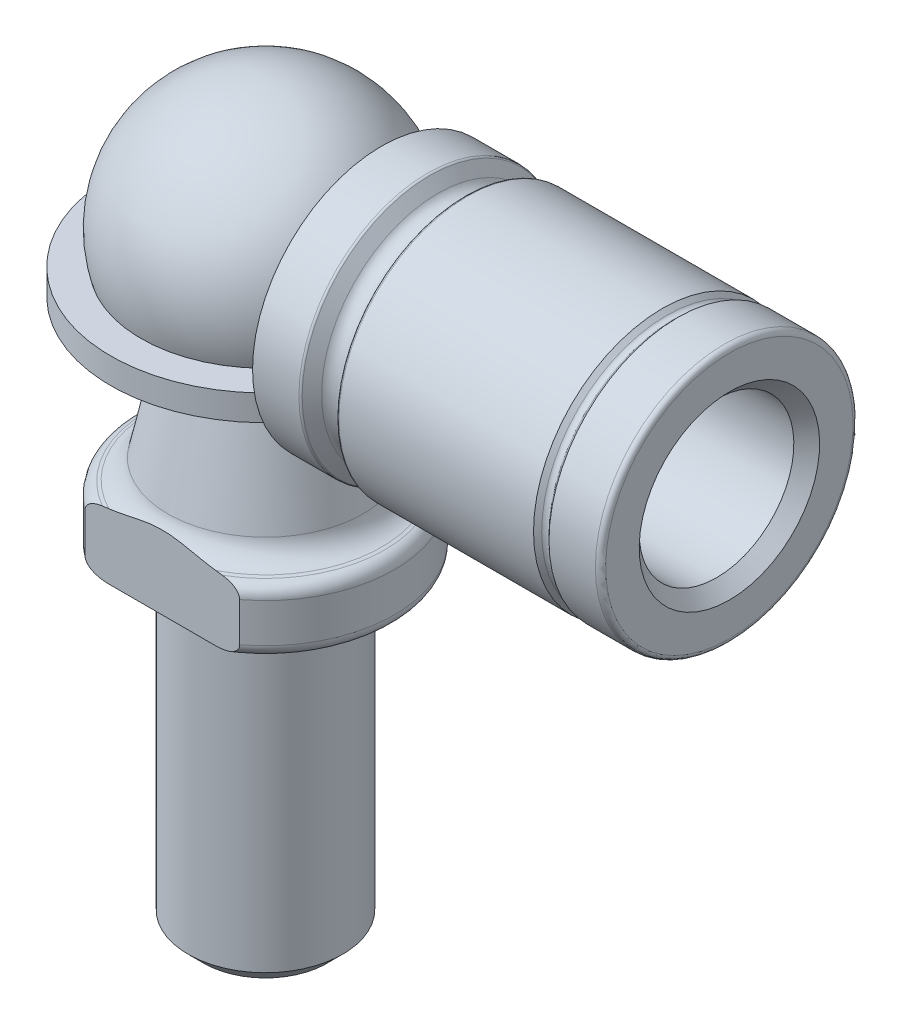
ISO-10303-21;
HEADER;
FILE_DESCRIPTION(('STEP AP214'),'2;1');
FILE_NAME('part.step','',(''),(''),'','','');
FILE_SCHEMA(('AUTOMOTIVE_DESIGN { 1 0 10303 214 1 1 1 1 }'));
ENDSEC;
DATA;
#1=APPLICATION_CONTEXT('core data for automotive mechanical design processes');
#2=APPLICATION_PROTOCOL_DEFINITION('international standard','automotive_design',2000,#1);
#3=PRODUCT_CONTEXT('',#1,'mechanical');
#4=PRODUCT('Part','Part','',(#3));
#5=PRODUCT_RELATED_PRODUCT_CATEGORY('part','',(#4));
#6=PRODUCT_DEFINITION_FORMATION('','',#4);
#7=PRODUCT_DEFINITION_CONTEXT('part definition',#1,'design');
#8=PRODUCT_DEFINITION('design','',#6,#7);
#9=PRODUCT_DEFINITION_SHAPE('','',#8);
#10=(LENGTH_UNIT() NAMED_UNIT(*) SI_UNIT(.MILLI.,.METRE.));
#11=(NAMED_UNIT(*) PLANE_ANGLE_UNIT() SI_UNIT($,.RADIAN.));
#12=(NAMED_UNIT(*) SI_UNIT($,.STERADIAN.) SOLID_ANGLE_UNIT());
#13=UNCERTAINTY_MEASURE_WITH_UNIT(LENGTH_MEASURE(1.E-05),#10,'distance_accuracy_value','');
#14=(GEOMETRIC_REPRESENTATION_CONTEXT(3) GLOBAL_UNCERTAINTY_ASSIGNED_CONTEXT((#13)) GLOBAL_UNIT_ASSIGNED_CONTEXT((#10,
#11,#12)) REPRESENTATION_CONTEXT('',''));
#15=CARTESIAN_POINT('',(0.,0.,0.));
#16=DIRECTION('',(0.,0.,1.));
#17=DIRECTION('',(1.,0.,0.));
#18=AXIS2_PLACEMENT_3D('',#15,#16,#17);
#19=CARTESIAN_POINT('',(-6.09888930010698,-2.1,0.));
#20=DIRECTION('',(0.,1.,0.));
#21=DIRECTION('',(-1.,0.,0.));
#22=AXIS2_PLACEMENT_3D('',#19,#20,#21);
#23=TOROIDAL_SURFACE('',#22,4.75709995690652,0.2);
#24=CARTESIAN_POINT('',(-6.09888930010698,-2.3,0.));
#25=DIRECTION('',(0.,1.,0.));
#26=DIRECTION('',(-1.,0.,0.));
#27=AXIS2_PLACEMENT_3D('',#24,#25,#26);
#28=CIRCLE('',#27,4.75709995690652);
#29=CARTESIAN_POINT('',(-10.8559892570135,-2.3,0.));
#30=VERTEX_POINT('',#29);
#31=EDGE_CURVE('E11',#30,#30,#28,.T.);
#32=ORIENTED_EDGE('',*,*,#31,.F.);
#33=EDGE_LOOP('',(#32));
#34=FACE_BOUND('',#33,.T.);
#35=CARTESIAN_POINT('',(-6.09888930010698,-2.01923076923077,0.));
#36=DIRECTION('',(0.,1.,0.));
#37=DIRECTION('',(-1.,0.,0.));
#38=AXIS2_PLACEMENT_3D('',#35,#36,#37);
#39=CIRCLE('',#38,4.57413457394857);
#40=CARTESIAN_POINT('',(-1.52475472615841,-2.01923076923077,0.));
#41=VERTEX_POINT('',#40);
#42=EDGE_CURVE('E63',#41,#41,#39,.T.);
#43=ORIENTED_EDGE('',*,*,#42,.T.);
#44=EDGE_LOOP('',(#43));
#45=FACE_BOUND('',#44,.T.);
#46=ADVANCED_FACE('F44',(#34,#45),#23,.T.);
#47=CARTESIAN_POINT('',(-0.0988893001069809,-2.3,0.));
#48=DIRECTION('',(0.,1.,0.));
#49=DIRECTION('',(-1.,0.,0.));
#50=AXIS2_PLACEMENT_3D('',#47,#48,#49);
#51=PLANE('',#50);
#52=CARTESIAN_POINT('',(-6.09888930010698,-2.3,0.));
#53=DIRECTION('',(0.,1.,0.));
#54=DIRECTION('',(-1.,0.,0.));
#55=AXIS2_PLACEMENT_3D('',#52,#53,#54);
#56=CIRCLE('',#55,6.);
#57=CARTESIAN_POINT('',(-12.098889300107,-2.3,0.));
#58=VERTEX_POINT('',#57);
#59=EDGE_CURVE('E50',#58,#58,#56,.T.);
#60=ORIENTED_EDGE('',*,*,#59,.F.);
#61=EDGE_LOOP('',(#60));
#62=FACE_BOUND('',#61,.T.);
#63=ORIENTED_EDGE('',*,*,#31,.T.);
#64=EDGE_LOOP('',(#63));
#65=FACE_BOUND('',#64,.T.);
#66=ADVANCED_FACE('F82',(#62,#65),#51,.F.);
#67=CARTESIAN_POINT('',(-6.09888930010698,-11.,0.));
#68=DIRECTION('',(0.,1.,0.));
#69=DIRECTION('',(-1.,0.,0.));
#70=AXIS2_PLACEMENT_3D('',#67,#68,#69);
#71=CYLINDRICAL_SURFACE('',#70,6.);
#72=CARTESIAN_POINT('',(-6.09888930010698,-1.3,0.));
#73=DIRECTION('',(0.,1.,0.));
#74=DIRECTION('',(-1.,0.,0.));
#75=AXIS2_PLACEMENT_3D('',#72,#73,#74);
#76=CIRCLE('',#75,6.);
#77=CARTESIAN_POINT('',(-12.098889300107,-1.3,0.));
#78=VERTEX_POINT('',#77);
#79=EDGE_CURVE('E54',#78,#78,#76,.T.);
#80=ORIENTED_EDGE('',*,*,#79,.F.);
#81=EDGE_LOOP('',(#80));
#82=FACE_BOUND('',#81,.T.);
#83=ORIENTED_EDGE('',*,*,#59,.T.);
#84=EDGE_LOOP('',(#83));
#85=FACE_BOUND('',#84,.T.);
#86=ADVANCED_FACE('F77',(#82,#85),#71,.T.);
#87=CARTESIAN_POINT('',(-0.0988893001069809,-1.3,0.));
#88=DIRECTION('',(0.,-1.,0.));
#89=DIRECTION('',(1.,0.,0.));
#90=AXIS2_PLACEMENT_3D('',#87,#88,#89);
#91=PLANE('',#90);
#92=CARTESIAN_POINT('',(-6.09888930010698,-1.3,0.));
#93=DIRECTION('',(0.,1.,0.));
#94=DIRECTION('',(-1.,0.,0.));
#95=AXIS2_PLACEMENT_3D('',#92,#93,#94);
#96=CIRCLE('',#95,4.82804308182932);
#97=CARTESIAN_POINT('',(-1.27084621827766,-1.3,0.));
#98=VERTEX_POINT('',#97);
#99=EDGE_CURVE('E58',#98,#98,#96,.T.);
#100=ORIENTED_EDGE('',*,*,#99,.F.);
#101=EDGE_LOOP('',(#100));
#102=FACE_BOUND('',#101,.T.);
#103=ORIENTED_EDGE('',*,*,#79,.T.);
#104=EDGE_LOOP('',(#103));
#105=FACE_BOUND('',#104,.T.);
#106=ADVANCED_FACE('F71',(#102,#105),#91,.F.);
#107=CARTESIAN_POINT('',(-6.09888930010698,0.,0.));
#108=DIRECTION('',(0.,1.,0.));
#109=DIRECTION('',(1.,0.,0.));
#110=AXIS2_PLACEMENT_3D('',#107,#108,#109);
#111=SPHERICAL_SURFACE('',#110,5.);
#112=CARTESIAN_POINT('',(-1.52475472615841,-2.01923076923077,0.));
#113=CARTESIAN_POINT('',(-1.52154299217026,-2.01195527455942,0.));
#114=CARTESIAN_POINT('',(-1.51834861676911,-2.0046721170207,0.));
#115=CARTESIAN_POINT('',(-1.51199465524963,-1.99009064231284,0.));
#116=CARTESIAN_POINT('',(-1.5088350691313,-1.9827923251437,0.));
#117=CARTESIAN_POINT('',(-1.50255075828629,-1.96818069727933,0.));
#118=CARTESIAN_POINT('',(-1.49942603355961,-1.96086738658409,0.));
#119=CARTESIAN_POINT('',(-1.4932115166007,-1.94622593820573,0.));
#120=CARTESIAN_POINT('',(-1.49012172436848,-1.9388978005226,0.));
#121=CARTESIAN_POINT('',(-1.48397714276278,-1.92422686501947,0.));
#122=CARTESIAN_POINT('',(-1.48092235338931,-1.91688406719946,0.));
#123=CARTESIAN_POINT('',(-1.47484784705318,-1.90218397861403,0.));
#124=CARTESIAN_POINT('',(-1.47182813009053,-1.8948266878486,0.));
#125=CARTESIAN_POINT('',(-1.46582383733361,-1.88009778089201,0.));
#126=CARTESIAN_POINT('',(-1.46283926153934,-1.87272616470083,0.));
#127=CARTESIAN_POINT('',(-1.45690531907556,-1.85796877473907,0.));
#128=CARTESIAN_POINT('',(-1.45395595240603,-1.85058300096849,0.));
#129=CARTESIAN_POINT('',(-1.44809249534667,-1.83579746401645,0.));
#130=CARTESIAN_POINT('',(-1.44517840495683,-1.82839770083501,0.));
#131=CARTESIAN_POINT('',(-1.43938556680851,-1.81358435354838,0.));
#132=CARTESIAN_POINT('',(-1.43650681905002,-1.8061707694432,0.));
#133=CARTESIAN_POINT('',(-1.43078473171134,-1.7913299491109,0.));
#134=CARTESIAN_POINT('',(-1.42794139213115,-1.78390271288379,0.));
#135=CARTESIAN_POINT('',(-1.4222901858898,-1.76903475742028,0.));
#136=CARTESIAN_POINT('',(-1.41948231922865,-1.76159403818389,0.));
#137=CARTESIAN_POINT('',(-1.4139021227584,-1.74669928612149,0.));
#138=CARTESIAN_POINT('',(-1.41112979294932,-1.73924525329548,0.));
#139=CARTESIAN_POINT('',(-1.40562073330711,-1.72432404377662,0.));
#140=CARTESIAN_POINT('',(-1.40288400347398,-1.71685686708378,0.));
#141=CARTESIAN_POINT('',(-1.397446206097,-1.70190953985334,0.));
#142=CARTESIAN_POINT('',(-1.39474513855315,-1.69442938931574,0.));
#143=CARTESIAN_POINT('',(-1.38937872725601,-1.67945628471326,0.));
#144=CARTESIAN_POINT('',(-1.38671338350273,-1.67196333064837,0.));
#145=CARTESIAN_POINT('',(-1.38141848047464,-1.65696478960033,0.));
#146=CARTESIAN_POINT('',(-1.37878892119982,-1.64945920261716,0.));
#147=CARTESIAN_POINT('',(-1.37356564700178,-1.63443556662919,0.));
#148=CARTESIAN_POINT('',(-1.37097193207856,-1.62691751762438,0.));
#149=CARTESIAN_POINT('',(-1.36582040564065,-1.61186912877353,0.));
#150=CARTESIAN_POINT('',(-1.36326259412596,-1.60433878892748,0.));
#151=CARTESIAN_POINT('',(-1.35818293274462,-1.58926598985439,0.));
#152=CARTESIAN_POINT('',(-1.35566108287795,-1.58172353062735,0.));
#153=CARTESIAN_POINT('',(-1.35065340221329,-1.56662666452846,0.));
#154=CARTESIAN_POINT('',(-1.34816757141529,-1.55907225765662,0.));
#155=CARTESIAN_POINT('',(-1.34323198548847,-1.54395166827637,0.));
#156=CARTESIAN_POINT('',(-1.34078223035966,-1.53638548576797,0.));
#157=CARTESIAN_POINT('',(-1.33591885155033,-1.52124151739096,0.));
#158=CARTESIAN_POINT('',(-1.33350522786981,-1.51366373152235,0.));
#159=CARTESIAN_POINT('',(-1.32871416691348,-1.49849672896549,0.));
#160=CARTESIAN_POINT('',(-1.32633672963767,-1.49090751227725,0.));
#161=CARTESIAN_POINT('',(-1.32161809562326,-1.47571782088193,0.));
#162=CARTESIAN_POINT('',(-1.31927689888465,-1.46811734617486,0.));
#163=CARTESIAN_POINT('',(-1.31463079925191,-1.45290531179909,0.));
#164=CARTESIAN_POINT('',(-1.31232589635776,-1.44529375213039,0.));
#165=CARTESIAN_POINT('',(-1.30775243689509,-1.43005972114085,0.));
#166=CARTESIAN_POINT('',(-1.30548388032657,-1.42243724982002,0.));
#167=CARTESIAN_POINT('',(-1.30098316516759,-1.40718156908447,0.));
#168=CARTESIAN_POINT('',(-1.29875100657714,-1.39954835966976,0.));
#169=CARTESIAN_POINT('',(-1.29432313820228,-1.38427137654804,0.));
#170=CARTESIAN_POINT('',(-1.29212742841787,-1.37662760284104,0.));
#171=CARTESIAN_POINT('',(-1.28777250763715,-1.36132966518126,0.));
#172=CARTESIAN_POINT('',(-1.28561329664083,-1.35367550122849,0.));
#173=CARTESIAN_POINT('',(-1.28133142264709,-1.33835695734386,0.));
#174=CARTESIAN_POINT('',(-1.27920875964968,-1.330692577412,0.));
#175=CARTESIAN_POINT('',(-1.27500002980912,-1.31535377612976,0.));
#176=CARTESIAN_POINT('',(-1.27291396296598,-1.30767935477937,0.));
#177=CARTESIAN_POINT('',(-1.27084621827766,-1.3,0.));
#178=B_SPLINE_CURVE_WITH_KNOTS('',3,(#112,#113,#114,#115,#116,#117,#118,#119,#120,#121,#122,
#123,#124,#125,#126,#127,#128,#129,#130,#131,#132,#133,#134,#135,#136,#137,#138,#139,#140,#141,
#142,#143,#144,#145,#146,#147,#148,#149,#150,#151,#152,#153,#154,#155,#156,#157,#158,#159,#160,
#161,#162,#163,#164,#165,#166,#167,#168,#169,#170,#171,#172,#173,#174,#175,#176,#177),
.UNSPECIFIED.,.F.,.F.,(4,2,2,2,2,2,2,2,2,2,2,2,2,2,2,2,2,2,2,2,2,2,2,2,2,2,2,2,2,2,2,2,4),(0.,
0.0238585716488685,0.0477171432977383,0.0715757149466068,0.0954342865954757,0.119292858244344,
0.143151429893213,0.167010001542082,0.190868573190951,0.21472714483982,0.238585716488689,
0.262444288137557,0.286302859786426,0.310161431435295,0.334020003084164,0.357878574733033,
0.381737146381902,0.405595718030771,0.42945428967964,0.453312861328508,0.477171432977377,
0.501030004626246,0.524888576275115,0.548747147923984,0.572605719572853,0.596464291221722,
0.62032286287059,0.644181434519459,0.668040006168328,0.691898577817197,0.715757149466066,
0.739615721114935,0.763474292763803),.UNSPECIFIED.);
#179=EDGE_CURVE('BSEAM68',#41,#98,#178,.T.);
#180=ORIENTED_EDGE('',*,*,#42,.F.);
#181=ORIENTED_EDGE('',*,*,#99,.T.);
#182=ORIENTED_EDGE('',*,*,#179,.T.);
#183=ORIENTED_EDGE('',*,*,#179,.F.);
#184=EDGE_LOOP('',(#180,#182,#181,#183));
#185=FACE_BOUND('',#184,.T.);
#186=ADVANCED_FACE('F68',(#185),#111,.F.);
#187=CLOSED_SHELL('',(#46,#66,#86,#106,#186));
#188=MANIFOLD_SOLID_BREP('B2',#187);
#189=CARTESIAN_POINT('',(-6.09888930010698,-8.46815374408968,0.));
#190=DIRECTION('',(0.,-1.,0.));
#191=DIRECTION('',(1.,0.,0.));
#192=AXIS2_PLACEMENT_3D('',#189,#190,#191);
#193=CONICAL_SURFACE('',#192,4.50794307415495,1.30899693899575);
#194=CARTESIAN_POINT('',(-16.2838245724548,-10.1922219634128,-4.));
#195=CARTESIAN_POINT('',(-16.0669449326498,-10.1381338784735,-4.));
#196=CARTESIAN_POINT('',(-15.8500122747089,-10.0842578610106,-4.));
#197=CARTESIAN_POINT('',(-15.41601802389,-9.9770237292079,-4.));
#198=CARTESIAN_POINT('',(-15.1989564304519,-9.92366561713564,-4.));
#199=CARTESIAN_POINT('',(-14.547511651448,-9.7645009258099,-4.));
#200=CARTESIAN_POINT('',(-14.1129035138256,-9.65961276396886,-4.));
#201=CARTESIAN_POINT('',(-13.2355324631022,-9.45168998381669,-4.));
#202=CARTESIAN_POINT('',(-12.7927550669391,-9.34871598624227,-4.));
#203=CARTESIAN_POINT('',(-12.1276023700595,-9.19860856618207,-4.));
#204=CARTESIAN_POINT('',(-11.9057190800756,-9.14929808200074,-4.));
#205=CARTESIAN_POINT('',(-11.4615478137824,-9.05253808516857,-4.));
#206=CARTESIAN_POINT('',(-11.2392598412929,-9.00508855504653,-4.));
#207=CARTESIAN_POINT('',(-10.8022446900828,-8.91424612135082,-4.));
#208=CARTESIAN_POINT('',(-10.5875351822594,-8.8707685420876,-4.));
#209=CARTESIAN_POINT('',(-10.1575569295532,-8.78665184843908,-4.));
#210=CARTESIAN_POINT('',(-9.94228818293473,-8.74601274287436,-4.));
#211=CARTESIAN_POINT('',(-9.51103563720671,-8.66838303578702,-4.));
#212=CARTESIAN_POINT('',(-9.29505168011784,-8.63139330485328,-4.));
#213=CARTESIAN_POINT('',(-8.86231937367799,-8.56212442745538,-4.));
#214=CARTESIAN_POINT('',(-8.64557101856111,-8.52984531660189,-4.));
#215=CARTESIAN_POINT('',(-8.21315301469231,-8.47153672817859,-4.));
#216=CARTESIAN_POINT('',(-7.99749051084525,-8.44545506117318,-4.));
#217=CARTESIAN_POINT('',(-7.56541324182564,-8.40056902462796,-4.));
#218=CARTESIAN_POINT('',(-7.34899854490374,-8.3817640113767,-4.));
#219=CARTESIAN_POINT('',(-6.91575468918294,-8.35273065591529,-4.));
#220=CARTESIAN_POINT('',(-6.69892600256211,-8.34249544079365,-4.));
#221=CARTESIAN_POINT('',(-6.26502864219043,-8.33141455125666,-4.));
#222=CARTESIAN_POINT('',(-6.04795997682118,-8.33056855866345,-4.));
#223=CARTESIAN_POINT('',(-5.62476549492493,-8.33814303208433,-4.));
#224=CARTESIAN_POINT('',(-5.41863112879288,-8.34610579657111,-4.));
#225=CARTESIAN_POINT('',(-5.00682535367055,-8.36996961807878,-4.));
#226=CARTESIAN_POINT('',(-4.80115396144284,-8.38587095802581,-4.));
#227=CARTESIAN_POINT('',(-4.39030173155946,-8.42459144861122,-4.));
#228=CARTESIAN_POINT('',(-4.18512145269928,-8.4474164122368,-4.));
#229=CARTESIAN_POINT('',(-3.77548794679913,-8.4987882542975,-4.));
#230=CARTESIAN_POINT('',(-3.57103472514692,-8.52733517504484,-4.));
#231=CARTESIAN_POINT('',(-3.16107133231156,-8.58928911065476,-4.));
#232=CARTESIAN_POINT('',(-2.95556723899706,-8.62273589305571,-4.));
#233=CARTESIAN_POINT('',(-2.54519987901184,-8.69331787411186,-4.));
#234=CARTESIAN_POINT('',(-2.34033660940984,-8.73045305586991,-4.));
#235=CARTESIAN_POINT('',(-1.93123168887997,-8.80760562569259,-4.));
#236=CARTESIAN_POINT('',(-1.72698984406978,-8.84762199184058,-4.));
#237=CARTESIAN_POINT('',(-1.31896566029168,-8.92993902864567,-4.));
#238=CARTESIAN_POINT('',(-1.11518332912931,-8.97223973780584,-4.));
#239=CARTESIAN_POINT('',(-0.489885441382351,-9.10490649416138,-4.));
#240=CARTESIAN_POINT('',(-0.0689956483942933,-9.19821599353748,-4.));
#241=CARTESIAN_POINT('',(0.771701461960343,-9.38967343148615,-4.));
#242=CARTESIAN_POINT('',(1.19150869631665,-9.48782173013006,-4.));
#243=CARTESIAN_POINT('',(2.02408819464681,-9.68584710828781,-4.));
#244=CARTESIAN_POINT('',(2.43687184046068,-9.7856764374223,-4.));
#245=CARTESIAN_POINT('',(3.05561971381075,-9.93703882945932,-4.));
#246=CARTESIAN_POINT('',(3.26178367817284,-9.98775917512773,-4.));
#247=CARTESIAN_POINT('',(3.67399639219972,-10.0896628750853,-4.));
#248=CARTESIAN_POINT('',(3.88004514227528,-10.1408462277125,-4.));
#249=CARTESIAN_POINT('',(4.08604597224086,-10.1922219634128,-4.));
#250=B_SPLINE_CURVE_WITH_KNOTS('',3,(#194,#195,#196,#197,#198,#199,#200,#201,#202,#203,#204,
#205,#206,#207,#208,#209,#210,#211,#212,#213,#214,#215,#216,#217,#218,#219,#220,#221,#222,#223,
#224,#225,#226,#227,#228,#229,#230,#231,#232,#233,#234,#235,#236,#237,#238,#239,#240,#241,#242,
#243,#244,#245,#246,#247,#248,#249),.UNSPECIFIED.,.F.,.F.,(4,2,2,2,2,2,2,2,2,2,2,2,2,2,2,2,2,2,
2,2,2,2,2,2,2,2,2,4),(0.,0.670567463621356,1.34113786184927,2.68238704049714,4.04613865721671,
4.72802238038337,5.40989970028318,6.06708694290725,6.72427622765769,7.38162191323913,
8.03897256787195,8.6905741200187,9.34211801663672,9.99313887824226,10.6441376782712,
11.2628351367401,11.8815546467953,12.5007950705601,13.1200400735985,13.7446222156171,
14.369201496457,14.9935603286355,15.617929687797,16.9112022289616,18.2045711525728,
19.4786128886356,20.1155467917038,20.7524784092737),.UNSPECIFIED.);
#251=CARTESIAN_POINT('',(-8.42943269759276,-8.50070058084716,-4.));
#252=VERTEX_POINT('',#251);
#253=CARTESIAN_POINT('',(-8.17772329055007,-8.46815374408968,-4.));
#254=VERTEX_POINT('',#253);
#255=EDGE_CURVE('E335',#252,#254,#250,.T.);
#256=ORIENTED_EDGE('',*,*,#255,.F.);
#257=CARTESIAN_POINT('',(-6.09888930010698,-8.50070058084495,0.));
#258=DIRECTION('',(0.,1.,0.));
#259=DIRECTION('',(-1.,0.,0.));
#260=AXIS2_PLACEMENT_3D('',#257,#258,#259);
#261=CIRCLE('',#260,4.62940952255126);
#262=CARTESIAN_POINT('',(-8.42943269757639,-8.50070058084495,4.));
#263=VERTEX_POINT('',#262);
#264=EDGE_CURVE('E234',#252,#263,#261,.T.);
#265=ORIENTED_EDGE('',*,*,#264,.T.);
#266=CARTESIAN_POINT('',(4.08604597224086,-10.1922219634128,4.));
#267=CARTESIAN_POINT('',(3.86916633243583,-10.1381338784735,4.));
#268=CARTESIAN_POINT('',(3.65223367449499,-10.0842578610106,4.));
#269=CARTESIAN_POINT('',(3.21823942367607,-9.9770237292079,4.));
#270=CARTESIAN_POINT('',(3.0011778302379,-9.92366561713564,4.));
#271=CARTESIAN_POINT('',(2.34973305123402,-9.7645009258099,4.));
#272=CARTESIAN_POINT('',(1.91512491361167,-9.65961276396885,4.));
#273=CARTESIAN_POINT('',(1.03775386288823,-9.45168998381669,4.));
#274=CARTESIAN_POINT('',(0.594976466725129,-9.34871598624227,4.));
#275=CARTESIAN_POINT('',(-0.0701762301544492,-9.19860856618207,4.));
#276=CARTESIAN_POINT('',(-0.292059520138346,-9.14929808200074,4.));
#277=CARTESIAN_POINT('',(-0.73623078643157,-9.05253808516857,4.));
#278=CARTESIAN_POINT('',(-0.958518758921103,-9.00508855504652,4.));
#279=CARTESIAN_POINT('',(-1.39553391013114,-8.91424612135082,4.));
#280=CARTESIAN_POINT('',(-1.61024341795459,-8.8707685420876,4.));
#281=CARTESIAN_POINT('',(-2.04022167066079,-8.78665184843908,4.));
#282=CARTESIAN_POINT('',(-2.25549041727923,-8.74601274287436,4.));
#283=CARTESIAN_POINT('',(-2.68674296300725,-8.66838303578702,4.));
#284=CARTESIAN_POINT('',(-2.90272692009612,-8.63139330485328,4.));
#285=CARTESIAN_POINT('',(-3.33545922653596,-8.56212442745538,4.));
#286=CARTESIAN_POINT('',(-3.55220758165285,-8.52984531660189,4.));
#287=CARTESIAN_POINT('',(-3.98462558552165,-8.47153672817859,4.));
#288=CARTESIAN_POINT('',(-4.2002880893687,-8.44545506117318,4.));
#289=CARTESIAN_POINT('',(-4.63236535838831,-8.40056902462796,4.));
#290=CARTESIAN_POINT('',(-4.84878005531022,-8.3817640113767,4.));
#291=CARTESIAN_POINT('',(-5.28202391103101,-8.35273065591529,4.));
#292=CARTESIAN_POINT('',(-5.49885259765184,-8.34249544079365,4.));
#293=CARTESIAN_POINT('',(-5.93274995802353,-8.33141455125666,4.));
#294=CARTESIAN_POINT('',(-6.14981862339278,-8.33056855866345,4.));
#295=CARTESIAN_POINT('',(-6.57301310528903,-8.33814303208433,4.));
#296=CARTESIAN_POINT('',(-6.77914747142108,-8.34610579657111,4.));
#297=CARTESIAN_POINT('',(-7.19095324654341,-8.36996961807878,4.));
#298=CARTESIAN_POINT('',(-7.39662463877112,-8.38587095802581,4.));
#299=CARTESIAN_POINT('',(-7.8074768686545,-8.42459144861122,4.));
#300=CARTESIAN_POINT('',(-8.01265714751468,-8.4474164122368,4.));
#301=CARTESIAN_POINT('',(-8.42229065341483,-8.4987882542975,4.));
#302=CARTESIAN_POINT('',(-8.62674387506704,-8.52733517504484,4.));
#303=CARTESIAN_POINT('',(-9.0367072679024,-8.58928911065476,4.));
#304=CARTESIAN_POINT('',(-9.24221136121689,-8.62273589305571,4.));
#305=CARTESIAN_POINT('',(-9.65257872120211,-8.69331787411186,4.));
#306=CARTESIAN_POINT('',(-9.85744199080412,-8.73045305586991,4.));
#307=CARTESIAN_POINT('',(-10.266546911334,-8.80760562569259,4.));
#308=CARTESIAN_POINT('',(-10.4707887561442,-8.84762199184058,4.));
#309=CARTESIAN_POINT('',(-10.8788129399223,-8.92993902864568,4.));
#310=CARTESIAN_POINT('',(-11.0825952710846,-8.97223973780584,4.));
#311=CARTESIAN_POINT('',(-11.7078931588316,-9.10490649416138,4.));
#312=CARTESIAN_POINT('',(-12.1287829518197,-9.19821599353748,4.));
#313=CARTESIAN_POINT('',(-12.9694800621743,-9.38967343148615,4.));
#314=CARTESIAN_POINT('',(-13.3892872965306,-9.48782173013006,4.));
#315=CARTESIAN_POINT('',(-14.2218667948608,-9.68584710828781,4.));
#316=CARTESIAN_POINT('',(-14.6346504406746,-9.7856764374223,4.));
#317=CARTESIAN_POINT('',(-15.2533983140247,-9.93703882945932,4.));
#318=CARTESIAN_POINT('',(-15.4595622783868,-9.98775917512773,4.));
#319=CARTESIAN_POINT('',(-15.8717749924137,-10.0896628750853,4.));
#320=CARTESIAN_POINT('',(-16.0778237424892,-10.1408462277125,4.));
#321=CARTESIAN_POINT('',(-16.2838245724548,-10.1922219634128,4.));
#322=B_SPLINE_CURVE_WITH_KNOTS('',3,(#266,#267,#268,#269,#270,#271,#272,#273,#274,#275,#276,
#277,#278,#279,#280,#281,#282,#283,#284,#285,#286,#287,#288,#289,#290,#291,#292,#293,#294,#295,
#296,#297,#298,#299,#300,#301,#302,#303,#304,#305,#306,#307,#308,#309,#310,#311,#312,#313,#314,
#315,#316,#317,#318,#319,#320,#321),.UNSPECIFIED.,.F.,.F.,(4,2,2,2,2,2,2,2,2,2,2,2,2,2,2,2,2,2,
2,2,2,2,2,2,2,2,2,4),(0.,0.670567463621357,1.34113786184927,2.68238704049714,4.04613865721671,
4.72802238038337,5.40989970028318,6.06708694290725,6.72427622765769,7.38162191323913,
8.03897256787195,8.6905741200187,9.34211801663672,9.99313887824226,10.6441376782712,
11.2628351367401,11.8815546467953,12.5007950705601,13.1200400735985,13.7446222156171,
14.369201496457,14.9935603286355,15.617929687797,16.9112022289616,18.2045711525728,
19.4786128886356,20.1155467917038,20.7524784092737),.UNSPECIFIED.);
#323=CARTESIAN_POINT('',(-8.17772329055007,-8.46815374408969,4.));
#324=VERTEX_POINT('',#323);
#325=EDGE_CURVE('E315',#324,#263,#322,.T.);
#326=ORIENTED_EDGE('',*,*,#325,.F.);
#327=CARTESIAN_POINT('',(-6.09888930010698,-8.46815374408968,0.));
#328=DIRECTION('',(0.,1.,0.));
#329=DIRECTION('',(-1.,0.,0.));
#330=AXIS2_PLACEMENT_3D('',#327,#328,#329);
#331=CIRCLE('',#330,4.50794307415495);
#332=EDGE_CURVE('E238',#254,#324,#331,.T.);
#333=ORIENTED_EDGE('',*,*,#332,.F.);
#334=EDGE_LOOP('',(#256,#265,#326,#333));
#335=FACE_BOUND('',#334,.T.);
#336=ADVANCED_FACE('F130',(#335),#193,.T.);
#337=CARTESIAN_POINT('',(-6.09888930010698,-8.98366349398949,0.));
#338=DIRECTION('',(0.,1.,0.));
#339=DIRECTION('',(-1.,0.,0.));
#340=AXIS2_PLACEMENT_3D('',#337,#338,#339);
#341=TOROIDAL_SURFACE('',#340,4.5,0.500000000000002);
#342=CARTESIAN_POINT('',(-6.09888930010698,-8.98366349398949,-4.));
#343=CARTESIAN_POINT('',(-6.09888930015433,-8.98366269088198,-4.));
#344=CARTESIAN_POINT('',(-6.09888909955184,-8.98366188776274,-4.));
#345=CARTESIAN_POINT('',(-6.09888848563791,-8.98366035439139,-4.));
#346=CARTESIAN_POINT('',(-6.09888806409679,-8.98365962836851,-4.));
#347=CARTESIAN_POINT('',(-6.09888705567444,-8.98365816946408,-4.));
#348=CARTESIAN_POINT('',(-6.09888645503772,-8.98365744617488,-4.));
#349=CARTESIAN_POINT('',(-6.09888517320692,-8.98365609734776,-4.));
#350=CARTESIAN_POINT('',(-6.09888449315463,-8.98365547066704,-4.));
#351=CARTESIAN_POINT('',(-6.09888200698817,-8.98365331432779,-4.));
#352=CARTESIAN_POINT('',(-6.09888009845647,-8.98365190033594,-4.));
#353=CARTESIAN_POINT('',(-6.09887619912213,-8.98364943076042,-4.));
#354=CARTESIAN_POINT('',(-6.098874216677,-8.98364836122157,-4.));
#355=CARTESIAN_POINT('',(-6.09886630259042,-8.98364421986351,-4.));
#356=CARTESIAN_POINT('',(-6.09886026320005,-8.98364134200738,-4.));
#357=CARTESIAN_POINT('',(-6.09884849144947,-8.98363675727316,-4.));
#358=CARTESIAN_POINT('',(-6.09884279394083,-8.98363495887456,-4.));
#359=CARTESIAN_POINT('',(-6.09881804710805,-8.98362711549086,-4.));
#360=CARTESIAN_POINT('',(-6.09879903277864,-8.98362100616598,-4.));
#361=CARTESIAN_POINT('',(-6.0987637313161,-8.9836114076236,-4.));
#362=CARTESIAN_POINT('',(-6.09874752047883,-8.98360765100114,-4.));
#363=CARTESIAN_POINT('',(-6.09862772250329,-8.98357737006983,-4.));
#364=CARTESIAN_POINT('',(-6.09852789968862,-8.98353803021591,-4.));
#365=CARTESIAN_POINT('',(-6.09813676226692,-8.98338944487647,-4.));
#366=CARTESIAN_POINT('',(-6.09784283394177,-8.98328976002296,-4.));
#367=CARTESIAN_POINT('',(-6.09669121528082,-8.98289351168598,-4.));
#368=CARTESIAN_POINT('',(-6.09583619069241,-8.98258693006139,-4.));
#369=CARTESIAN_POINT('',(-6.09231055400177,-8.98132856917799,-4.));
#370=CARTESIAN_POINT('',(-6.0896370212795,-8.98038806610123,-4.));
#371=CARTESIAN_POINT('',(-6.04362792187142,-8.96419531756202,-4.00000000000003));
#372=CARTESIAN_POINT('',(-6.00031916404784,-8.94883790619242,-4.00000000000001));
#373=CARTESIAN_POINT('',(-5.91531430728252,-8.91887599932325,-3.99999999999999));
#374=CARTESIAN_POINT('',(-5.8736202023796,-8.90426525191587,-4.));
#375=CARTESIAN_POINT('',(-5.78511281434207,-8.87345439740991,-4.));
#376=CARTESIAN_POINT('',(-5.73829167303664,-8.85727633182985,-4.));
#377=CARTESIAN_POINT('',(-5.6440295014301,-8.82511523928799,-4.));
#378=CARTESIAN_POINT('',(-5.59658715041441,-8.80913608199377,-4.));
#379=CARTESIAN_POINT('',(-5.51448225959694,-8.78196357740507,-4.));
#380=CARTESIAN_POINT('',(-5.47985884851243,-8.77065227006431,-4.));
#381=CARTESIAN_POINT('',(-5.41059519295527,-8.74837873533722,-4.));
#382=CARTESIAN_POINT('',(-5.37595520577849,-8.73741570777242,-4.));
#383=CARTESIAN_POINT('',(-5.2734683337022,-8.70558975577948,-4.));
#384=CARTESIAN_POINT('',(-5.20545586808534,-8.6852557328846,-4.));
#385=CARTESIAN_POINT('',(-5.0543206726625,-8.64234055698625,-4.));
#386=CARTESIAN_POINT('',(-4.97106945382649,-8.62020530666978,-4.));
#387=CARTESIAN_POINT('',(-4.80300798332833,-8.57950853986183,-4.));
#388=CARTESIAN_POINT('',(-4.71819066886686,-8.56097577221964,-4.));
#389=CARTESIAN_POINT('',(-4.54142778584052,-8.52772416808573,-4.));
#390=CARTESIAN_POINT('',(-4.44940961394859,-8.51337720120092,-4.));
#391=CARTESIAN_POINT('',(-4.26473989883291,-8.49234107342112,-4.));
#392=CARTESIAN_POINT('',(-4.17209106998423,-8.4856291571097,-4.));
#393=CARTESIAN_POINT('',(-3.98832485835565,-8.48245671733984,-4.));
#394=CARTESIAN_POINT('',(-3.89721458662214,-8.48579076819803,-4.));
#395=CARTESIAN_POINT('',(-3.76245186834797,-8.50093617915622,-4.));
#396=CARTESIAN_POINT('',(-3.71821881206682,-8.50757654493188,-4.));
#397=CARTESIAN_POINT('',(-3.6305518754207,-8.52482028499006,-4.));
#398=CARTESIAN_POINT('',(-3.58711706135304,-8.53541867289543,-4.));
#399=CARTESIAN_POINT('',(-3.51272382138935,-8.55806000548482,-4.));
#400=CARTESIAN_POINT('',(-3.48143935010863,-8.5690236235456,-4.));
#401=CARTESIAN_POINT('',(-3.42000471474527,-8.59408175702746,-4.));
#402=CARTESIAN_POINT('',(-3.38985852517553,-8.60818623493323,-4.));
#403=CARTESIAN_POINT('',(-3.33126959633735,-8.64016465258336,-4.));
#404=CARTESIAN_POINT('',(-3.30284334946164,-8.65806935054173,-4.));
#405=CARTESIAN_POINT('',(-3.24918916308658,-8.69815304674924,-4.));
#406=CARTESIAN_POINT('',(-3.22395153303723,-8.72031855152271,-4.));
#407=CARTESIAN_POINT('',(-3.18702598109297,-8.76016398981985,-4.));
#408=CARTESIAN_POINT('',(-3.173802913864,-8.77641587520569,-4.));
#409=CARTESIAN_POINT('',(-3.14995919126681,-8.81075333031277,-4.));
#410=CARTESIAN_POINT('',(-3.13933755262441,-8.82883820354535,-4.));
#411=CARTESIAN_POINT('',(-3.12132817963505,-8.86683390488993,-4.));
#412=CARTESIAN_POINT('',(-3.11397815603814,-8.88676298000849,-4.));
#413=CARTESIAN_POINT('',(-3.1034119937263,-8.92768806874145,-4.));
#414=CARTESIAN_POINT('',(-3.1001898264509,-8.94868247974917,-4.));
#415=CARTESIAN_POINT('',(-3.09837415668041,-8.98780223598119,-4.));
#416=CARTESIAN_POINT('',(-3.09917630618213,-9.00590136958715,-4.));
#417=CARTESIAN_POINT('',(-3.10397823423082,-9.04166825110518,-4.));
#418=CARTESIAN_POINT('',(-3.10797846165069,-9.05933593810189,-4.));
#419=CARTESIAN_POINT('',(-3.11859476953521,-9.09293281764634,-4.));
#420=CARTESIAN_POINT('',(-3.12507843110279,-9.10890470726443,-4.));
#421=CARTESIAN_POINT('',(-3.14025712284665,-9.13974756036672,-4.));
#422=CARTESIAN_POINT('',(-3.14895274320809,-9.15461822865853,-4.));
#423=CARTESIAN_POINT('',(-3.17337143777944,-9.19088317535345,-4.));
#424=CARTESIAN_POINT('',(-3.19034645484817,-9.21143489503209,-4.));
#425=CARTESIAN_POINT('',(-3.22733732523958,-9.24960507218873,-4.));
#426=CARTESIAN_POINT('',(-3.24736209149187,-9.26721460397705,-4.));
#427=CARTESIAN_POINT('',(-3.30147837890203,-9.30894177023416,-4.));
#428=CARTESIAN_POINT('',(-3.33709512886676,-9.33106819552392,-4.));
#429=CARTESIAN_POINT('',(-3.41113278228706,-9.3697006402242,-4.));
#430=CARTESIAN_POINT('',(-3.44955441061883,-9.38620520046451,-4.));
#431=CARTESIAN_POINT('',(-3.52365838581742,-9.41304536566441,-4.));
#432=CARTESIAN_POINT('',(-3.55917039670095,-9.42386280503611,-4.));
#433=CARTESIAN_POINT('',(-3.63100059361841,-9.44243166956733,-4.));
#434=CARTESIAN_POINT('',(-3.66731944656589,-9.45018045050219,-4.));
#435=CARTESIAN_POINT('',(-3.77781497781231,-9.46965737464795,-4.));
#436=CARTESIAN_POINT('',(-3.8527044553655,-9.47734479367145,-4.));
#437=CARTESIAN_POINT('',(-4.00637276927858,-9.48489157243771,-4.));
#438=CARTESIAN_POINT('',(-4.08516508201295,-9.48435574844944,-4.));
#439=CARTESIAN_POINT('',(-4.24258678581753,-9.47655558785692,-4.));
#440=CARTESIAN_POINT('',(-4.32121520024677,-9.46927352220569,-4.));
#441=CARTESIAN_POINT('',(-4.47359387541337,-9.44998579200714,-4.));
#442=CARTESIAN_POINT('',(-4.54738038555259,-9.43825318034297,-4.));
#443=CARTESIAN_POINT('',(-4.69378169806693,-9.41113628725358,-4.));
#444=CARTESIAN_POINT('',(-4.7664009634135,-9.39577563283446,-4.));
#445=CARTESIAN_POINT('',(-4.92963823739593,-9.35778317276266,-4.));
#446=CARTESIAN_POINT('',(-5.02005583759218,-9.33429822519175,-4.));
#447=CARTESIAN_POINT('',(-5.15598373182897,-9.29624971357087,-4.));
#448=CARTESIAN_POINT('',(-5.20185249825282,-9.28293302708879,-4.));
#449=CARTESIAN_POINT('',(-5.29348383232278,-9.25552153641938,-4.));
#450=CARTESIAN_POINT('',(-5.33924583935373,-9.24142485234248,-4.));
#451=CARTESIAN_POINT('',(-5.44713513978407,-9.20740009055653,-4.));
#452=CARTESIAN_POINT('',(-5.50917974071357,-9.18721096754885,-4.));
#453=CARTESIAN_POINT('',(-5.63234097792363,-9.14622694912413,-4.));
#454=CARTESIAN_POINT('',(-5.69346049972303,-9.12544068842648,-4.));
#455=CARTESIAN_POINT('',(-5.80891274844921,-9.08565798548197,-4.));
#456=CARTESIAN_POINT('',(-5.86326306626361,-9.06671173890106,-3.99999999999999));
#457=CARTESIAN_POINT('',(-5.97405437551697,-9.02776550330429,-4.00000000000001));
#458=CARTESIAN_POINT('',(-6.03049151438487,-9.00775378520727,-4.00000000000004));
#459=CARTESIAN_POINT('',(-6.08963811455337,-8.98693859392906,-4.));
#460=CARTESIAN_POINT('',(-6.09231271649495,-8.98599767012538,-4.));
#461=CARTESIAN_POINT('',(-6.09583860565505,-8.98473920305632,-4.));
#462=CARTESIAN_POINT('',(-6.09669280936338,-8.98443291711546,-4.));
#463=CARTESIAN_POINT('',(-6.09784339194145,-8.98403702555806,-4.));
#464=CARTESIAN_POINT('',(-6.09813710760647,-8.98393741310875,-4.));
#465=CARTESIAN_POINT('',(-6.09852799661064,-8.98378892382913,-4.));
#466=CARTESIAN_POINT('',(-6.09862778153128,-8.98374959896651,-4.));
#467=CARTESIAN_POINT('',(-6.09874753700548,-8.98371932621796,-4.));
#468=CARTESIAN_POINT('',(-6.09876374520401,-8.98371556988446,-4.));
#469=CARTESIAN_POINT('',(-6.09879904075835,-8.98370597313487,-4.));
#470=CARTESIAN_POINT('',(-6.09881805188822,-8.9836998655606,-4.));
#471=CARTESIAN_POINT('',(-6.0988427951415,-8.98369202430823,-4.));
#472=CARTESIAN_POINT('',(-6.09884849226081,-8.98369022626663,-4.));
#473=CARTESIAN_POINT('',(-6.09886026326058,-8.98368564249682,-4.));
#474=CARTESIAN_POINT('',(-6.09886630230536,-8.98368276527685,-4.));
#475=CARTESIAN_POINT('',(-6.09887421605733,-8.98367862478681,-4.));
#476=CARTESIAN_POINT('',(-6.09887619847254,-8.9836775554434,-4.));
#477=CARTESIAN_POINT('',(-6.09888009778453,-8.98367508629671,-4.));
#478=CARTESIAN_POINT('',(-6.09888200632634,-8.98367367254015,-4.));
#479=CARTESIAN_POINT('',(-6.09888449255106,-8.9836715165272,-4.));
#480=CARTESIAN_POINT('',(-6.09888517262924,-8.98367088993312,-4.));
#481=CARTESIAN_POINT('',(-6.09888645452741,-8.98366954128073,-4.));
#482=CARTESIAN_POINT('',(-6.09888705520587,-8.98366881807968,-4.));
#483=CARTESIAN_POINT('',(-6.09888806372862,-8.98366735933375,-4.));
#484=CARTESIAN_POINT('',(-6.09888848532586,-8.98366663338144,-4.));
#485=CARTESIAN_POINT('',(-6.09888909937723,-8.98366510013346,-4.));
#486=CARTESIAN_POINT('',(-6.09888930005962,-8.98366429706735,-4.));
#487=CARTESIAN_POINT('',(-6.09888930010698,-8.98366349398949,-4.));
#488=B_SPLINE_CURVE_WITH_KNOTS('',3,(#342,#343,#344,#345,#346,#347,#348,#349,#350,#351,#352,
#353,#354,#355,#356,#357,#358,#359,#360,#361,#362,#363,#364,#365,#366,#367,#368,#369,#370,#371,
#372,#373,#374,#375,#376,#377,#378,#379,#380,#381,#382,#383,#384,#385,#386,#387,#388,#389,#390,
#391,#392,#393,#394,#395,#396,#397,#398,#399,#400,#401,#402,#403,#404,#405,#406,#407,#408,#409,
#410,#411,#412,#413,#414,#415,#416,#417,#418,#419,#420,#421,#422,#423,#424,#425,#426,#427,#428,
#429,#430,#431,#432,#433,#434,#435,#436,#437,#438,#439,#440,#441,#442,#443,#444,#445,#446,#447,
#448,#449,#450,#451,#452,#453,#454,#455,#456,#457,#458,#459,#460,#461,#462,#463,#464,#465,#466,
#467,#468,#469,#470,#471,#472,#473,#474,#475,#476,#477,#478,#479,#480,#481,#482,#483,#484,#485,
#486,#487),.UNSPECIFIED.,.T.,.F.,(4,2,2,2,2,2,2,2,2,2,2,2,2,2,2,2,2,2,2,2,2,2,2,2,2,2,2,2,2,2,2,
2,2,2,2,2,2,2,2,2,2,2,2,2,2,2,2,2,2,2,2,2,2,2,2,2,2,2,2,2,2,2,2,2,2,2,2,2,2,2,2,2,4),(0.,
2.41053626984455E-06,4.91801256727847E-06,7.72579595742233E-06,1.04972816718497E-05,
1.75902347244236E-05,2.43424257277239E-05,4.43587253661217E-05,6.22628228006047E-05,
0.000122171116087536,0.000172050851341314,0.000492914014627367,0.00142488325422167,
0.00414878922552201,0.0126523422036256,0.150492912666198,0.283035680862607,0.431645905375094,
0.581827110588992,0.691098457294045,0.800097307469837,1.01303925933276,1.27140440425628,
1.53175359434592,1.81089580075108,2.08920385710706,2.36185979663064,2.49591178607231,
2.62979546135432,2.72911469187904,2.8287535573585,2.9292319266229,3.02939718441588,
3.09205735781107,3.15469381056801,3.21803465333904,3.28128288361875,3.33534406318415,
3.38941283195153,3.44092885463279,3.49245863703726,3.57197057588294,3.65171951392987,
3.77680455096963,3.90192202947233,4.01312981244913,4.12443321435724,4.34962143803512,
4.58566403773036,4.8223287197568,5.04635346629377,5.26895767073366,5.5491107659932,
5.69239494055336,5.83604091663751,6.03177303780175,6.22544080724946,6.39811771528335,
6.57774118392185,6.58624817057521,6.58896946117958,6.58990075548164,6.59022149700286,
6.59027136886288,6.59033126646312,6.59034916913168,6.5903691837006,6.5903759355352,
6.59038302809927,6.59038579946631,6.59038860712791,6.59039111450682,6.59039352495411),.UNSPECIFIED.);
#489=CARTESIAN_POINT('',(-3.76834590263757,-8.50070058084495,-4.));
#490=VERTEX_POINT('',#489);
#491=CARTESIAN_POINT('',(-3.09888930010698,-8.98366349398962,-4.));
#492=VERTEX_POINT('',#491);
#493=EDGE_CURVE('E344',#490,#492,#488,.T.);
#494=ORIENTED_EDGE('',*,*,#493,.F.);
#495=CARTESIAN_POINT('',(-3.7683459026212,-8.50070058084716,4.));
#496=VERTEX_POINT('',#495);
#497=EDGE_CURVE('E235',#496,#490,#261,.T.);
#498=ORIENTED_EDGE('',*,*,#497,.F.);
#499=CARTESIAN_POINT('',(-6.09888930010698,-8.98366349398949,4.));
#500=CARTESIAN_POINT('',(-6.09888930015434,-8.98366429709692,4.));
#501=CARTESIAN_POINT('',(-6.09888909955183,-8.98366510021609,4.));
#502=CARTESIAN_POINT('',(-6.09888848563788,-8.98366663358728,4.));
#503=CARTESIAN_POINT('',(-6.09888806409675,-8.98366735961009,4.));
#504=CARTESIAN_POINT('',(-6.09888705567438,-8.98366881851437,4.));
#505=CARTESIAN_POINT('',(-6.09888645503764,-8.9836695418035,4.));
#506=CARTESIAN_POINT('',(-6.09888517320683,-8.98367089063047,4.));
#507=CARTESIAN_POINT('',(-6.09888449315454,-8.98367151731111,4.));
#508=CARTESIAN_POINT('',(-6.09888200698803,-8.98367367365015,4.));
#509=CARTESIAN_POINT('',(-6.09888009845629,-8.98367508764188,4.));
#510=CARTESIAN_POINT('',(-6.09887619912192,-8.98367755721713,4.));
#511=CARTESIAN_POINT('',(-6.0988742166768,-8.98367862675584,4.));
#512=CARTESIAN_POINT('',(-6.09886630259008,-8.98368276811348,4.));
#513=CARTESIAN_POINT('',(-6.09886026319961,-8.98368564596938,4.));
#514=CARTESIAN_POINT('',(-6.09884849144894,-8.98369023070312,4.));
#515=CARTESIAN_POINT('',(-6.09884279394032,-8.98369202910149,4.));
#516=CARTESIAN_POINT('',(-6.09881804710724,-8.98369987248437,4.));
#517=CARTESIAN_POINT('',(-6.09879903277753,-8.98370598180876,4.));
#518=CARTESIAN_POINT('',(-6.09876373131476,-8.98371558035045,4.));
#519=CARTESIAN_POINT('',(-6.09874752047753,-8.98371933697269,4.));
#520=CARTESIAN_POINT('',(-6.09862772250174,-8.98374961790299,4.));
#521=CARTESIAN_POINT('',(-6.09852789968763,-8.98378895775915,4.));
#522=CARTESIAN_POINT('',(-6.09813676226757,-8.98393754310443,4.));
#523=CARTESIAN_POINT('',(-6.09784283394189,-8.98403722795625,4.));
#524=CARTESIAN_POINT('',(-6.09669121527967,-8.98443347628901,4.00000000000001));
#525=CARTESIAN_POINT('',(-6.09583619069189,-8.98474005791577,4.));
#526=CARTESIAN_POINT('',(-6.09231055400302,-8.98599841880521,3.99999999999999));
#527=CARTESIAN_POINT('',(-6.08963702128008,-8.9869389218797,4.));
#528=CARTESIAN_POINT('',(-6.04362792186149,-9.00313167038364,4.00000000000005));
#529=CARTESIAN_POINT('',(-6.00031916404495,-9.01848908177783,4.00000000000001));
#530=CARTESIAN_POINT('',(-5.91531430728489,-9.04845098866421,3.99999999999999));
#531=CARTESIAN_POINT('',(-5.87362020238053,-9.0630617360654,4.));
#532=CARTESIAN_POINT('',(-5.78511281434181,-9.0938725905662,4.));
#533=CARTESIAN_POINT('',(-5.73829167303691,-9.11005065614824,4.));
#534=CARTESIAN_POINT('',(-5.64402950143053,-9.14221174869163,4.));
#535=CARTESIAN_POINT('',(-5.59658715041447,-9.15819090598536,4.));
#536=CARTESIAN_POINT('',(-5.51448225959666,-9.18536341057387,4.));
#537=CARTESIAN_POINT('',(-5.47985884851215,-9.19667471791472,4.));
#538=CARTESIAN_POINT('',(-5.41059519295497,-9.21894825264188,4.));
#539=CARTESIAN_POINT('',(-5.37595520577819,-9.22991128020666,4.));
#540=CARTESIAN_POINT('',(-5.27346833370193,-9.26173723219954,4.));
#541=CARTESIAN_POINT('',(-5.20545586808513,-9.28207125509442,4.));
#542=CARTESIAN_POINT('',(-5.05432067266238,-9.32498643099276,4.));
#543=CARTESIAN_POINT('',(-4.97106945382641,-9.34712168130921,4.));
#544=CARTESIAN_POINT('',(-4.80300798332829,-9.38781844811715,4.));
#545=CARTESIAN_POINT('',(-4.71819066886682,-9.40635121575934,4.));
#546=CARTESIAN_POINT('',(-4.54142778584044,-9.43960281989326,4.));
#547=CARTESIAN_POINT('',(-4.44940961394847,-9.45394978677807,4.));
#548=CARTESIAN_POINT('',(-4.26473989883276,-9.47498591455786,4.));
#549=CARTESIAN_POINT('',(-4.17209106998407,-9.48169783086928,4.));
#550=CARTESIAN_POINT('',(-3.98832485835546,-9.48487027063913,4.));
#551=CARTESIAN_POINT('',(-3.89721458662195,-9.48153621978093,4.));
#552=CARTESIAN_POINT('',(-3.76245186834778,-9.46639080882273,4.));
#553=CARTESIAN_POINT('',(-3.71821881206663,-9.45975044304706,4.));
#554=CARTESIAN_POINT('',(-3.63055187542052,-9.44250670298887,4.));
#555=CARTESIAN_POINT('',(-3.58711706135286,-9.4319083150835,4.));
#556=CARTESIAN_POINT('',(-3.5127238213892,-9.4092669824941,4.));
#557=CARTESIAN_POINT('',(-3.48143935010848,-9.39830336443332,4.));
#558=CARTESIAN_POINT('',(-3.42000471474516,-9.37324523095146,4.));
#559=CARTESIAN_POINT('',(-3.38985852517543,-9.35914075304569,4.));
#560=CARTESIAN_POINT('',(-3.33126959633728,-9.32716233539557,4.));
#561=CARTESIAN_POINT('',(-3.30284334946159,-9.30925763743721,4.));
#562=CARTESIAN_POINT('',(-3.24918916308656,-9.26917394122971,4.));
#563=CARTESIAN_POINT('',(-3.22395153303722,-9.24700843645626,4.));
#564=CARTESIAN_POINT('',(-3.18702598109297,-9.20716299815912,4.));
#565=CARTESIAN_POINT('',(-3.173802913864,-9.19091111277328,4.));
#566=CARTESIAN_POINT('',(-3.14995919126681,-9.1565736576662,4.));
#567=CARTESIAN_POINT('',(-3.13933755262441,-9.13848878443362,4.));
#568=CARTESIAN_POINT('',(-3.12132817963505,-9.10049308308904,4.));
#569=CARTESIAN_POINT('',(-3.11397815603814,-9.08056400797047,4.));
#570=CARTESIAN_POINT('',(-3.1034119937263,-9.03963891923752,4.));
#571=CARTESIAN_POINT('',(-3.1001898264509,-9.01864450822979,4.));
#572=CARTESIAN_POINT('',(-3.09837415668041,-8.97952475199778,4.));
#573=CARTESIAN_POINT('',(-3.09917630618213,-8.96142561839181,4.));
#574=CARTESIAN_POINT('',(-3.10397823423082,-8.92565873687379,4.));
#575=CARTESIAN_POINT('',(-3.10797846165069,-8.90799104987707,4.));
#576=CARTESIAN_POINT('',(-3.11859476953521,-8.87439417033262,4.));
#577=CARTESIAN_POINT('',(-3.12507843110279,-8.85842228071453,4.));
#578=CARTESIAN_POINT('',(-3.14025712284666,-8.82757942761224,4.));
#579=CARTESIAN_POINT('',(-3.1489527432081,-8.81270875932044,4.));
#580=CARTESIAN_POINT('',(-3.17337143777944,-8.77644381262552,4.));
#581=CARTESIAN_POINT('',(-3.19034645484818,-8.75589209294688,4.));
#582=CARTESIAN_POINT('',(-3.22733732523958,-8.71772191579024,4.));
#583=CARTESIAN_POINT('',(-3.24736209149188,-8.70011238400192,4.));
#584=CARTESIAN_POINT('',(-3.30147837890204,-8.6583852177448,4.));
#585=CARTESIAN_POINT('',(-3.33709512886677,-8.63625879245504,4.));
#586=CARTESIAN_POINT('',(-3.41113278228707,-8.59762634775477,4.));
#587=CARTESIAN_POINT('',(-3.44955441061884,-8.58112178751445,4.));
#588=CARTESIAN_POINT('',(-3.52365838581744,-8.55428162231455,4.));
#589=CARTESIAN_POINT('',(-3.55917039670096,-8.54346418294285,4.));
#590=CARTESIAN_POINT('',(-3.63100059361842,-8.52489531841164,4.));
#591=CARTESIAN_POINT('',(-3.6673194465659,-8.51714653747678,4.));
#592=CARTESIAN_POINT('',(-3.77781497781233,-8.49766961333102,4.));
#593=CARTESIAN_POINT('',(-3.85270445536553,-8.48998219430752,4.));
#594=CARTESIAN_POINT('',(-4.00637276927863,-8.48243541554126,4.));
#595=CARTESIAN_POINT('',(-4.08516508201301,-8.48297123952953,4.));
#596=CARTESIAN_POINT('',(-4.24258678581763,-8.49077140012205,4.));
#597=CARTESIAN_POINT('',(-4.32121520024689,-8.4980534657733,4.));
#598=CARTESIAN_POINT('',(-4.47359387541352,-8.51734119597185,4.));
#599=CARTESIAN_POINT('',(-4.54738038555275,-8.52907380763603,4.));
#600=CARTESIAN_POINT('',(-4.69378169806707,-8.55619070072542,4.));
#601=CARTESIAN_POINT('',(-4.7664009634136,-8.57155135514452,4.));
#602=CARTESIAN_POINT('',(-4.9296382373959,-8.60954381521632,4.));
#603=CARTESIAN_POINT('',(-5.02005583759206,-8.63302876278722,4.));
#604=CARTESIAN_POINT('',(-5.15598373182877,-8.67107727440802,4.));
#605=CARTESIAN_POINT('',(-5.20185249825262,-8.68439396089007,4.));
#606=CARTESIAN_POINT('',(-5.29348383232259,-8.71180545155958,4.));
#607=CARTESIAN_POINT('',(-5.33924583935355,-8.72590213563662,4.));
#608=CARTESIAN_POINT('',(-5.44713513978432,-8.75992689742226,4.));
#609=CARTESIAN_POINT('',(-5.50917974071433,-8.78011602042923,4.));
#610=CARTESIAN_POINT('',(-5.63234097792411,-8.82110003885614,4.));
#611=CARTESIAN_POINT('',(-5.69346049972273,-8.84188629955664,4.00000000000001));
#612=CARTESIAN_POINT('',(-5.80891274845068,-8.88166900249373,3.99999999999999));
#613=CARTESIAN_POINT('',(-5.86326306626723,-8.90061524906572,3.99999999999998));
#614=CARTESIAN_POINT('',(-5.97405437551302,-8.93956148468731,4.00000000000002));
#615=CARTESIAN_POINT('',(-6.0304915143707,-8.95957320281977,4.00000000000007));
#616=CARTESIAN_POINT('',(-6.089638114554,-8.98038839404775,4.));
#617=CARTESIAN_POINT('',(-6.0923127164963,-8.98132931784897,3.99999999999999));
#618=CARTESIAN_POINT('',(-6.09583860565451,-8.98258778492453,4.));
#619=CARTESIAN_POINT('',(-6.09669280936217,-8.98289407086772,4.00000000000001));
#620=CARTESIAN_POINT('',(-6.09784339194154,-8.98328996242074,4.));
#621=CARTESIAN_POINT('',(-6.09813710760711,-8.98338957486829,4.));
#622=CARTESIAN_POINT('',(-6.09852799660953,-8.98353806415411,4.));
#623=CARTESIAN_POINT('',(-6.09862778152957,-8.9835773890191,4.));
#624=CARTESIAN_POINT('',(-6.09874753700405,-8.98360766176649,4.));
#625=CARTESIAN_POINT('',(-6.09876374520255,-8.98361141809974,4.));
#626=CARTESIAN_POINT('',(-6.09879904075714,-8.98362101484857,4.));
#627=CARTESIAN_POINT('',(-6.09881805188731,-8.9836271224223,4.));
#628=CARTESIAN_POINT('',(-6.09884279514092,-8.98363496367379,4.));
#629=CARTESIAN_POINT('',(-6.09884849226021,-8.98363676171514,4.));
#630=CARTESIAN_POINT('',(-6.09886026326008,-8.98364134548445,4.));
#631=CARTESIAN_POINT('',(-6.09886630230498,-8.98364422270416,4.));
#632=CARTESIAN_POINT('',(-6.09887421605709,-8.98364836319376,4.));
#633=CARTESIAN_POINT('',(-6.0988761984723,-8.98364943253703,4.));
#634=CARTESIAN_POINT('',(-6.09888009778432,-8.98365190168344,4.));
#635=CARTESIAN_POINT('',(-6.09888200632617,-8.98365331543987,4.));
#636=CARTESIAN_POINT('',(-6.09888449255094,-8.9836554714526,4.));
#637=CARTESIAN_POINT('',(-6.09888517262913,-8.98365609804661,4.));
#638=CARTESIAN_POINT('',(-6.09888645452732,-8.98365744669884,4.));
#639=CARTESIAN_POINT('',(-6.09888705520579,-8.98365816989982,4.));
#640=CARTESIAN_POINT('',(-6.09888806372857,-8.9836596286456,4.));
#641=CARTESIAN_POINT('',(-6.09888848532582,-8.98366035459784,4.));
#642=CARTESIAN_POINT('',(-6.09888909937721,-8.98366188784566,4.));
#643=CARTESIAN_POINT('',(-6.09888930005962,-8.9836626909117,4.));
#644=CARTESIAN_POINT('',(-6.09888930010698,-8.98366349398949,4.));
#645=B_SPLINE_CURVE_WITH_KNOTS('',3,(#499,#500,#501,#502,#503,#504,#505,#506,#507,#508,#509,
#510,#511,#512,#513,#514,#515,#516,#517,#518,#519,#520,#521,#522,#523,#524,#525,#526,#527,#528,
#529,#530,#531,#532,#533,#534,#535,#536,#537,#538,#539,#540,#541,#542,#543,#544,#545,#546,#547,
#548,#549,#550,#551,#552,#553,#554,#555,#556,#557,#558,#559,#560,#561,#562,#563,#564,#565,#566,
#567,#568,#569,#570,#571,#572,#573,#574,#575,#576,#577,#578,#579,#580,#581,#582,#583,#584,#585,
#586,#587,#588,#589,#590,#591,#592,#593,#594,#595,#596,#597,#598,#599,#600,#601,#602,#603,#604,
#605,#606,#607,#608,#609,#610,#611,#612,#613,#614,#615,#616,#617,#618,#619,#620,#621,#622,#623,
#624,#625,#626,#627,#628,#629,#630,#631,#632,#633,#634,#635,#636,#637,#638,#639,#640,#641,#642,
#643,#644),.UNSPECIFIED.,.T.,.F.,(4,2,2,2,2,2,2,2,2,2,2,2,2,2,2,2,2,2,2,2,2,2,2,2,2,2,2,2,2,2,2,
2,2,2,2,2,2,2,2,2,2,2,2,2,2,2,2,2,2,2,2,2,2,2,2,2,2,2,2,2,2,2,2,2,2,2,2,2,2,2,2,2,4),(0.,
2.41053605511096E-06,4.91801216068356E-06,7.72579541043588E-06,1.04972809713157E-05,
1.75902338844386E-05,2.43424246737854E-05,4.43587243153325E-05,6.2262821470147E-05,
0.000122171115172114,0.00017205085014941,0.000492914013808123,0.00142488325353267,
0.00414878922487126,0.0126523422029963,0.150492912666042,0.283035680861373,0.431645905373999,
0.581827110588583,0.691098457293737,0.80009730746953,1.01303925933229,1.27140440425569,
1.53175359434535,1.8108958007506,2.08920385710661,2.3618597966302,2.49591178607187,
2.62979546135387,2.72911469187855,2.82875355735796,2.92923192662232,3.02939718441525,
3.09205735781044,3.15469381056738,3.21803465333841,3.28128288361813,3.33534406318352,
3.38941283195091,3.44092885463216,3.49245863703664,3.57197057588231,3.65171951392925,
3.77680455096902,3.90192202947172,4.01312981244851,4.12443321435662,4.34962143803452,
4.5856640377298,4.82232871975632,5.04635346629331,5.2689576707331,5.54911076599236,
5.69239494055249,5.83604091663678,6.03177303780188,6.22544080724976,6.39811771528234,
6.57774118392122,6.5862481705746,6.58896946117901,6.58990075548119,6.5902214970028,
6.59027136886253,6.59033126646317,6.59034916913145,6.59036918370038,6.59037593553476,
6.59038302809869,6.59038579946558,6.59038860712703,6.59039111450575,6.59039352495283),.UNSPECIFIED.);
#646=CARTESIAN_POINT('',(-3.09888930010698,-8.98366349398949,4.));
#647=VERTEX_POINT('',#646);
#648=EDGE_CURVE('E262',#647,#496,#645,.T.);
#649=ORIENTED_EDGE('',*,*,#648,.F.);
#650=CARTESIAN_POINT('',(-6.09888930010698,-8.98366349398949,0.));
#651=DIRECTION('',(0.,1.,0.));
#652=DIRECTION('',(-1.,0.,0.));
#653=AXIS2_PLACEMENT_3D('',#650,#651,#652);
#654=CIRCLE('',#653,5.);
#655=EDGE_CURVE('E231',#647,#492,#654,.T.);
#656=ORIENTED_EDGE('',*,*,#655,.T.);
#657=EDGE_LOOP('',(#494,#498,#649,#656));
#658=FACE_BOUND('',#657,.T.);
#659=ADVANCED_FACE('F322',(#658),#341,.T.);
#660=CARTESIAN_POINT('',(-6.09888930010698,5.,0.));
#661=DIRECTION('',(0.,1.,0.));
#662=DIRECTION('',(-1.,0.,0.));
#663=AXIS2_PLACEMENT_3D('',#660,#661,#662);
#664=CYLINDRICAL_SURFACE('',#663,5.);
#665=DIRECTION('',(0.,1.,0.));
#666=VECTOR('',#665,1.);
#667=CARTESIAN_POINT('',(-3.09888930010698,5.,-4.));
#668=LINE('',#667,#666);
#669=CARTESIAN_POINT('',(-3.09888930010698,-10.5,-4.));
#670=VERTEX_POINT('',#669);
#671=EDGE_CURVE('E264',#492,#670,#668,.F.);
#672=ORIENTED_EDGE('',*,*,#671,.F.);
#673=ORIENTED_EDGE('',*,*,#655,.F.);
#674=DIRECTION('',(0.,1.,0.));
#675=VECTOR('',#674,1.);
#676=CARTESIAN_POINT('',(-3.09888930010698,5.,4.));
#677=LINE('',#676,#675);
#678=CARTESIAN_POINT('',(-3.09888930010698,-10.4999999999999,4.));
#679=VERTEX_POINT('',#678);
#680=EDGE_CURVE('E260',#679,#647,#677,.T.);
#681=ORIENTED_EDGE('',*,*,#680,.F.);
#682=CARTESIAN_POINT('',(-6.09888930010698,-10.5,0.));
#683=DIRECTION('',(0.,1.,0.));
#684=DIRECTION('',(-1.,0.,0.));
#685=AXIS2_PLACEMENT_3D('',#682,#683,#684);
#686=CIRCLE('',#685,5.);
#687=EDGE_CURVE('E227',#679,#670,#686,.T.);
#688=ORIENTED_EDGE('',*,*,#687,.T.);
#689=EDGE_LOOP('',(#672,#673,#681,#688));
#690=FACE_BOUND('',#689,.T.);
#691=ADVANCED_FACE('F370',(#690),#664,.T.);
#692=CARTESIAN_POINT('',(-6.09888930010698,-10.5,0.));
#693=DIRECTION('',(0.,1.,0.));
#694=DIRECTION('',(-1.,0.,0.));
#695=AXIS2_PLACEMENT_3D('',#692,#693,#694);
#696=TOROIDAL_SURFACE('',#695,4.5,0.5);
#697=CARTESIAN_POINT('',(-6.09888930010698,-10.5,-4.));
#698=CARTESIAN_POINT('',(-6.09888930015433,-10.4999991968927,-4.));
#699=CARTESIAN_POINT('',(-6.0988890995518,-10.4999983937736,-4.));
#700=CARTESIAN_POINT('',(-6.09888848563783,-10.4999968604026,-4.));
#701=CARTESIAN_POINT('',(-6.09888806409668,-10.49999613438,-4.));
#702=CARTESIAN_POINT('',(-6.09888705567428,-10.4999946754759,-4.));
#703=CARTESIAN_POINT('',(-6.09888645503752,-10.4999939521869,-4.));
#704=CARTESIAN_POINT('',(-6.09888517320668,-10.4999926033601,-4.));
#705=CARTESIAN_POINT('',(-6.09888449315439,-10.4999919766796,-4.));
#706=CARTESIAN_POINT('',(-6.0988820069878,-10.4999898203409,-4.));
#707=CARTESIAN_POINT('',(-6.09888009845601,-10.4999884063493,-4.));
#708=CARTESIAN_POINT('',(-6.09887619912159,-10.4999859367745,-4.));
#709=CARTESIAN_POINT('',(-6.09887421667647,-10.499984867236,-4.));
#710=CARTESIAN_POINT('',(-6.09886630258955,-10.499980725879,-4.));
#711=CARTESIAN_POINT('',(-6.09886026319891,-10.4999778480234,-4.));
#712=CARTESIAN_POINT('',(-6.09884849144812,-10.4999732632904,-4.));
#713=CARTESIAN_POINT('',(-6.09884279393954,-10.4999714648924,-4.));
#714=CARTESIAN_POINT('',(-6.09881804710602,-10.4999636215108,-4.));
#715=CARTESIAN_POINT('',(-6.0987990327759,-10.4999575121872,-4.));
#716=CARTESIAN_POINT('',(-6.09876373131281,-10.4999479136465,-4.));
#717=CARTESIAN_POINT('',(-6.09874752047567,-10.4999441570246,-4.));
#718=CARTESIAN_POINT('',(-6.09862772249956,-10.4999138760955,-4.));
#719=CARTESIAN_POINT('',(-6.09852789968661,-10.4998745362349,-4.));
#720=CARTESIAN_POINT('',(-6.09813676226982,-10.4997259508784,-4.));
#721=CARTESIAN_POINT('',(-6.09784283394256,-10.4996262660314,-4.));
#722=CARTESIAN_POINT('',(-6.09669121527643,-10.4992300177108,-4.));
#723=CARTESIAN_POINT('',(-6.09583619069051,-10.4989234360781,-4.));
#724=CARTESIAN_POINT('',(-6.09231055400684,-10.4976650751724,-4.));
#725=CARTESIAN_POINT('',(-6.08963702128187,-10.4967245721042,-4.));
#726=CARTESIAN_POINT('',(-6.04362792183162,-10.4805318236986,-4.00000000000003));
#727=CARTESIAN_POINT('',(-6.00031916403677,-10.465174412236,-4.00000000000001));
#728=CARTESIAN_POINT('',(-5.91531430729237,-10.4352125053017,-3.99999999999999));
#729=CARTESIAN_POINT('',(-5.87362020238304,-10.4206017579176,-4.));
#730=CARTESIAN_POINT('',(-5.78511281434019,-10.389790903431,-4.));
#731=CARTESIAN_POINT('',(-5.73829167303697,-10.3736128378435,-4.));
#732=CARTESIAN_POINT('',(-5.6440295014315,-10.341451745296,-4.));
#733=CARTESIAN_POINT('',(-5.59658715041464,-10.3254725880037,-4.));
#734=CARTESIAN_POINT('',(-5.51448225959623,-10.2983000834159,-4.));
#735=CARTESIAN_POINT('',(-5.47985884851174,-10.2869887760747,-4.));
#736=CARTESIAN_POINT('',(-5.41059519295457,-10.2647152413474,-4.));
#737=CARTESIAN_POINT('',(-5.37595520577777,-10.2537522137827,-4.));
#738=CARTESIAN_POINT('',(-5.27346833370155,-10.2219262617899,-4.));
#739=CARTESIAN_POINT('',(-5.20545586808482,-10.201592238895,-4.));
#740=CARTESIAN_POINT('',(-5.05432067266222,-10.1586770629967,-4.));
#741=CARTESIAN_POINT('',(-4.9710694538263,-10.1365418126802,-4.));
#742=CARTESIAN_POINT('',(-4.80300798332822,-10.0958450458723,-4.));
#743=CARTESIAN_POINT('',(-4.71819066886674,-10.0773122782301,-4.));
#744=CARTESIAN_POINT('',(-4.54142778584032,-10.0440606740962,-4.));
#745=CARTESIAN_POINT('',(-4.44940961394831,-10.0297137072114,-4.));
#746=CARTESIAN_POINT('',(-4.26473989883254,-10.0086775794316,-4.));
#747=CARTESIAN_POINT('',(-4.17209106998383,-10.0019656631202,-4.));
#748=CARTESIAN_POINT('',(-3.98832485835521,-9.99879322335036,-4.));
#749=CARTESIAN_POINT('',(-3.89721458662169,-10.0021272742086,-4.));
#750=CARTESIAN_POINT('',(-3.76245186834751,-10.0172726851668,-4.));
#751=CARTESIAN_POINT('',(-3.71821881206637,-10.0239130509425,-4.));
#752=CARTESIAN_POINT('',(-3.63055187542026,-10.0411567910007,-4.));
#753=CARTESIAN_POINT('',(-3.58711706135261,-10.0517551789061,-4.));
#754=CARTESIAN_POINT('',(-3.51272382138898,-10.0743965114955,-4.));
#755=CARTESIAN_POINT('',(-3.48143935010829,-10.0853601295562,-4.));
#756=CARTESIAN_POINT('',(-3.42000471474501,-10.1104182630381,-4.));
#757=CARTESIAN_POINT('',(-3.3898585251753,-10.1245227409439,-4.));
#758=CARTESIAN_POINT('',(-3.3312695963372,-10.156501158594,-4.));
#759=CARTESIAN_POINT('',(-3.30284334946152,-10.1744058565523,-4.));
#760=CARTESIAN_POINT('',(-3.24918916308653,-10.2144895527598,-4.));
#761=CARTESIAN_POINT('',(-3.22395153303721,-10.2366550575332,-4.));
#762=CARTESIAN_POINT('',(-3.18702598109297,-10.2765004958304,-4.));
#763=CARTESIAN_POINT('',(-3.173802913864,-10.2927523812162,-4.));
#764=CARTESIAN_POINT('',(-3.14995919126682,-10.3270898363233,-4.));
#765=CARTESIAN_POINT('',(-3.13933755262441,-10.3451747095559,-4.));
#766=CARTESIAN_POINT('',(-3.12132817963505,-10.3831704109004,-4.));
#767=CARTESIAN_POINT('',(-3.11397815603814,-10.403099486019,-4.));
#768=CARTESIAN_POINT('',(-3.1034119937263,-10.444024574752,-4.));
#769=CARTESIAN_POINT('',(-3.1001898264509,-10.4650189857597,-4.));
#770=CARTESIAN_POINT('',(-3.09837415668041,-10.5041387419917,-4.));
#771=CARTESIAN_POINT('',(-3.09917630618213,-10.5222378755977,-4.));
#772=CARTESIAN_POINT('',(-3.10397823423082,-10.5580047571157,-4.));
#773=CARTESIAN_POINT('',(-3.10797846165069,-10.5756724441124,-4.));
#774=CARTESIAN_POINT('',(-3.11859476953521,-10.6092693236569,-4.));
#775=CARTESIAN_POINT('',(-3.12507843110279,-10.625241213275,-4.));
#776=CARTESIAN_POINT('',(-3.14025712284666,-10.6560840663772,-4.));
#777=CARTESIAN_POINT('',(-3.1489527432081,-10.670954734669,-4.));
#778=CARTESIAN_POINT('',(-3.17337143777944,-10.707219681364,-4.));
#779=CARTESIAN_POINT('',(-3.19034645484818,-10.7277714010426,-4.));
#780=CARTESIAN_POINT('',(-3.22733732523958,-10.7659415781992,-4.));
#781=CARTESIAN_POINT('',(-3.24736209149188,-10.7835511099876,-4.));
#782=CARTESIAN_POINT('',(-3.30147837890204,-10.8252782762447,-4.));
#783=CARTESIAN_POINT('',(-3.33709512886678,-10.8474047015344,-4.));
#784=CARTESIAN_POINT('',(-3.41113278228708,-10.8860371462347,-4.));
#785=CARTESIAN_POINT('',(-3.44955441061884,-10.902541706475,-4.));
#786=CARTESIAN_POINT('',(-3.52365838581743,-10.9293818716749,-4.));
#787=CARTESIAN_POINT('',(-3.55917039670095,-10.9401993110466,-4.));
#788=CARTESIAN_POINT('',(-3.63100059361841,-10.9587681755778,-4.));
#789=CARTESIAN_POINT('',(-3.66731944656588,-10.9665169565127,-4.));
#790=CARTESIAN_POINT('',(-3.77781497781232,-10.9859938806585,-4.));
#791=CARTESIAN_POINT('',(-3.85270445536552,-10.993681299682,-4.));
#792=CARTESIAN_POINT('',(-4.00637276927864,-11.0012280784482,-4.));
#793=CARTESIAN_POINT('',(-4.08516508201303,-11.00069225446,-4.));
#794=CARTESIAN_POINT('',(-4.2425867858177,-10.9928920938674,-4.));
#795=CARTESIAN_POINT('',(-4.32121520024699,-10.9856100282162,-4.));
#796=CARTESIAN_POINT('',(-4.47359387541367,-10.9663222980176,-4.));
#797=CARTESIAN_POINT('',(-4.54738038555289,-10.9545896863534,-4.));
#798=CARTESIAN_POINT('',(-4.69378169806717,-10.927472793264,-4.));
#799=CARTESIAN_POINT('',(-4.76640096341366,-10.912112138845,-4.));
#800=CARTESIAN_POINT('',(-4.92963823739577,-10.8741196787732,-4.));
#801=CARTESIAN_POINT('',(-5.02005583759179,-10.8506347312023,-4.));
#802=CARTESIAN_POINT('',(-5.15598373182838,-10.8125862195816,-4.));
#803=CARTESIAN_POINT('',(-5.20185249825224,-10.7992695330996,-4.));
#804=CARTESIAN_POINT('',(-5.29348383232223,-10.7718580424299,-4.));
#805=CARTESIAN_POINT('',(-5.3392458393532,-10.7577613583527,-4.));
#806=CARTESIAN_POINT('',(-5.4471351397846,-10.7237365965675,-4.));
#807=CARTESIAN_POINT('',(-5.50917974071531,-10.7035474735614,-4.));
#808=CARTESIAN_POINT('',(-5.63234097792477,-10.6625634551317,-4.));
#809=CARTESIAN_POINT('',(-5.69346049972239,-10.6417771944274,-4.));
#810=CARTESIAN_POINT('',(-5.80891274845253,-10.6019944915,-4.));
#811=CARTESIAN_POINT('',(-5.86326306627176,-10.5830482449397,-3.99999999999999));
#812=CARTESIAN_POINT('',(-5.97405437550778,-10.5441020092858,-4.00000000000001));
#813=CARTESIAN_POINT('',(-6.03049151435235,-10.5240902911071,-4.00000000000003));
#814=CARTESIAN_POINT('',(-6.08963811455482,-10.5032750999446,-4.));
#815=CARTESIAN_POINT('',(-6.09231271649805,-10.5023341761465,-4.));
#816=CARTESIAN_POINT('',(-6.09583860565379,-10.5010757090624,-4.));
#817=CARTESIAN_POINT('',(-6.09669280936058,-10.5007694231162,-4.));
#818=CARTESIAN_POINT('',(-6.09784339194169,-10.500373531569,-4.));
#819=CARTESIAN_POINT('',(-6.09813710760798,-10.5002739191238,-4.));
#820=CARTESIAN_POINT('',(-6.09852799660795,-10.5001254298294,-4.));
#821=CARTESIAN_POINT('',(-6.09862778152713,-10.5000861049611,-4.));
#822=CARTESIAN_POINT('',(-6.09874753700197,-10.5000558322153,-4.));
#823=CARTESIAN_POINT('',(-6.09876374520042,-10.5000520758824,-4.));
#824=CARTESIAN_POINT('',(-6.09879904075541,-10.5000424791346,-4.));
#825=CARTESIAN_POINT('',(-6.09881805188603,-10.5000363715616,-4.));
#826=CARTESIAN_POINT('',(-6.09884279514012,-10.5000285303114,-4.));
#827=CARTESIAN_POINT('',(-6.09884849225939,-10.5000267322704,-4.));
#828=CARTESIAN_POINT('',(-6.09886026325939,-10.5000221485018,-4.));
#829=CARTESIAN_POINT('',(-6.09886630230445,-10.5000192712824,-4.));
#830=CARTESIAN_POINT('',(-6.09887421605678,-10.5000151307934,-4.));
#831=CARTESIAN_POINT('',(-6.09887619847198,-10.5000140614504,-4.));
#832=CARTESIAN_POINT('',(-6.09888009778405,-10.5000115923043,-4.));
#833=CARTESIAN_POINT('',(-6.09888200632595,-10.5000101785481,-4.));
#834=CARTESIAN_POINT('',(-6.0988844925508,-10.5000080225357,-4.));
#835=CARTESIAN_POINT('',(-6.09888517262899,-10.5000073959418,-4.));
#836=CARTESIAN_POINT('',(-6.0988864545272,-10.5000060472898,-4.));
#837=CARTESIAN_POINT('',(-6.09888705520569,-10.5000053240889,-4.));
#838=CARTESIAN_POINT('',(-6.0988880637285,-10.5000038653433,-4.));
#839=CARTESIAN_POINT('',(-6.09888848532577,-10.5000031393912,-4.));
#840=CARTESIAN_POINT('',(-6.0988890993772,-10.5000016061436,-4.));
#841=CARTESIAN_POINT('',(-6.09888930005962,-10.5000008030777,-4.));
#842=CARTESIAN_POINT('',(-6.09888930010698,-10.5,-4.));
#843=B_SPLINE_CURVE_WITH_KNOTS('',3,(#697,#698,#699,#700,#701,#702,#703,#704,#705,#706,#707,
#708,#709,#710,#711,#712,#713,#714,#715,#716,#717,#718,#719,#720,#721,#722,#723,#724,#725,#726,
#727,#728,#729,#730,#731,#732,#733,#734,#735,#736,#737,#738,#739,#740,#741,#742,#743,#744,#745,
#746,#747,#748,#749,#750,#751,#752,#753,#754,#755,#756,#757,#758,#759,#760,#761,#762,#763,#764,
#765,#766,#767,#768,#769,#770,#771,#772,#773,#774,#775,#776,#777,#778,#779,#780,#781,#782,#783,
#784,#785,#786,#787,#788,#789,#790,#791,#792,#793,#794,#795,#796,#797,#798,#799,#800,#801,#802,
#803,#804,#805,#806,#807,#808,#809,#810,#811,#812,#813,#814,#815,#816,#817,#818,#819,#820,#821,
#822,#823,#824,#825,#826,#827,#828,#829,#830,#831,#832,#833,#834,#835,#836,#837,#838,#839,#840,
#841,#842),.UNSPECIFIED.,.T.,.F.,(4,2,2,2,2,2,2,2,2,2,2,2,2,2,2,2,2,2,2,2,2,2,2,2,2,2,2,2,2,2,2,
2,2,2,2,2,2,2,2,2,2,2,2,2,2,2,2,2,2,2,2,2,2,2,2,2,2,2,2,2,2,2,2,2,2,2,2,2,2,2,2,2,4),(0.,
2.41053573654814E-06,4.91801156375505E-06,7.72579460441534E-06,1.04972799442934E-05,
1.75902326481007E-05,2.43424231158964E-05,4.43587227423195E-05,6.22628194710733E-05,
0.000122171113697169,0.000172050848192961,0.000492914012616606,0.00142488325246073,
0.00414878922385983,0.0126523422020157,0.150492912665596,0.283035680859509,0.431645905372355,
0.581827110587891,0.691098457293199,0.800097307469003,1.01303925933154,1.27140440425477,
1.53175359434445,1.81089580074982,2.08920385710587,2.3618597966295,2.49591178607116,
2.62979546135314,2.72911469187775,2.8287535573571,2.92923192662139,3.02939718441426,
3.09205735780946,3.15469381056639,3.21803465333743,3.28128288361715,3.33534406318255,
3.38941283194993,3.44092885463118,3.49245863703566,3.57197057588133,3.65171951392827,
3.77680455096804,3.90192202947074,4.01312981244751,4.12443321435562,4.34962143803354,
4.58566403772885,4.82232871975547,5.04635346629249,5.26895767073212,5.54911076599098,
5.69239494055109,5.83604091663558,6.03177303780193,6.22544080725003,6.39811771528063,
6.57774118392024,6.58624817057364,6.58896946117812,6.58990075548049,6.5902214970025,
6.59027136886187,6.59033126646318,6.59034916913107,6.59036918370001,6.59037593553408,
6.5903830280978,6.59038579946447,6.59038860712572,6.59039111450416,6.59039352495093),.UNSPECIFIED.);
#844=CARTESIAN_POINT('',(-4.03733648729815,-11.,-4.));
#845=VERTEX_POINT('',#844);
#846=EDGE_CURVE('E144',#670,#845,#843,.T.);
#847=ORIENTED_EDGE('',*,*,#846,.F.);
#848=ORIENTED_EDGE('',*,*,#687,.F.);
#849=CARTESIAN_POINT('',(-6.09888930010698,-10.5,4.));
#850=CARTESIAN_POINT('',(-6.09888930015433,-10.5000008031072,4.));
#851=CARTESIAN_POINT('',(-6.09888909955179,-10.5000016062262,4.));
#852=CARTESIAN_POINT('',(-6.09888848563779,-10.5000031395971,4.));
#853=CARTESIAN_POINT('',(-6.09888806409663,-10.5000038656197,4.));
#854=CARTESIAN_POINT('',(-6.09888705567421,-10.5000053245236,4.));
#855=CARTESIAN_POINT('',(-6.09888645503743,-10.5000060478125,4.));
#856=CARTESIAN_POINT('',(-6.09888517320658,-10.5000073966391,4.));
#857=CARTESIAN_POINT('',(-6.09888449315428,-10.5000080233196,4.));
#858=CARTESIAN_POINT('',(-6.09888200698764,-10.5000101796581,4.));
#859=CARTESIAN_POINT('',(-6.09888009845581,-10.5000115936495,4.));
#860=CARTESIAN_POINT('',(-6.09887619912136,-10.500014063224,4.));
#861=CARTESIAN_POINT('',(-6.09887421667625,-10.5000151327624,4.));
#862=CARTESIAN_POINT('',(-6.09886630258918,-10.500019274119,4.));
#863=CARTESIAN_POINT('',(-6.09886026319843,-10.5000221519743,4.));
#864=CARTESIAN_POINT('',(-6.09884849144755,-10.5000267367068,4.));
#865=CARTESIAN_POINT('',(-6.09884279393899,-10.5000285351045,4.));
#866=CARTESIAN_POINT('',(-6.09881804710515,-10.5000363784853,4.));
#867=CARTESIAN_POINT('',(-6.09879903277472,-10.5000424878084,4.));
#868=CARTESIAN_POINT('',(-6.0987637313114,-10.5000520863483,4.));
#869=CARTESIAN_POINT('',(-6.0987475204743,-10.50005584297,4.));
#870=CARTESIAN_POINT('',(-6.09862772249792,-10.500086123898,4.));
#871=CARTESIAN_POINT('',(-6.09852789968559,-10.5001254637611,4.));
#872=CARTESIAN_POINT('',(-6.09813676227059,-10.5002740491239,4.));
#873=CARTESIAN_POINT('',(-6.09784283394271,-10.5003737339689,4.));
#874=CARTESIAN_POINT('',(-6.0966912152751,-10.5007699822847,4.));
#875=CARTESIAN_POINT('',(-6.09583619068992,-10.5010765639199,4.));
#876=CARTESIAN_POINT('',(-6.09231055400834,-10.5023349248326,4.));
#877=CARTESIAN_POINT('',(-6.08963702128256,-10.5032754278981,4.));
#878=CARTESIAN_POINT('',(-6.04362792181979,-10.5194681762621,4.));
#879=CARTESIAN_POINT('',(-6.0003191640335,-10.5348255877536,4.));
#880=CARTESIAN_POINT('',(-5.91531430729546,-10.5647874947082,4.));
#881=CARTESIAN_POINT('',(-5.87362020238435,-10.5793982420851,4.));
#882=CARTESIAN_POINT('',(-5.78511281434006,-10.6102090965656,4.));
#883=CARTESIAN_POINT('',(-5.73829167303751,-10.6263871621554,4.));
#884=CARTESIAN_POINT('',(-5.64402950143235,-10.6585482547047,4.));
#885=CARTESIAN_POINT('',(-5.5965871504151,-10.6745274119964,4.));
#886=CARTESIAN_POINT('',(-5.51448225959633,-10.701699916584,4.));
#887=CARTESIAN_POINT('',(-5.47985884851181,-10.7130112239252,4.));
#888=CARTESIAN_POINT('',(-5.41059519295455,-10.7352847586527,4.));
#889=CARTESIAN_POINT('',(-5.3759552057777,-10.7462477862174,4.));
#890=CARTESIAN_POINT('',(-5.27346833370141,-10.7780737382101,4.));
#891=CARTESIAN_POINT('',(-5.20545586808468,-10.798407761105,4.));
#892=CARTESIAN_POINT('',(-5.05432067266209,-10.8413229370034,4.));
#893=CARTESIAN_POINT('',(-4.97106945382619,-10.8634581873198,4.));
#894=CARTESIAN_POINT('',(-4.80300798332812,-10.9041549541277,4.));
#895=CARTESIAN_POINT('',(-4.71819066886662,-10.9226877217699,4.));
#896=CARTESIAN_POINT('',(-4.54142778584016,-10.9559393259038,4.));
#897=CARTESIAN_POINT('',(-4.44940961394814,-10.9702862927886,4.));
#898=CARTESIAN_POINT('',(-4.26473989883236,-10.9913224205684,4.));
#899=CARTESIAN_POINT('',(-4.17209106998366,-10.9980343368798,4.));
#900=CARTESIAN_POINT('',(-3.98832485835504,-11.0012067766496,4.));
#901=CARTESIAN_POINT('',(-3.89721458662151,-10.9978727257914,4.));
#902=CARTESIAN_POINT('',(-3.76245186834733,-10.9827273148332,4.));
#903=CARTESIAN_POINT('',(-3.71821881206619,-10.9760869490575,4.));
#904=CARTESIAN_POINT('',(-3.63055187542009,-10.9588432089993,4.));
#905=CARTESIAN_POINT('',(-3.58711706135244,-10.9482448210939,4.));
#906=CARTESIAN_POINT('',(-3.51272382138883,-10.9256034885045,4.));
#907=CARTESIAN_POINT('',(-3.48143935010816,-10.9146398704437,4.));
#908=CARTESIAN_POINT('',(-3.4200047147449,-10.8895817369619,4.));
#909=CARTESIAN_POINT('',(-3.38985852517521,-10.8754772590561,4.));
#910=CARTESIAN_POINT('',(-3.33126959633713,-10.843498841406,4.));
#911=CARTESIAN_POINT('',(-3.30284334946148,-10.8255941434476,4.));
#912=CARTESIAN_POINT('',(-3.2491891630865,-10.7855104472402,4.));
#913=CARTESIAN_POINT('',(-3.2239515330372,-10.7633449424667,4.));
#914=CARTESIAN_POINT('',(-3.18702598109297,-10.7234995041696,4.));
#915=CARTESIAN_POINT('',(-3.173802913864,-10.7072476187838,4.));
#916=CARTESIAN_POINT('',(-3.14995919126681,-10.6729101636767,4.));
#917=CARTESIAN_POINT('',(-3.13933755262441,-10.6548252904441,4.));
#918=CARTESIAN_POINT('',(-3.12132817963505,-10.6168295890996,4.));
#919=CARTESIAN_POINT('',(-3.11397815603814,-10.596900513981,4.));
#920=CARTESIAN_POINT('',(-3.1034119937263,-10.555975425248,4.));
#921=CARTESIAN_POINT('',(-3.1001898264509,-10.5349810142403,4.));
#922=CARTESIAN_POINT('',(-3.09837415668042,-10.4958612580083,4.));
#923=CARTESIAN_POINT('',(-3.09917630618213,-10.4777621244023,4.));
#924=CARTESIAN_POINT('',(-3.10397823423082,-10.4419952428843,4.));
#925=CARTESIAN_POINT('',(-3.10797846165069,-10.4243275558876,4.));
#926=CARTESIAN_POINT('',(-3.11859476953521,-10.3907306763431,4.));
#927=CARTESIAN_POINT('',(-3.12507843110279,-10.374758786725,4.));
#928=CARTESIAN_POINT('',(-3.14025712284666,-10.3439159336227,4.));
#929=CARTESIAN_POINT('',(-3.1489527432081,-10.3290452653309,4.));
#930=CARTESIAN_POINT('',(-3.17337143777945,-10.292780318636,4.));
#931=CARTESIAN_POINT('',(-3.19034645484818,-10.2722285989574,4.));
#932=CARTESIAN_POINT('',(-3.22733732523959,-10.2340584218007,4.));
#933=CARTESIAN_POINT('',(-3.24736209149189,-10.2164488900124,4.));
#934=CARTESIAN_POINT('',(-3.30147837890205,-10.1747217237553,4.));
#935=CARTESIAN_POINT('',(-3.33709512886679,-10.1525952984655,4.));
#936=CARTESIAN_POINT('',(-3.4111327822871,-10.1139628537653,4.));
#937=CARTESIAN_POINT('',(-3.44955441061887,-10.097458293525,4.));
#938=CARTESIAN_POINT('',(-3.52365838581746,-10.0706181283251,4.));
#939=CARTESIAN_POINT('',(-3.55917039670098,-10.0598006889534,4.));
#940=CARTESIAN_POINT('',(-3.63100059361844,-10.0412318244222,4.));
#941=CARTESIAN_POINT('',(-3.66731944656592,-10.0334830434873,4.));
#942=CARTESIAN_POINT('',(-3.77781497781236,-10.0140061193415,4.));
#943=CARTESIAN_POINT('',(-3.85270445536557,-10.006318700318,4.));
#944=CARTESIAN_POINT('',(-4.00637276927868,-9.99877192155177,4.));
#945=CARTESIAN_POINT('',(-4.08516508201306,-9.99930774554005,4.));
#946=CARTESIAN_POINT('',(-4.24258678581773,-10.0071079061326,4.));
#947=CARTESIAN_POINT('',(-4.32121520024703,-10.0143899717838,4.));
#948=CARTESIAN_POINT('',(-4.47359387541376,-10.0336777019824,4.));
#949=CARTESIAN_POINT('',(-4.54738038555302,-10.0454103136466,4.));
#950=CARTESIAN_POINT('',(-4.69378169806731,-10.072527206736,4.));
#951=CARTESIAN_POINT('',(-4.76640096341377,-10.0878878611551,4.));
#952=CARTESIAN_POINT('',(-4.92963823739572,-10.1258803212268,4.));
#953=CARTESIAN_POINT('',(-5.02005583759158,-10.1493652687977,4.));
#954=CARTESIAN_POINT('',(-5.15598373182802,-10.1874137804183,4.));
#955=CARTESIAN_POINT('',(-5.20185249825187,-10.2007304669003,4.));
#956=CARTESIAN_POINT('',(-5.29348383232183,-10.22814195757,4.));
#957=CARTESIAN_POINT('',(-5.3392458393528,-10.2422386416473,4.));
#958=CARTESIAN_POINT('',(-5.44713513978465,-10.2762634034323,4.));
#959=CARTESIAN_POINT('',(-5.50917974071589,-10.2964525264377,4.));
#960=CARTESIAN_POINT('',(-5.63234097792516,-10.3374365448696,4.));
#961=CARTESIAN_POINT('',(-5.69346049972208,-10.3582228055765,4.));
#962=CARTESIAN_POINT('',(-5.80891274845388,-10.3980055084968,4.));
#963=CARTESIAN_POINT('',(-5.8632630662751,-10.4169517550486,4.));
#964=CARTESIAN_POINT('',(-5.97405437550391,-10.4558979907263,4.));
#965=CARTESIAN_POINT('',(-6.03049151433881,-10.4759097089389,4.));
#966=CARTESIAN_POINT('',(-6.08963811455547,-10.4967249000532,4.));
#967=CARTESIAN_POINT('',(-6.09231271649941,-10.4976658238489,4.));
#968=CARTESIAN_POINT('',(-6.09583860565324,-10.4989242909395,4.));
#969=CARTESIAN_POINT('',(-6.09669280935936,-10.4992305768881,4.));
#970=CARTESIAN_POINT('',(-6.09784339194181,-10.4996264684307,4.));
#971=CARTESIAN_POINT('',(-6.09813710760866,-10.4997260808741,4.));
#972=CARTESIAN_POINT('',(-6.09852799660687,-10.4998745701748,4.));
#973=CARTESIAN_POINT('',(-6.09862778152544,-10.4999138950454,4.));
#974=CARTESIAN_POINT('',(-6.09874753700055,-10.4999441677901,4.));
#975=CARTESIAN_POINT('',(-6.09876374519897,-10.4999479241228,4.));
#976=CARTESIAN_POINT('',(-6.09879904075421,-10.4999575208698,4.));
#977=CARTESIAN_POINT('',(-6.09881805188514,-10.4999636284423,4.));
#978=CARTESIAN_POINT('',(-6.09884279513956,-10.4999714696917,4.));
#979=CARTESIAN_POINT('',(-6.0988484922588,-10.4999732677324,4.));
#980=CARTESIAN_POINT('',(-6.0988602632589,-10.4999778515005,4.));
#981=CARTESIAN_POINT('',(-6.09886630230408,-10.4999807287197,4.));
#982=CARTESIAN_POINT('',(-6.09887421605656,-10.4999848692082,4.));
#983=CARTESIAN_POINT('',(-6.09887619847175,-10.4999859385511,4.));
#984=CARTESIAN_POINT('',(-6.09888009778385,-10.4999884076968,4.));
#985=CARTESIAN_POINT('',(-6.09888200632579,-10.499989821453,4.));
#986=CARTESIAN_POINT('',(-6.0988844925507,-10.4999919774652,4.));
#987=CARTESIAN_POINT('',(-6.09888517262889,-10.499992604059,4.));
#988=CARTESIAN_POINT('',(-6.09888645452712,-10.4999939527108,4.));
#989=CARTESIAN_POINT('',(-6.09888705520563,-10.4999946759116,4.));
#990=CARTESIAN_POINT('',(-6.09888806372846,-10.4999961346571,4.));
#991=CARTESIAN_POINT('',(-6.09888848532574,-10.4999968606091,4.));
#992=CARTESIAN_POINT('',(-6.09888909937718,-10.4999983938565,4.));
#993=CARTESIAN_POINT('',(-6.09888930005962,-10.4999991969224,4.));
#994=CARTESIAN_POINT('',(-6.09888930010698,-10.5,4.));
#995=B_SPLINE_CURVE_WITH_KNOTS('',3,(#849,#850,#851,#852,#853,#854,#855,#856,#857,#858,#859,
#860,#861,#862,#863,#864,#865,#866,#867,#868,#869,#870,#871,#872,#873,#874,#875,#876,#877,#878,
#879,#880,#881,#882,#883,#884,#885,#886,#887,#888,#889,#890,#891,#892,#893,#894,#895,#896,#897,
#898,#899,#900,#901,#902,#903,#904,#905,#906,#907,#908,#909,#910,#911,#912,#913,#914,#915,#916,
#917,#918,#919,#920,#921,#922,#923,#924,#925,#926,#927,#928,#929,#930,#931,#932,#933,#934,#935,
#936,#937,#938,#939,#940,#941,#942,#943,#944,#945,#946,#947,#948,#949,#950,#951,#952,#953,#954,
#955,#956,#957,#958,#959,#960,#961,#962,#963,#964,#965,#966,#967,#968,#969,#970,#971,#972,#973,
#974,#975,#976,#977,#978,#979,#980,#981,#982,#983,#984,#985,#986,#987,#988,#989,#990,#991,#992,
#993,#994),.UNSPECIFIED.,.T.,.F.,(4,2,2,2,2,2,2,2,2,2,2,2,2,2,2,2,2,2,2,2,2,2,2,2,2,2,2,2,2,2,2,
2,2,2,2,2,2,2,2,2,2,2,2,2,2,2,2,2,2,2,2,2,2,2,2,2,2,2,2,2,2,2,2,2,2,2,2,2,2,2,2,2,4),(0.,
2.41053551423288E-06,4.91801114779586E-06,7.72579404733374E-06,1.0497279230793E-05,
1.75902317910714E-05,2.43424220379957E-05,4.43587216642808E-05,6.22628181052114E-05,
0.000122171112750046,0.000172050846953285,0.000492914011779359,0.00142488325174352,
0.00414878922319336,0.0126523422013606,0.150492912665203,0.283035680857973,0.431645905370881,
0.581827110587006,0.691098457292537,0.800097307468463,1.01303925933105,1.27140440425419,
1.53175359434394,1.81089580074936,2.08920385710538,2.36185979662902,2.49591178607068,
2.62979546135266,2.72911469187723,2.82875355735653,2.92923192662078,3.02939718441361,
3.0920573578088,3.15469381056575,3.21803465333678,3.2812828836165,3.3353440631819,
3.38941283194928,3.44092885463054,3.49245863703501,3.57197057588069,3.65171951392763,
3.7768045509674,3.90192202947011,4.01312981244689,4.124433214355,4.34962143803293,
4.58566403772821,4.82232871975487,5.04635346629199,5.26895767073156,5.54911076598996,
5.69239494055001,5.83604091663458,6.03177303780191,6.22544080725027,6.39811771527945,
6.57774118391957,6.58624817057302,6.58896946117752,6.58990075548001,6.59022149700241,
6.59027136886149,6.59033126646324,6.59034916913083,6.59036918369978,6.59037593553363,
6.59038302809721,6.59038579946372,6.59038860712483,6.59039111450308,6.59039352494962),.UNSPECIFIED.);
#996=CARTESIAN_POINT('',(-4.03733648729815,-11.,4.));
#997=VERTEX_POINT('',#996);
#998=EDGE_CURVE('E253',#997,#679,#995,.T.);
#999=ORIENTED_EDGE('',*,*,#998,.F.);
#1000=CARTESIAN_POINT('',(-6.09888930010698,-11.,0.));
#1001=DIRECTION('',(0.,1.,0.));
#1002=DIRECTION('',(-1.,0.,0.));
#1003=AXIS2_PLACEMENT_3D('',#1000,#1001,#1002);
#1004=CIRCLE('',#1003,4.5);
#1005=EDGE_CURVE('E219',#997,#845,#1004,.T.);
#1006=ORIENTED_EDGE('',*,*,#1005,.T.);
#1007=EDGE_LOOP('',(#847,#848,#999,#1006));
#1008=FACE_BOUND('',#1007,.T.);
#1009=ADVANCED_FACE('F259',(#1008),#696,.T.);
#1010=CARTESIAN_POINT('',(-6.09888930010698,0.,0.));
#1011=DIRECTION('',(0.,1.,0.));
#1012=DIRECTION('',(-1.,0.,0.));
#1013=AXIS2_PLACEMENT_3D('',#1010,#1011,#1012);
#1014=SPHERICAL_SURFACE('',#1013,5.);
#1015=CARTESIAN_POINT('',(-6.09888930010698,-3.81647047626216,0.));
#1016=DIRECTION('',(0.,1.,0.));
#1017=DIRECTION('',(-1.,0.,0.));
#1018=AXIS2_PLACEMENT_3D('',#1015,#1016,#1017);
#1019=CIRCLE('',#1018,3.230255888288);
#1020=CARTESIAN_POINT('',(-9.32914518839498,-3.81647047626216,0.));
#1021=VERTEX_POINT('',#1020);
#1022=EDGE_CURVE('E248',#1021,#1021,#1019,.T.);
#1023=ORIENTED_EDGE('',*,*,#1022,.T.);
#1024=EDGE_LOOP('',(#1023));
#1025=FACE_BOUND('',#1024,.T.);
#1026=ADVANCED_FACE('F132',(#1025),#1014,.T.);
#1027=CARTESIAN_POINT('',(-6.09888930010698,-4.19811752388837,0.));
#1028=DIRECTION('',(0.,1.,0.));
#1029=DIRECTION('',(-1.,0.,0.));
#1030=AXIS2_PLACEMENT_3D('',#1027,#1028,#1029);
#1031=TOROIDAL_SURFACE('',#1030,3.5532814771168,0.499999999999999);
#1032=CARTESIAN_POINT('',(-6.09888930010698,-4.30207336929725,0.));
#1033=DIRECTION('',(0.,1.,0.));
#1034=DIRECTION('',(-1.,0.,0.));
#1035=AXIS2_PLACEMENT_3D('',#1032,#1033,#1034);
#1036=CIRCLE('',#1035,3.0642076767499);
#1037=CARTESIAN_POINT('',(-9.16309697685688,-4.30207336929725,0.));
#1038=VERTEX_POINT('',#1037);
#1039=EDGE_CURVE('E245',#1038,#1038,#1036,.T.);
#1040=ORIENTED_EDGE('',*,*,#1039,.T.);
#1041=EDGE_LOOP('',(#1040));
#1042=FACE_BOUND('',#1041,.T.);
#1043=ORIENTED_EDGE('',*,*,#1022,.F.);
#1044=EDGE_LOOP('',(#1043));
#1045=FACE_BOUND('',#1044,.T.);
#1046=ADVANCED_FACE('F356',(#1042,#1045),#1031,.F.);
#1047=CARTESIAN_POINT('',(-6.09888930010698,-4.30207336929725,0.));
#1048=DIRECTION('',(0.,-1.,0.));
#1049=DIRECTION('',(1.,0.,0.));
#1050=AXIS2_PLACEMENT_3D('',#1047,#1048,#1049);
#1051=CONICAL_SURFACE('',#1050,3.0642076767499,0.209439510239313);
#1052=CARTESIAN_POINT('',(-6.09888930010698,-7.71013960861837,0.));
#1053=DIRECTION('',(0.,1.,0.));
#1054=DIRECTION('',(-1.,0.,0.));
#1055=AXIS2_PLACEMENT_3D('',#1052,#1053,#1054);
#1056=CIRCLE('',#1055,3.78861451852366);
#1057=CARTESIAN_POINT('',(-9.88750381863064,-7.71013960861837,0.));
#1058=VERTEX_POINT('',#1057);
#1059=EDGE_CURVE('E242',#1058,#1058,#1056,.T.);
#1060=ORIENTED_EDGE('',*,*,#1059,.T.);
#1061=EDGE_LOOP('',(#1060));
#1062=FACE_BOUND('',#1061,.T.);
#1063=ORIENTED_EDGE('',*,*,#1039,.F.);
#1064=EDGE_LOOP('',(#1063));
#1065=FACE_BOUND('',#1064,.T.);
#1066=ADVANCED_FACE('F352',(#1062,#1065),#1051,.T.);
#1067=CARTESIAN_POINT('',(-6.09888930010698,-7.50222791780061,0.));
#1068=DIRECTION('',(0.,1.,0.));
#1069=DIRECTION('',(-1.,0.,0.));
#1070=AXIS2_PLACEMENT_3D('',#1067,#1068,#1069);
#1071=TOROIDAL_SURFACE('',#1070,4.76676211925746,1.);
#1072=CARTESIAN_POINT('',(-6.09888930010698,-8.14415926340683,-4.));
#1073=CARTESIAN_POINT('',(-6.02955327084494,-8.14416143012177,-4.));
#1074=CARTESIAN_POINT('',(-5.96021383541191,-8.14633719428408,-4.));
#1075=CARTESIAN_POINT('',(-5.82178264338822,-8.15476930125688,-4.));
#1076=CARTESIAN_POINT('',(-5.75269092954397,-8.16102631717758,-4.));
#1077=CARTESIAN_POINT('',(-5.54571681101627,-8.18491270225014,-4.));
#1078=CARTESIAN_POINT('',(-5.40845082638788,-8.20765211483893,-4.));
#1079=CARTESIAN_POINT('',(-5.13317667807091,-8.25960520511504,-4.));
#1080=CARTESIAN_POINT('',(-4.9951882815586,-8.28891090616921,-4.));
#1081=CARTESIAN_POINT('',(-4.71923804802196,-8.34694694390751,-4.));
#1082=CARTESIAN_POINT('',(-4.58127638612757,-8.37567794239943,-4.));
#1083=CARTESIAN_POINT('',(-4.34665242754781,-8.41934949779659,-4.));
#1084=CARTESIAN_POINT('',(-4.25028496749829,-8.4358184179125,-4.));
#1085=CARTESIAN_POINT('',(-4.05680837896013,-8.46428074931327,-4.));
#1086=CARTESIAN_POINT('',(-3.95969884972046,-8.47627153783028,-4.));
#1087=CARTESIAN_POINT('',(-3.76566170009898,-8.49399276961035,-4.));
#1088=CARTESIAN_POINT('',(-3.66873888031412,-8.49977270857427,-4.));
#1089=CARTESIAN_POINT('',(-3.47475736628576,-8.50343447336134,-4.));
#1090=CARTESIAN_POINT('',(-3.37769881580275,-8.5013218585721,-4.));
#1091=CARTESIAN_POINT('',(-3.18950202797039,-8.48753952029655,-4.));
#1092=CARTESIAN_POINT('',(-3.09832866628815,-8.47639534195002,-4.));
#1093=CARTESIAN_POINT('',(-2.9176333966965,-8.4431371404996,-4.));
#1094=CARTESIAN_POINT('',(-2.82811680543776,-8.42099260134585,-4.));
#1095=CARTESIAN_POINT('',(-2.65204877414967,-8.36299742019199,-4.));
#1096=CARTESIAN_POINT('',(-2.56555925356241,-8.32695245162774,-4.));
#1097=CARTESIAN_POINT('',(-2.40131188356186,-8.23869259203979,-4.));
#1098=CARTESIAN_POINT('',(-2.32351210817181,-8.18656035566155,-4.));
#1099=CARTESIAN_POINT('',(-2.21520222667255,-8.09241344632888,-4.));
#1100=CARTESIAN_POINT('',(-2.17928698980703,-8.05659616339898,-4.));
#1101=CARTESIAN_POINT('',(-2.11344879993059,-7.97975565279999,-4.));
#1102=CARTESIAN_POINT('',(-2.08352413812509,-7.93873391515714,-4.));
#1103=CARTESIAN_POINT('',(-2.03110058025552,-7.85158632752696,-4.));
#1104=CARTESIAN_POINT('',(-2.00867605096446,-7.80541508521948,-4.));
#1105=CARTESIAN_POINT('',(-1.97336586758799,-7.70954957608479,-4.));
#1106=CARTESIAN_POINT('',(-1.96046901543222,-7.65985952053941,-4.));
#1107=CARTESIAN_POINT('',(-1.94637848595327,-7.56580946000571,-4.));
#1108=CARTESIAN_POINT('',(-1.94382446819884,-7.52165092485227,-4.));
#1109=CARTESIAN_POINT('',(-1.94683501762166,-7.43361829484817,-4.));
#1110=CARTESIAN_POINT('',(-1.9523971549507,-7.38974411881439,-4.));
#1111=CARTESIAN_POINT('',(-1.97051671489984,-7.30696724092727,-4.));
#1112=CARTESIAN_POINT('',(-1.98251431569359,-7.26793928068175,-4.));
#1113=CARTESIAN_POINT('',(-2.01241884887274,-7.19223691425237,-4.));
#1114=CARTESIAN_POINT('',(-2.03032638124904,-7.15556274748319,-4.));
#1115=CARTESIAN_POINT('',(-2.07283402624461,-7.08237919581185,-4.));
#1116=CARTESIAN_POINT('',(-2.09785304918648,-7.04611474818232,-4.));
#1117=CARTESIAN_POINT('',(-2.15268903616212,-6.97743735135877,-4.));
#1118=CARTESIAN_POINT('',(-2.18250907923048,-6.94502689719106,-4.));
#1119=CARTESIAN_POINT('',(-2.2633617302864,-6.86746961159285,-4.));
#1120=CARTESIAN_POINT('',(-2.31705677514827,-6.82509007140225,-4.));
#1121=CARTESIAN_POINT('',(-2.43051987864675,-6.74944826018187,-4.));
#1122=CARTESIAN_POINT('',(-2.49030188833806,-6.71620761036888,-4.));
#1123=CARTESIAN_POINT('',(-2.64397143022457,-6.64375103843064,-4.));
#1124=CARTESIAN_POINT('',(-2.74022335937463,-6.60958140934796,-4.));
#1125=CARTESIAN_POINT('',(-2.93670985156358,-6.55639535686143,-4.));
#1126=CARTESIAN_POINT('',(-3.03695054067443,-6.53740326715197,-4.));
#1127=CARTESIAN_POINT('',(-3.22750711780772,-6.51306792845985,-4.));
#1128=CARTESIAN_POINT('',(-3.3176692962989,-6.50642838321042,-4.));
#1129=CARTESIAN_POINT('',(-3.49827022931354,-6.50096018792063,-4.));
#1130=CARTESIAN_POINT('',(-3.58870916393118,-6.50213886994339,-4.));
#1131=CARTESIAN_POINT('',(-3.76964005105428,-6.51076699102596,-4.));
#1132=CARTESIAN_POINT('',(-3.86013057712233,-6.51824321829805,-4.));
#1133=CARTESIAN_POINT('',(-4.04050020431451,-6.53806796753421,-4.));
#1134=CARTESIAN_POINT('',(-4.13037962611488,-6.55041369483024,-4.));
#1135=CARTESIAN_POINT('',(-4.35699872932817,-6.58611750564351,-4.));
#1136=CARTESIAN_POINT('',(-4.4933517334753,-6.61184527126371,-4.));
#1137=CARTESIAN_POINT('',(-4.76547586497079,-6.6668194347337,-4.));
#1138=CARTESIAN_POINT('',(-4.90124601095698,-6.69607034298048,-4.));
#1139=CARTESIAN_POINT('',(-5.10443913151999,-6.73815100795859,-4.));
#1140=CARTESIAN_POINT('',(-5.17168581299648,-6.75180097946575,-4.));
#1141=CARTESIAN_POINT('',(-5.30645145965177,-6.7777410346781,-4.));
#1142=CARTESIAN_POINT('',(-5.37397044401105,-6.79003102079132,-4.));
#1143=CARTESIAN_POINT('',(-5.50926022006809,-6.8123421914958,-4.));
#1144=CARTESIAN_POINT('',(-5.5770302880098,-6.82236764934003,-4.));
#1145=CARTESIAN_POINT('',(-5.712954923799,-6.83928057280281,-4.));
#1146=CARTESIAN_POINT('',(-5.78110937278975,-6.84616895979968,-4.));
#1147=CARTESIAN_POINT('',(-5.90869483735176,-6.85542732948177,-4.));
#1148=CARTESIAN_POINT('',(-5.96809059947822,-6.85827349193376,-4.));
#1149=CARTESIAN_POINT('',(-6.08695049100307,-6.86080030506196,-4.));
#1150=CARTESIAN_POINT('',(-6.14641461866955,-6.86048103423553,-4.));
#1151=CARTESIAN_POINT('',(-6.26528735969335,-6.85670403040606,-4.));
#1152=CARTESIAN_POINT('',(-6.32469589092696,-6.85324379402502,-4.));
#1153=CARTESIAN_POINT('',(-6.44328475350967,-6.84348998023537,-4.));
#1154=CARTESIAN_POINT('',(-6.50246504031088,-6.83719587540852,-4.));
#1155=CARTESIAN_POINT('',(-6.68076751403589,-6.81464972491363,-4.));
#1156=CARTESIAN_POINT('',(-6.79942082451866,-6.79479079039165,-4.));
#1157=CARTESIAN_POINT('',(-7.0357921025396,-6.75039077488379,-4.));
#1158=CARTESIAN_POINT('',(-7.15350977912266,-6.72584829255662,-4.));
#1159=CARTESIAN_POINT('',(-7.37464685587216,-6.67937274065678,-4.));
#1160=CARTESIAN_POINT('',(-7.47807361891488,-6.65748307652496,-4.));
#1161=CARTESIAN_POINT('',(-7.68531794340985,-6.61580841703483,-4.));
#1162=CARTESIAN_POINT('',(-7.7891354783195,-6.59602328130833,-4.));
#1163=CARTESIAN_POINT('',(-8.10059306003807,-6.54320775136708,-4.));
#1164=CARTESIAN_POINT('',(-8.30954777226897,-6.51638405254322,-4.));
#1165=CARTESIAN_POINT('',(-8.64214996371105,-6.50058378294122,-4.));
#1166=CARTESIAN_POINT('',(-8.76518144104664,-6.50051484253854,-4.));
#1167=CARTESIAN_POINT('',(-9.01060144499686,-6.515980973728,-4.));
#1168=CARTESIAN_POINT('',(-9.13298951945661,-6.53152584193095,-4.));
#1169=CARTESIAN_POINT('',(-9.33794878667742,-6.57549555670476,-4.));
#1170=CARTESIAN_POINT('',(-9.42160492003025,-6.59876106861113,-4.));
#1171=CARTESIAN_POINT('',(-9.5845585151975,-6.65746135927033,-4.));
#1172=CARTESIAN_POINT('',(-9.66386450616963,-6.69287125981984,-4.));
#1173=CARTESIAN_POINT('',(-9.79245683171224,-6.76529935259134,-4.));
#1174=CARTESIAN_POINT('',(-9.84371932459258,-6.79879114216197,-4.));
#1175=CARTESIAN_POINT('',(-9.94046380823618,-6.87333344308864,-4.));
#1176=CARTESIAN_POINT('',(-9.98595310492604,-6.91437423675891,-4.));
#1177=CARTESIAN_POINT('',(-10.0601743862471,-6.99479804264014,-4.));
#1178=CARTESIAN_POINT('',(-10.0904267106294,-7.03277121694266,-4.));
#1179=CARTESIAN_POINT('',(-10.1443402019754,-7.11317972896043,-4.));
#1180=CARTESIAN_POINT('',(-10.1680043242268,-7.15561305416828,-4.));
#1181=CARTESIAN_POINT('',(-10.2074356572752,-7.24447588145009,-4.));
#1182=CARTESIAN_POINT('',(-10.2231356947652,-7.29093562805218,-4.));
#1183=CARTESIAN_POINT('',(-10.2450876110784,-7.38603840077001,-4.));
#1184=CARTESIAN_POINT('',(-10.2513476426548,-7.4346795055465,-4.));
#1185=CARTESIAN_POINT('',(-10.2537257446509,-7.52554990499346,-4.));
#1186=CARTESIAN_POINT('',(-10.2511086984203,-7.56775043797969,-4.));
#1187=CARTESIAN_POINT('',(-10.2386294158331,-7.65105419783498,-4.));
#1188=CARTESIAN_POINT('',(-10.2287681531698,-7.69215757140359,-4.));
#1189=CARTESIAN_POINT('',(-10.2027312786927,-7.77120527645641,-4.));
#1190=CARTESIAN_POINT('',(-10.1867107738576,-7.80920137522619,-4.));
#1191=CARTESIAN_POINT('',(-10.1491851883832,-7.88236231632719,-4.));
#1192=CARTESIAN_POINT('',(-10.1276778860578,-7.91752600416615,-4.));
#1193=CARTESIAN_POINT('',(-10.0709445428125,-7.99744107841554,-4.));
#1194=CARTESIAN_POINT('',(-10.0336193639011,-8.04070482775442,-4.));
#1195=CARTESIAN_POINT('',(-9.9524412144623,-8.12058748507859,-4.));
#1196=CARTESIAN_POINT('',(-9.90857625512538,-8.1571939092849,-4.));
#1197=CARTESIAN_POINT('',(-9.79794011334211,-8.23708805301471,-4.));
#1198=CARTESIAN_POINT('',(-9.72896238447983,-8.2773083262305,-4.));
#1199=CARTESIAN_POINT('',(-9.5855901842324,-8.34640953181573,-4.));
#1200=CARTESIAN_POINT('',(-9.51118540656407,-8.3752681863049,-4.));
#1201=CARTESIAN_POINT('',(-9.31513416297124,-8.43715445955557,-4.));
#1202=CARTESIAN_POINT('',(-9.19119385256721,-8.46283469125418,-4.));
#1203=CARTESIAN_POINT('',(-8.94115140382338,-8.49543003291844,-4.));
#1204=CARTESIAN_POINT('',(-8.81504739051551,-8.50232794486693,-4.));
#1205=CARTESIAN_POINT('',(-8.58028286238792,-8.50213981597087,-4.));
#1206=CARTESIAN_POINT('',(-8.47160313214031,-8.49684271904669,-4.));
#1207=CARTESIAN_POINT('',(-8.25488353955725,-8.47839144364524,-4.));
#1208=CARTESIAN_POINT('',(-8.14684422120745,-8.46523134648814,-4.));
#1209=CARTESIAN_POINT('',(-7.9310043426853,-8.43330166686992,-4.));
#1210=CARTESIAN_POINT('',(-7.82320871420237,-8.41450031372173,-4.));
#1211=CARTESIAN_POINT('',(-7.60823153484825,-8.37363534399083,-4.));
#1212=CARTESIAN_POINT('',(-7.50105016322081,-8.35157082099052,-4.));
#1213=CARTESIAN_POINT('',(-7.28636254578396,-8.30659789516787,-4.));
#1214=CARTESIAN_POINT('',(-7.17885703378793,-8.28368611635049,-4.));
#1215=CARTESIAN_POINT('',(-6.96332109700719,-8.24010642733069,-4.));
#1216=CARTESIAN_POINT('',(-6.85529045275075,-8.21943955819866,-4.));
#1217=CARTESIAN_POINT('',(-6.63954836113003,-8.18422718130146,-4.));
#1218=CARTESIAN_POINT('',(-6.53185008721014,-8.16960772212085,-4.));
#1219=CARTESIAN_POINT('',(-6.36973255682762,-8.1545547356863,-4.));
#1220=CARTESIAN_POINT('',(-6.31563601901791,-8.15068341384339,-4.));
#1221=CARTESIAN_POINT('',(-6.20732344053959,-8.14548495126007,-4.));
#1222=CARTESIAN_POINT('',(-6.15310741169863,-8.14415756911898,-4.));
#1223=CARTESIAN_POINT('',(-6.09888930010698,-8.14415926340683,-4.));
#1224=B_SPLINE_CURVE_WITH_KNOTS('',3,(#1072,#1073,#1074,#1075,#1076,#1077,#1078,#1079,#1080,
#1081,#1082,#1083,#1084,#1085,#1086,#1087,#1088,#1089,#1090,#1091,#1092,#1093,#1094,#1095,#1096,
#1097,#1098,#1099,#1100,#1101,#1102,#1103,#1104,#1105,#1106,#1107,#1108,#1109,#1110,#1111,#1112,
#1113,#1114,#1115,#1116,#1117,#1118,#1119,#1120,#1121,#1122,#1123,#1124,#1125,#1126,#1127,#1128,
#1129,#1130,#1131,#1132,#1133,#1134,#1135,#1136,#1137,#1138,#1139,#1140,#1141,#1142,#1143,#1144,
#1145,#1146,#1147,#1148,#1149,#1150,#1151,#1152,#1153,#1154,#1155,#1156,#1157,#1158,#1159,#1160,
#1161,#1162,#1163,#1164,#1165,#1166,#1167,#1168,#1169,#1170,#1171,#1172,#1173,#1174,#1175,#1176,
#1177,#1178,#1179,#1180,#1181,#1182,#1183,#1184,#1185,#1186,#1187,#1188,#1189,#1190,#1191,#1192,
#1193,#1194,#1195,#1196,#1197,#1198,#1199,#1200,#1201,#1202,#1203,#1204,#1205,#1206,#1207,#1208,
#1209,#1210,#1211,#1212,#1213,#1214,#1215,#1216,#1217,#1218,#1219,#1220,#1221,#1222,#1223),
.UNSPECIFIED.,.T.,.F.,(4,2,2,2,2,2,2,2,2,2,2,2,2,2,2,2,2,2,2,2,2,2,2,2,2,2,2,2,2,2,2,2,2,2,2,2,
2,2,2,2,2,2,2,2,2,2,2,2,2,2,2,2,2,2,2,2,2,2,2,2,2,2,2,2,2,2,2,2,2,2,2,2,2,2,2,4),(0.,
0.207983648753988,0.416001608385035,0.832978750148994,1.25621240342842,1.67892678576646,
1.97215092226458,2.26554652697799,2.55658624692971,2.84742100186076,3.1224525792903,
3.39825141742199,3.67805448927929,3.95644324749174,4.10810393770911,4.25972130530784,
4.41280029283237,4.56569907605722,4.69766819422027,4.82959781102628,4.95156720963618,
5.07354899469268,5.20522929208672,5.33699437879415,5.54104668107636,5.74557766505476,
6.05027573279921,6.35546133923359,6.62627546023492,6.89734359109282,7.16957063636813,
7.44164167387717,7.85777246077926,8.2744417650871,8.48028897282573,8.68615094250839,
8.89162113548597,9.097030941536,9.27534387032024,9.45365237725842,9.63210312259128,
9.81058709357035,10.17123752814,10.53199604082,10.8491225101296,11.166227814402,
11.7963860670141,12.1648051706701,12.5334555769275,12.7932379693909,13.0524913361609,
13.2356066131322,13.4184877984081,13.5635789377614,13.7086048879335,13.8548345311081,
14.0009378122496,14.127147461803,14.2533401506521,14.3765435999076,14.4997970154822,
14.6702678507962,14.841055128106,15.0792652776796,15.3179402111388,15.6955126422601,
16.0734306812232,16.3994924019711,16.7257998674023,17.05398068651,17.3822528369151,
17.7120151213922,18.0419296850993,18.3676812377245,18.5303318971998,18.6929671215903),.UNSPECIFIED.);
#1225=CARTESIAN_POINT('',(-4.02005530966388,-8.46815374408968,-4.));
#1226=VERTEX_POINT('',#1225);
#1227=EDGE_CURVE('E340',#254,#1226,#1224,.T.);
#1228=ORIENTED_EDGE('',*,*,#1227,.F.);
#1229=ORIENTED_EDGE('',*,*,#332,.T.);
#1230=CARTESIAN_POINT('',(-6.09888930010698,-8.14415926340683,4.));
#1231=CARTESIAN_POINT('',(-6.16822532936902,-8.14416143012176,4.));
#1232=CARTESIAN_POINT('',(-6.23756476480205,-8.14633719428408,4.));
#1233=CARTESIAN_POINT('',(-6.37599595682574,-8.15476930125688,4.));
#1234=CARTESIAN_POINT('',(-6.44508767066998,-8.16102631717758,4.));
#1235=CARTESIAN_POINT('',(-6.65206178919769,-8.18491270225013,4.));
#1236=CARTESIAN_POINT('',(-6.78932777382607,-8.20765211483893,4.));
#1237=CARTESIAN_POINT('',(-7.06460192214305,-8.25960520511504,4.));
#1238=CARTESIAN_POINT('',(-7.20259031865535,-8.28891090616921,4.));
#1239=CARTESIAN_POINT('',(-7.47854055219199,-8.34694694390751,4.));
#1240=CARTESIAN_POINT('',(-7.61650221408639,-8.37567794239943,4.));
#1241=CARTESIAN_POINT('',(-7.85112617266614,-8.41934949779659,4.));
#1242=CARTESIAN_POINT('',(-7.94749363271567,-8.4358184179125,4.));
#1243=CARTESIAN_POINT('',(-8.14097022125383,-8.46428074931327,4.));
#1244=CARTESIAN_POINT('',(-8.2380797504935,-8.47627153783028,4.));
#1245=CARTESIAN_POINT('',(-8.43211690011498,-8.49399276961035,4.));
#1246=CARTESIAN_POINT('',(-8.52903971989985,-8.49977270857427,4.));
#1247=CARTESIAN_POINT('',(-8.7230212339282,-8.50343447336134,4.));
#1248=CARTESIAN_POINT('',(-8.82007978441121,-8.5013218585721,4.));
#1249=CARTESIAN_POINT('',(-9.00827657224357,-8.48753952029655,4.));
#1250=CARTESIAN_POINT('',(-9.09944993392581,-8.47639534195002,4.));
#1251=CARTESIAN_POINT('',(-9.28014520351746,-8.4431371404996,4.));
#1252=CARTESIAN_POINT('',(-9.3696617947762,-8.42099260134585,4.));
#1253=CARTESIAN_POINT('',(-9.54572982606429,-8.36299742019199,4.));
#1254=CARTESIAN_POINT('',(-9.63221934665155,-8.32695245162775,4.));
#1255=CARTESIAN_POINT('',(-9.79646671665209,-8.2386925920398,4.));
#1256=CARTESIAN_POINT('',(-9.87426649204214,-8.18656035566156,4.));
#1257=CARTESIAN_POINT('',(-9.9825763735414,-8.09241344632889,4.));
#1258=CARTESIAN_POINT('',(-10.0184916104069,-8.05659616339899,4.));
#1259=CARTESIAN_POINT('',(-10.0843298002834,-7.9797556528,4.));
#1260=CARTESIAN_POINT('',(-10.1142544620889,-7.93873391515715,4.));
#1261=CARTESIAN_POINT('',(-10.1666780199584,-7.85158632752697,4.));
#1262=CARTESIAN_POINT('',(-10.1891025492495,-7.80541508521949,4.));
#1263=CARTESIAN_POINT('',(-10.224412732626,-7.7095495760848,4.));
#1264=CARTESIAN_POINT('',(-10.2373095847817,-7.65985952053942,4.));
#1265=CARTESIAN_POINT('',(-10.2514001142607,-7.56580946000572,4.));
#1266=CARTESIAN_POINT('',(-10.2539541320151,-7.52165092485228,4.));
#1267=CARTESIAN_POINT('',(-10.2509435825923,-7.43361829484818,4.));
#1268=CARTESIAN_POINT('',(-10.2453814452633,-7.3897441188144,4.));
#1269=CARTESIAN_POINT('',(-10.2272618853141,-7.30696724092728,4.));
#1270=CARTESIAN_POINT('',(-10.2152642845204,-7.26793928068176,4.));
#1271=CARTESIAN_POINT('',(-10.1853597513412,-7.19223691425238,4.));
#1272=CARTESIAN_POINT('',(-10.1674522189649,-7.1555627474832,4.));
#1273=CARTESIAN_POINT('',(-10.1249445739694,-7.08237919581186,4.));
#1274=CARTESIAN_POINT('',(-10.0999255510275,-7.04611474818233,4.));
#1275=CARTESIAN_POINT('',(-10.0450895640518,-6.97743735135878,4.));
#1276=CARTESIAN_POINT('',(-10.0152695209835,-6.94502689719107,4.));
#1277=CARTESIAN_POINT('',(-9.93441686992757,-6.86746961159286,4.));
#1278=CARTESIAN_POINT('',(-9.8807218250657,-6.82509007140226,4.));
#1279=CARTESIAN_POINT('',(-9.76725872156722,-6.74944826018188,4.));
#1280=CARTESIAN_POINT('',(-9.70747671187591,-6.71620761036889,4.));
#1281=CARTESIAN_POINT('',(-9.55380716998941,-6.64375103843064,4.));
#1282=CARTESIAN_POINT('',(-9.45755524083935,-6.60958140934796,4.));
#1283=CARTESIAN_POINT('',(-9.2610687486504,-6.55639535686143,4.));
#1284=CARTESIAN_POINT('',(-9.16082805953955,-6.53740326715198,4.));
#1285=CARTESIAN_POINT('',(-8.97027148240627,-6.51306792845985,4.));
#1286=CARTESIAN_POINT('',(-8.88010930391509,-6.50642838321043,4.));
#1287=CARTESIAN_POINT('',(-8.69950837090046,-6.50096018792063,4.));
#1288=CARTESIAN_POINT('',(-8.60906943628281,-6.50213886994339,4.));
#1289=CARTESIAN_POINT('',(-8.42813854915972,-6.51076699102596,4.));
#1290=CARTESIAN_POINT('',(-8.33764802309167,-6.51824321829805,4.));
#1291=CARTESIAN_POINT('',(-8.1572783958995,-6.5380679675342,4.));
#1292=CARTESIAN_POINT('',(-8.06739897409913,-6.55041369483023,4.));
#1293=CARTESIAN_POINT('',(-7.84077987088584,-6.58611750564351,4.));
#1294=CARTESIAN_POINT('',(-7.70442686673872,-6.6118452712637,4.));
#1295=CARTESIAN_POINT('',(-7.43230273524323,-6.66681943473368,4.));
#1296=CARTESIAN_POINT('',(-7.29653258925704,-6.69607034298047,4.));
#1297=CARTESIAN_POINT('',(-7.09333946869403,-6.73815100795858,4.));
#1298=CARTESIAN_POINT('',(-7.02609278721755,-6.75180097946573,4.));
#1299=CARTESIAN_POINT('',(-6.89132714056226,-6.77774103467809,4.));
#1300=CARTESIAN_POINT('',(-6.82380815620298,-6.79003102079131,4.));
#1301=CARTESIAN_POINT('',(-6.68851838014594,-6.81234219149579,4.));
#1302=CARTESIAN_POINT('',(-6.62074831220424,-6.82236764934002,4.));
#1303=CARTESIAN_POINT('',(-6.48482367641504,-6.8392805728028,4.));
#1304=CARTESIAN_POINT('',(-6.41666922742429,-6.84616895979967,4.));
#1305=CARTESIAN_POINT('',(-6.2890837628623,-6.85542732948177,4.));
#1306=CARTESIAN_POINT('',(-6.22968800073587,-6.85827349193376,4.));
#1307=CARTESIAN_POINT('',(-6.11082810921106,-6.86080030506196,4.));
#1308=CARTESIAN_POINT('',(-6.05136398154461,-6.86048103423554,4.));
#1309=CARTESIAN_POINT('',(-5.93249124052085,-6.85670403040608,4.));
#1310=CARTESIAN_POINT('',(-5.87308270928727,-6.85324379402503,4.));
#1311=CARTESIAN_POINT('',(-5.7544938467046,-6.8434899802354,4.));
#1312=CARTESIAN_POINT('',(-5.69531355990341,-6.83719587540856,4.));
#1313=CARTESIAN_POINT('',(-5.51701108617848,-6.81464972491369,4.));
#1314=CARTESIAN_POINT('',(-5.39835777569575,-6.79479079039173,4.));
#1315=CARTESIAN_POINT('',(-5.16198649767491,-6.7503907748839,4.));
#1316=CARTESIAN_POINT('',(-5.0442688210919,-6.72584829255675,4.));
#1317=CARTESIAN_POINT('',(-4.82313174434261,-6.67937274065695,4.));
#1318=CARTESIAN_POINT('',(-4.71970498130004,-6.65748307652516,4.));
#1319=CARTESIAN_POINT('',(-4.51246065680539,-6.61580841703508,4.));
#1320=CARTESIAN_POINT('',(-4.40864312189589,-6.59602328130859,4.));
#1321=CARTESIAN_POINT('',(-4.0971855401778,-6.54320775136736,4.));
#1322=CARTESIAN_POINT('',(-3.88823082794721,-6.51638405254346,4.));
#1323=CARTESIAN_POINT('',(-3.55562863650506,-6.50058378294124,4.));
#1324=CARTESIAN_POINT('',(-3.43259715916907,-6.50051484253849,4.));
#1325=CARTESIAN_POINT('',(-3.18717715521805,-6.51598097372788,4.));
#1326=CARTESIAN_POINT('',(-3.0647890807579,-6.53152584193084,4.));
#1327=CARTESIAN_POINT('',(-2.85982981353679,-6.5754955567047,4.));
#1328=CARTESIAN_POINT('',(-2.77617368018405,-6.59876106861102,4.));
#1329=CARTESIAN_POINT('',(-2.61322008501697,-6.65746135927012,4.));
#1330=CARTESIAN_POINT('',(-2.53391409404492,-6.69287125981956,4.));
#1331=CARTESIAN_POINT('',(-2.4053217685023,-6.76529935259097,4.));
#1332=CARTESIAN_POINT('',(-2.35405927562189,-6.79879114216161,4.));
#1333=CARTESIAN_POINT('',(-2.25731479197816,-6.8733334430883,4.));
#1334=CARTESIAN_POINT('',(-2.21182549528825,-6.91437423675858,4.));
#1335=CARTESIAN_POINT('',(-2.13760421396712,-6.99479804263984,4.));
#1336=CARTESIAN_POINT('',(-2.10735188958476,-7.03277121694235,4.));
#1337=CARTESIAN_POINT('',(-2.05343839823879,-7.11317972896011,4.));
#1338=CARTESIAN_POINT('',(-2.02977427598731,-7.15561305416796,4.));
#1339=CARTESIAN_POINT('',(-1.99034294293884,-7.24447588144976,4.));
#1340=CARTESIAN_POINT('',(-1.97464290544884,-7.29093562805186,4.));
#1341=CARTESIAN_POINT('',(-1.95269098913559,-7.38603840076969,4.));
#1342=CARTESIAN_POINT('',(-1.94643095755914,-7.43467950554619,4.));
#1343=CARTESIAN_POINT('',(-1.944052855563,-7.52554990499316,4.));
#1344=CARTESIAN_POINT('',(-1.94666990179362,-7.56775043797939,4.));
#1345=CARTESIAN_POINT('',(-1.9591491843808,-7.6510541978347,4.));
#1346=CARTESIAN_POINT('',(-1.96901044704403,-7.69215757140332,4.));
#1347=CARTESIAN_POINT('',(-1.99504732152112,-7.77120527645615,4.));
#1348=CARTESIAN_POINT('',(-2.01106782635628,-7.80920137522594,4.));
#1349=CARTESIAN_POINT('',(-2.04859341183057,-7.88236231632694,4.));
#1350=CARTESIAN_POINT('',(-2.07010071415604,-7.91752600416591,4.));
#1351=CARTESIAN_POINT('',(-2.12683405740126,-7.9974410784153,4.));
#1352=CARTESIAN_POINT('',(-2.16415923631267,-8.04070482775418,4.));
#1353=CARTESIAN_POINT('',(-2.24533738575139,-8.12058748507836,4.));
#1354=CARTESIAN_POINT('',(-2.28920234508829,-8.15719390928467,4.));
#1355=CARTESIAN_POINT('',(-2.3998384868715,-8.23708805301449,4.));
#1356=CARTESIAN_POINT('',(-2.46881621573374,-8.27730832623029,4.));
#1357=CARTESIAN_POINT('',(-2.61218841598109,-8.34640953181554,4.));
#1358=CARTESIAN_POINT('',(-2.68659319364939,-8.37526818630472,4.));
#1359=CARTESIAN_POINT('',(-2.88264443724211,-8.43715445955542,4.));
#1360=CARTESIAN_POINT('',(-3.00658474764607,-8.46283469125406,4.));
#1361=CARTESIAN_POINT('',(-3.25662719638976,-8.49543003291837,4.));
#1362=CARTESIAN_POINT('',(-3.38273120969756,-8.50232794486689,4.));
#1363=CARTESIAN_POINT('',(-3.61749573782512,-8.5021398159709,4.));
#1364=CARTESIAN_POINT('',(-3.72617546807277,-8.49684271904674,4.));
#1365=CARTESIAN_POINT('',(-3.94289506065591,-8.47839144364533,4.));
#1366=CARTESIAN_POINT('',(-4.05093437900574,-8.46523134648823,4.));
#1367=CARTESIAN_POINT('',(-4.26677425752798,-8.43330166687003,4.));
#1368=CARTESIAN_POINT('',(-4.37456988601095,-8.41450031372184,4.));
#1369=CARTESIAN_POINT('',(-4.58954706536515,-8.37363534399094,4.));
#1370=CARTESIAN_POINT('',(-4.69672843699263,-8.35157082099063,4.));
#1371=CARTESIAN_POINT('',(-4.91141605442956,-8.30659789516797,4.));
#1372=CARTESIAN_POINT('',(-5.01892156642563,-8.28368611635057,4.));
#1373=CARTESIAN_POINT('',(-5.23445750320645,-8.24010642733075,4.));
#1374=CARTESIAN_POINT('',(-5.34248814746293,-8.21943955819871,4.));
#1375=CARTESIAN_POINT('',(-5.55823023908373,-8.18422718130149,4.));
#1376=CARTESIAN_POINT('',(-5.66592851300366,-8.16960772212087,4.));
#1377=CARTESIAN_POINT('',(-5.82804604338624,-8.15455473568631,4.));
#1378=CARTESIAN_POINT('',(-5.88214258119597,-8.15068341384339,4.));
#1379=CARTESIAN_POINT('',(-5.99045515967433,-8.14548495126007,4.));
#1380=CARTESIAN_POINT('',(-6.04467118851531,-8.14415756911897,4.));
#1381=CARTESIAN_POINT('',(-6.09888930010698,-8.14415926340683,4.));
#1382=B_SPLINE_CURVE_WITH_KNOTS('',3,(#1230,#1231,#1232,#1233,#1234,#1235,#1236,#1237,#1238,
#1239,#1240,#1241,#1242,#1243,#1244,#1245,#1246,#1247,#1248,#1249,#1250,#1251,#1252,#1253,#1254,
#1255,#1256,#1257,#1258,#1259,#1260,#1261,#1262,#1263,#1264,#1265,#1266,#1267,#1268,#1269,#1270,
#1271,#1272,#1273,#1274,#1275,#1276,#1277,#1278,#1279,#1280,#1281,#1282,#1283,#1284,#1285,#1286,
#1287,#1288,#1289,#1290,#1291,#1292,#1293,#1294,#1295,#1296,#1297,#1298,#1299,#1300,#1301,#1302,
#1303,#1304,#1305,#1306,#1307,#1308,#1309,#1310,#1311,#1312,#1313,#1314,#1315,#1316,#1317,#1318,
#1319,#1320,#1321,#1322,#1323,#1324,#1325,#1326,#1327,#1328,#1329,#1330,#1331,#1332,#1333,#1334,
#1335,#1336,#1337,#1338,#1339,#1340,#1341,#1342,#1343,#1344,#1345,#1346,#1347,#1348,#1349,#1350,
#1351,#1352,#1353,#1354,#1355,#1356,#1357,#1358,#1359,#1360,#1361,#1362,#1363,#1364,#1365,#1366,
#1367,#1368,#1369,#1370,#1371,#1372,#1373,#1374,#1375,#1376,#1377,#1378,#1379,#1380,#1381),
.UNSPECIFIED.,.T.,.F.,(4,2,2,2,2,2,2,2,2,2,2,2,2,2,2,2,2,2,2,2,2,2,2,2,2,2,2,2,2,2,2,2,2,2,2,2,
2,2,2,2,2,2,2,2,2,2,2,2,2,2,2,2,2,2,2,2,2,2,2,2,2,2,2,2,2,2,2,2,2,2,2,2,2,2,2,4),(0.,
0.207983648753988,0.416001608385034,0.83297875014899,1.25621240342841,1.67892678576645,
1.97215092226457,2.26554652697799,2.55658624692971,2.84742100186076,3.1224525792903,
3.39825141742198,3.67805448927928,3.95644324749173,4.1081039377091,4.25972130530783,
4.41280029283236,4.56569907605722,4.69766819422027,4.82959781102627,4.95156720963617,
5.07354899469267,5.20522929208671,5.33699437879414,5.54104668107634,5.74557766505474,
6.05027573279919,6.35546133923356,6.62627546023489,6.89734359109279,7.16957063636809,
7.44164167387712,7.8577724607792,8.27444176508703,8.48028897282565,8.68615094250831,
8.89162113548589,9.09703094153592,9.27534387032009,9.4536523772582,9.63210312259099,
9.81058709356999,10.1712375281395,10.5319960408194,10.8491225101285,11.1662278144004,
11.7963860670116,12.1648051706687,12.5334555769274,12.7932379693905,13.0524913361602,
13.2356066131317,13.4184877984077,13.5635789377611,13.7086048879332,13.8548345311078,
14.0009378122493,14.1271474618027,14.2533401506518,14.3765435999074,14.4997970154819,
14.6702678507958,14.8410551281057,15.0792652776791,15.3179402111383,15.6955126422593,
16.0734306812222,16.3994924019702,16.7257998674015,17.0539806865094,17.3822528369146,
17.7120151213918,18.0419296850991,18.3676812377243,18.5303318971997,18.6929671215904),.UNSPECIFIED.);
#1383=CARTESIAN_POINT('',(-4.02005530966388,-8.46815374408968,4.));
#1384=VERTEX_POINT('',#1383);
#1385=EDGE_CURVE('E303',#1384,#324,#1382,.T.);
#1386=ORIENTED_EDGE('',*,*,#1385,.F.);
#1387=EDGE_CURVE('E239',#1384,#1226,#331,.T.);
#1388=ORIENTED_EDGE('',*,*,#1387,.T.);
#1389=EDGE_LOOP('',(#1228,#1229,#1386,#1388));
#1390=FACE_BOUND('',#1389,.T.);
#1391=ORIENTED_EDGE('',*,*,#1059,.F.);
#1392=EDGE_LOOP('',(#1391));
#1393=FACE_BOUND('',#1392,.T.);
#1394=ADVANCED_FACE('F348',(#1390,#1393),#1071,.F.);
#1395=EDGE_CURVE('E341',#1226,#490,#250,.T.);
#1396=ORIENTED_EDGE('',*,*,#1395,.F.);
#1397=ORIENTED_EDGE('',*,*,#1387,.F.);
#1398=EDGE_CURVE('E297',#496,#1384,#322,.T.);
#1399=ORIENTED_EDGE('',*,*,#1398,.F.);
#1400=ORIENTED_EDGE('',*,*,#497,.T.);
#1401=EDGE_LOOP('',(#1396,#1397,#1399,#1400));
#1402=FACE_BOUND('',#1401,.T.);
#1403=ADVANCED_FACE('F320',(#1402),#193,.T.);
#1404=CARTESIAN_POINT('',(-6.09888930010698,-8.98366349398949,-4.));
#1405=CARTESIAN_POINT('',(-6.09888930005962,-8.98366429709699,-4.));
#1406=CARTESIAN_POINT('',(-6.09888950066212,-8.98366510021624,-4.));
#1407=CARTESIAN_POINT('',(-6.09889011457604,-8.98366663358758,-4.));
#1408=CARTESIAN_POINT('',(-6.09889053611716,-8.98366735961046,-4.));
#1409=CARTESIAN_POINT('',(-6.09889154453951,-8.98366881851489,-4.));
#1410=CARTESIAN_POINT('',(-6.09889214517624,-8.9836695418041,-4.));
#1411=CARTESIAN_POINT('',(-6.09889342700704,-8.98367089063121,-4.));
#1412=CARTESIAN_POINT('',(-6.09889410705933,-8.98367151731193,-4.));
#1413=CARTESIAN_POINT('',(-6.09889659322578,-8.98367367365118,-4.));
#1414=CARTESIAN_POINT('',(-6.09889850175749,-8.98367508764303,-4.));
#1415=CARTESIAN_POINT('',(-6.09890240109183,-8.98367755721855,-4.));
#1416=CARTESIAN_POINT('',(-6.09890438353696,-8.9836786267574,-4.));
#1417=CARTESIAN_POINT('',(-6.09891229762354,-8.98368276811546,-4.));
#1418=CARTESIAN_POINT('',(-6.0989183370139,-8.98368564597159,-4.));
#1419=CARTESIAN_POINT('',(-6.09893010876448,-8.98369023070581,-4.));
#1420=CARTESIAN_POINT('',(-6.09893580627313,-8.98369202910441,-4.));
#1421=CARTESIAN_POINT('',(-6.0989605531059,-8.98369987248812,-4.));
#1422=CARTESIAN_POINT('',(-6.09897956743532,-8.98370598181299,-4.));
#1423=CARTESIAN_POINT('',(-6.09901486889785,-8.98371558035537,-4.));
#1424=CARTESIAN_POINT('',(-6.09903107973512,-8.98371933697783,-4.));
#1425=CARTESIAN_POINT('',(-6.09915087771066,-8.98374961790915,-4.));
#1426=CARTESIAN_POINT('',(-6.09925070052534,-8.98378895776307,-4.));
#1427=CARTESIAN_POINT('',(-6.09964183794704,-8.9839375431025,-4.));
#1428=CARTESIAN_POINT('',(-6.09993576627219,-8.98403722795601,-4.));
#1429=CARTESIAN_POINT('',(-6.10108738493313,-8.984433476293,-4.));
#1430=CARTESIAN_POINT('',(-6.10194240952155,-8.98474005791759,-4.));
#1431=CARTESIAN_POINT('',(-6.10546804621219,-8.98599841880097,-4.));
#1432=CARTESIAN_POINT('',(-6.10814157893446,-8.98693892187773,-4.));
#1433=CARTESIAN_POINT('',(-6.15415067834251,-9.00313167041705,-4.00000000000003));
#1434=CARTESIAN_POINT('',(-6.19745943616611,-9.01848908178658,-4.00000000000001));
#1435=CARTESIAN_POINT('',(-6.28246429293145,-9.04845098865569,-3.99999999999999));
#1436=CARTESIAN_POINT('',(-6.32415839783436,-9.0630617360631,-4.));
#1437=CARTESIAN_POINT('',(-6.41266578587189,-9.09387259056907,-4.));
#1438=CARTESIAN_POINT('',(-6.45948692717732,-9.11005065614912,-4.));
#1439=CARTESIAN_POINT('',(-6.55374909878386,-9.14221174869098,-4.));
#1440=CARTESIAN_POINT('',(-6.60119144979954,-9.1581909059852,-4.));
#1441=CARTESIAN_POINT('',(-6.68329634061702,-9.18536341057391,-4.));
#1442=CARTESIAN_POINT('',(-6.71791975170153,-9.19667471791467,-4.));
#1443=CARTESIAN_POINT('',(-6.78718340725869,-9.21894825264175,-4.));
#1444=CARTESIAN_POINT('',(-6.82182339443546,-9.22991128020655,-4.));
#1445=CARTESIAN_POINT('',(-6.92431026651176,-9.26173723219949,-4.));
#1446=CARTESIAN_POINT('',(-6.99232273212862,-9.28207125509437,-4.));
#1447=CARTESIAN_POINT('',(-7.14345792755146,-9.32498643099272,-4.));
#1448=CARTESIAN_POINT('',(-7.22670914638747,-9.3471216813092,-4.));
#1449=CARTESIAN_POINT('',(-7.39477061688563,-9.38781844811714,-4.));
#1450=CARTESIAN_POINT('',(-7.4795879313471,-9.40635121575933,-4.));
#1451=CARTESIAN_POINT('',(-7.65635081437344,-9.43960281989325,-4.));
#1452=CARTESIAN_POINT('',(-7.74836898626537,-9.45394978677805,-4.));
#1453=CARTESIAN_POINT('',(-7.93303870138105,-9.47498591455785,-4.));
#1454=CARTESIAN_POINT('',(-8.02568753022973,-9.48169783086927,-4.));
#1455=CARTESIAN_POINT('',(-8.20945374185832,-9.48487027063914,-4.));
#1456=CARTESIAN_POINT('',(-8.30056401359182,-9.48153621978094,-4.));
#1457=CARTESIAN_POINT('',(-8.43532673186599,-9.46639080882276,-4.));
#1458=CARTESIAN_POINT('',(-8.47955978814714,-9.4597504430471,-4.));
#1459=CARTESIAN_POINT('',(-8.56722672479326,-9.44250670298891,-4.));
#1460=CARTESIAN_POINT('',(-8.61066153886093,-9.43190831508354,-4.));
#1461=CARTESIAN_POINT('',(-8.68505477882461,-9.40926698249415,-4.));
#1462=CARTESIAN_POINT('',(-8.71633925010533,-9.39830336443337,-4.));
#1463=CARTESIAN_POINT('',(-8.77777388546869,-9.37324523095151,-4.));
#1464=CARTESIAN_POINT('',(-8.80792007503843,-9.35914075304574,-4.));
#1465=CARTESIAN_POINT('',(-8.86650900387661,-9.32716233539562,-4.));
#1466=CARTESIAN_POINT('',(-8.89493525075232,-9.30925763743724,-4.));
#1467=CARTESIAN_POINT('',(-8.94858943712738,-9.26917394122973,-4.));
#1468=CARTESIAN_POINT('',(-8.97382706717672,-9.24700843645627,-4.));
#1469=CARTESIAN_POINT('',(-9.01075261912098,-9.20716299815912,-4.));
#1470=CARTESIAN_POINT('',(-9.02397568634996,-9.19091111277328,-4.));
#1471=CARTESIAN_POINT('',(-9.04781940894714,-9.15657365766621,-4.));
#1472=CARTESIAN_POINT('',(-9.05844104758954,-9.13848878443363,-4.));
#1473=CARTESIAN_POINT('',(-9.0764504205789,-9.10049308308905,-4.));
#1474=CARTESIAN_POINT('',(-9.08380044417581,-9.08056400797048,-4.));
#1475=CARTESIAN_POINT('',(-9.09436660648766,-9.03963891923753,-4.));
#1476=CARTESIAN_POINT('',(-9.09758877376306,-9.0186445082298,-4.));
#1477=CARTESIAN_POINT('',(-9.09940444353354,-8.97952475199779,-4.));
#1478=CARTESIAN_POINT('',(-9.09860229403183,-8.96142561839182,-4.));
#1479=CARTESIAN_POINT('',(-9.09380036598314,-8.92565873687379,-4.));
#1480=CARTESIAN_POINT('',(-9.08980013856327,-8.90799104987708,-4.));
#1481=CARTESIAN_POINT('',(-9.07918383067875,-8.87439417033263,-4.));
#1482=CARTESIAN_POINT('',(-9.07270016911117,-8.85842228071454,-4.));
#1483=CARTESIAN_POINT('',(-9.0575214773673,-8.82757942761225,-4.));
#1484=CARTESIAN_POINT('',(-9.04882585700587,-8.81270875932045,-4.));
#1485=CARTESIAN_POINT('',(-9.02440716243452,-8.77644381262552,-4.));
#1486=CARTESIAN_POINT('',(-9.00743214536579,-8.75589209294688,-4.));
#1487=CARTESIAN_POINT('',(-8.97044127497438,-8.71772191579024,-4.));
#1488=CARTESIAN_POINT('',(-8.95041650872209,-8.70011238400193,-4.));
#1489=CARTESIAN_POINT('',(-8.89630022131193,-8.65838521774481,-4.));
#1490=CARTESIAN_POINT('',(-8.86068347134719,-8.63625879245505,-4.));
#1491=CARTESIAN_POINT('',(-8.7866458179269,-8.59762634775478,-4.));
#1492=CARTESIAN_POINT('',(-8.74822418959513,-8.58112178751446,-4.));
#1493=CARTESIAN_POINT('',(-8.67412021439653,-8.55428162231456,-4.));
#1494=CARTESIAN_POINT('',(-8.63860820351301,-8.54346418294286,-4.));
#1495=CARTESIAN_POINT('',(-8.56677800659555,-8.52489531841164,-4.));
#1496=CARTESIAN_POINT('',(-8.53045915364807,-8.51714653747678,-4.));
#1497=CARTESIAN_POINT('',(-8.41996362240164,-8.49766961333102,-4.));
#1498=CARTESIAN_POINT('',(-8.34507414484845,-8.48998219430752,-4.));
#1499=CARTESIAN_POINT('',(-8.19140583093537,-8.48243541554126,-4.));
#1500=CARTESIAN_POINT('',(-8.112613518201,-8.48297123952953,-4.));
#1501=CARTESIAN_POINT('',(-7.95519181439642,-8.49077140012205,-4.));
#1502=CARTESIAN_POINT('',(-7.87656339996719,-8.49805346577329,-4.));
#1503=CARTESIAN_POINT('',(-7.72418472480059,-8.51734119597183,-4.));
#1504=CARTESIAN_POINT('',(-7.65039821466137,-8.529073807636,-4.));
#1505=CARTESIAN_POINT('',(-7.50399690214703,-8.5561907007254,-4.));
#1506=CARTESIAN_POINT('',(-7.43137763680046,-8.57155135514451,-4.));
#1507=CARTESIAN_POINT('',(-7.26814036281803,-8.60954381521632,-4.));
#1508=CARTESIAN_POINT('',(-7.17772276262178,-8.63302876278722,-4.));
#1509=CARTESIAN_POINT('',(-7.04179486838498,-8.6710772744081,-4.));
#1510=CARTESIAN_POINT('',(-6.99592610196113,-8.68439396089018,-4.));
#1511=CARTESIAN_POINT('',(-6.90429476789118,-8.71180545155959,-4.));
#1512=CARTESIAN_POINT('',(-6.85853276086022,-8.72590213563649,-4.));
#1513=CARTESIAN_POINT('',(-6.75064346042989,-8.75992689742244,-4.));
#1514=CARTESIAN_POINT('',(-6.68859885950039,-8.78011602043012,-4.));
#1515=CARTESIAN_POINT('',(-6.56543762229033,-8.82110003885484,-4.));
#1516=CARTESIAN_POINT('',(-6.50431810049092,-8.84188629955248,-4.));
#1517=CARTESIAN_POINT('',(-6.38886585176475,-8.88166900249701,-4.));
#1518=CARTESIAN_POINT('',(-6.33451553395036,-8.90061524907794,-3.99999999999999));
#1519=CARTESIAN_POINT('',(-6.22372422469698,-8.93956148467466,-4.00000000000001));
#1520=CARTESIAN_POINT('',(-6.16728708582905,-8.95957320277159,-4.00000000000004));
#1521=CARTESIAN_POINT('',(-6.10814048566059,-8.98038839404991,-4.));
#1522=CARTESIAN_POINT('',(-6.10546588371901,-8.9813293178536,-4.));
#1523=CARTESIAN_POINT('',(-6.10193999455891,-8.98258778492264,-4.));
#1524=CARTESIAN_POINT('',(-6.10108579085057,-8.9828940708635,-4.));
#1525=CARTESIAN_POINT('',(-6.0999352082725,-8.98328996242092,-4.));
#1526=CARTESIAN_POINT('',(-6.09964149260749,-8.98338957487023,-4.));
#1527=CARTESIAN_POINT('',(-6.09925060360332,-8.98353806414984,-4.));
#1528=CARTESIAN_POINT('',(-6.09915081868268,-8.98357738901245,-4.));
#1529=CARTESIAN_POINT('',(-6.09903106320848,-8.98360766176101,-4.));
#1530=CARTESIAN_POINT('',(-6.09901485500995,-8.98361141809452,-4.));
#1531=CARTESIAN_POINT('',(-6.09897955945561,-8.9836210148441,-4.));
#1532=CARTESIAN_POINT('',(-6.09896054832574,-8.98362712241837,-4.));
#1533=CARTESIAN_POINT('',(-6.09893580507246,-8.98363496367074,-4.));
#1534=CARTESIAN_POINT('',(-6.09893010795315,-8.98363676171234,-4.));
#1535=CARTESIAN_POINT('',(-6.09891833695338,-8.98364134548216,-4.));
#1536=CARTESIAN_POINT('',(-6.09891229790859,-8.98364422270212,-4.));
#1537=CARTESIAN_POINT('',(-6.09890438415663,-8.98364836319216,-4.));
#1538=CARTESIAN_POINT('',(-6.09890240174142,-8.98364943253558,-4.));
#1539=CARTESIAN_POINT('',(-6.09889850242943,-8.98365190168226,-4.));
#1540=CARTESIAN_POINT('',(-6.09889659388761,-8.98365331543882,-4.));
#1541=CARTESIAN_POINT('',(-6.0988941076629,-8.98365547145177,-4.));
#1542=CARTESIAN_POINT('',(-6.09889342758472,-8.98365609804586,-4.));
#1543=CARTESIAN_POINT('',(-6.09889214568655,-8.98365744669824,-4.));
#1544=CARTESIAN_POINT('',(-6.09889154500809,-8.98365816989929,-4.));
#1545=CARTESIAN_POINT('',(-6.09889053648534,-8.98365962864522,-4.));
#1546=CARTESIAN_POINT('',(-6.0988901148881,-8.98366035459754,-4.));
#1547=CARTESIAN_POINT('',(-6.09888950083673,-8.98366188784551,-4.));
#1548=CARTESIAN_POINT('',(-6.09888930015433,-8.98366269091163,-4.));
#1549=CARTESIAN_POINT('',(-6.09888930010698,-8.98366349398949,-4.));
#1550=B_SPLINE_CURVE_WITH_KNOTS('',3,(#1404,#1405,#1406,#1407,#1408,#1409,#1410,#1411,#1412,
#1413,#1414,#1415,#1416,#1417,#1418,#1419,#1420,#1421,#1422,#1423,#1424,#1425,#1426,#1427,#1428,
#1429,#1430,#1431,#1432,#1433,#1434,#1435,#1436,#1437,#1438,#1439,#1440,#1441,#1442,#1443,#1444,
#1445,#1446,#1447,#1448,#1449,#1450,#1451,#1452,#1453,#1454,#1455,#1456,#1457,#1458,#1459,#1460,
#1461,#1462,#1463,#1464,#1465,#1466,#1467,#1468,#1469,#1470,#1471,#1472,#1473,#1474,#1475,#1476,
#1477,#1478,#1479,#1480,#1481,#1482,#1483,#1484,#1485,#1486,#1487,#1488,#1489,#1490,#1491,#1492,
#1493,#1494,#1495,#1496,#1497,#1498,#1499,#1500,#1501,#1502,#1503,#1504,#1505,#1506,#1507,#1508,
#1509,#1510,#1511,#1512,#1513,#1514,#1515,#1516,#1517,#1518,#1519,#1520,#1521,#1522,#1523,#1524,
#1525,#1526,#1527,#1528,#1529,#1530,#1531,#1532,#1533,#1534,#1535,#1536,#1537,#1538,#1539,#1540,
#1541,#1542,#1543,#1544,#1545,#1546,#1547,#1548,#1549),.UNSPECIFIED.,.T.,.F.,(4,2,2,2,2,2,2,2,2,
2,2,2,2,2,2,2,2,2,2,2,2,2,2,2,2,2,2,2,2,2,2,2,2,2,2,2,2,2,2,2,2,2,2,2,2,2,2,2,2,2,2,2,2,2,2,2,2,
2,2,2,2,2,2,2,2,2,2,2,2,2,2,2,4),(0.,2.41053626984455E-06,4.9180125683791E-06,
7.72579595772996E-06,1.0497281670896E-05,1.75902347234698E-05,2.43424257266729E-05,
4.43587253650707E-05,6.22628228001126E-05,0.000122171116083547,0.000172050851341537,
0.00049291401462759,0.00142488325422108,0.00414878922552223,0.0126523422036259,
0.150492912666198,0.283035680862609,0.431645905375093,0.581827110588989,0.691098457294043,
0.800097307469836,1.01303925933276,1.27140440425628,1.53175359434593,1.81089580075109,
2.08920385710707,2.36185979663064,2.49591178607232,2.62979546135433,2.72911469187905,
2.8287535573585,2.9292319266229,3.02939718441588,3.09205735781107,3.154693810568,
3.21803465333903,3.28128288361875,3.33534406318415,3.38941283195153,3.44092885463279,
3.49245863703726,3.57197057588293,3.65171951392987,3.77680455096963,3.90192202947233,
4.01312981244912,4.12443321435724,4.34962143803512,4.58566403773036,4.82232871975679,
5.04635346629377,5.26895767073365,5.5491107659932,5.69239494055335,5.83604091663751,
6.03177303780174,6.22544080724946,6.39811771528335,6.57774118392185,6.58624817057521,
6.58896946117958,6.58990075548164,6.59022149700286,6.59027136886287,6.59033126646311,
6.59034916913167,6.5903691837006,6.5903759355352,6.59038302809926,6.5903857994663,
6.5903886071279,6.59039111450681,6.5903935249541),.UNSPECIFIED.);
#1551=CARTESIAN_POINT('',(-9.09888930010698,-8.98366349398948,-4.));
#1552=VERTEX_POINT('',#1551);
#1553=EDGE_CURVE('E329',#1552,#252,#1550,.T.);
#1554=ORIENTED_EDGE('',*,*,#1553,.F.);
#1555=CARTESIAN_POINT('',(-9.09888930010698,-8.98366349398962,4.));
#1556=VERTEX_POINT('',#1555);
#1557=EDGE_CURVE('E230',#1552,#1556,#654,.T.);
#1558=ORIENTED_EDGE('',*,*,#1557,.T.);
#1559=CARTESIAN_POINT('',(-6.09888930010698,-8.98366349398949,4.));
#1560=CARTESIAN_POINT('',(-6.09888930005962,-8.98366269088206,4.));
#1561=CARTESIAN_POINT('',(-6.09888950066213,-8.98366188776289,4.));
#1562=CARTESIAN_POINT('',(-6.09889011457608,-8.98366035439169,4.));
#1563=CARTESIAN_POINT('',(-6.09889053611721,-8.98365962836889,4.));
#1564=CARTESIAN_POINT('',(-6.09889154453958,-8.98365816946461,4.));
#1565=CARTESIAN_POINT('',(-6.09889214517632,-8.98365744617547,4.));
#1566=CARTESIAN_POINT('',(-6.09889342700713,-8.9836560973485,4.));
#1567=CARTESIAN_POINT('',(-6.09889410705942,-8.98365547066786,4.));
#1568=CARTESIAN_POINT('',(-6.09889659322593,-8.98365331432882,4.));
#1569=CARTESIAN_POINT('',(-6.09889850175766,-8.9836519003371,4.));
#1570=CARTESIAN_POINT('',(-6.09890240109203,-8.98364943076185,4.));
#1571=CARTESIAN_POINT('',(-6.09890438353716,-8.98364836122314,4.));
#1572=CARTESIAN_POINT('',(-6.09891229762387,-8.98364421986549,4.));
#1573=CARTESIAN_POINT('',(-6.09891833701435,-8.98364134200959,4.));
#1574=CARTESIAN_POINT('',(-6.09893010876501,-8.98363675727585,4.));
#1575=CARTESIAN_POINT('',(-6.09893580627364,-8.98363495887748,4.));
#1576=CARTESIAN_POINT('',(-6.09896055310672,-8.98362711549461,4.));
#1577=CARTESIAN_POINT('',(-6.09897956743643,-8.98362100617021,4.));
#1578=CARTESIAN_POINT('',(-6.0990148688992,-8.98361140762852,4.));
#1579=CARTESIAN_POINT('',(-6.09903107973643,-8.98360765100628,4.));
#1580=CARTESIAN_POINT('',(-6.09915087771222,-8.98357737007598,4.));
#1581=CARTESIAN_POINT('',(-6.09925070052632,-8.98353803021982,4.));
#1582=CARTESIAN_POINT('',(-6.09964183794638,-8.98338944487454,4.));
#1583=CARTESIAN_POINT('',(-6.09993576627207,-8.98328976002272,4.));
#1584=CARTESIAN_POINT('',(-6.10108738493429,-8.98289351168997,4.00000000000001));
#1585=CARTESIAN_POINT('',(-6.10194240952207,-8.9825869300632,4.));
#1586=CARTESIAN_POINT('',(-6.10546804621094,-8.98132856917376,3.99999999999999));
#1587=CARTESIAN_POINT('',(-6.10814157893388,-8.98038806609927,4.));
#1588=CARTESIAN_POINT('',(-6.15415067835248,-8.96419531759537,4.00000000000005));
#1589=CARTESIAN_POINT('',(-6.19745943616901,-8.94883790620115,4.00000000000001));
#1590=CARTESIAN_POINT('',(-6.28246429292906,-8.91887599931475,3.99999999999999));
#1591=CARTESIAN_POINT('',(-6.32415839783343,-8.90426525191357,4.));
#1592=CARTESIAN_POINT('',(-6.41266578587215,-8.87345439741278,4.));
#1593=CARTESIAN_POINT('',(-6.45948692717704,-8.85727633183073,4.));
#1594=CARTESIAN_POINT('',(-6.55374909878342,-8.82511523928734,4.));
#1595=CARTESIAN_POINT('',(-6.60119144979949,-8.80913608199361,4.));
#1596=CARTESIAN_POINT('',(-6.6832963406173,-8.78196357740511,4.));
#1597=CARTESIAN_POINT('',(-6.71791975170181,-8.77065227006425,4.));
#1598=CARTESIAN_POINT('',(-6.78718340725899,-8.74837873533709,4.));
#1599=CARTESIAN_POINT('',(-6.82182339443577,-8.73741570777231,4.));
#1600=CARTESIAN_POINT('',(-6.92431026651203,-8.70558975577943,4.));
#1601=CARTESIAN_POINT('',(-6.99232273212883,-8.68525573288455,4.));
#1602=CARTESIAN_POINT('',(-7.14345792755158,-8.64234055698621,4.));
#1603=CARTESIAN_POINT('',(-7.22670914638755,-8.62020530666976,4.));
#1604=CARTESIAN_POINT('',(-7.39477061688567,-8.57950853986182,4.));
#1605=CARTESIAN_POINT('',(-7.47958793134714,-8.56097577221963,4.));
#1606=CARTESIAN_POINT('',(-7.65635081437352,-8.52772416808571,4.));
#1607=CARTESIAN_POINT('',(-7.74836898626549,-8.5133772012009,4.));
#1608=CARTESIAN_POINT('',(-7.9330387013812,-8.49234107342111,4.));
#1609=CARTESIAN_POINT('',(-8.02568753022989,-8.48562915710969,4.));
#1610=CARTESIAN_POINT('',(-8.20945374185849,-8.48245671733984,4.));
#1611=CARTESIAN_POINT('',(-8.30056401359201,-8.48579076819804,4.));
#1612=CARTESIAN_POINT('',(-8.43532673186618,-8.50093617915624,4.));
#1613=CARTESIAN_POINT('',(-8.47955978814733,-8.50757654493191,4.));
#1614=CARTESIAN_POINT('',(-8.56722672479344,-8.5248202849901,4.));
#1615=CARTESIAN_POINT('',(-8.6106615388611,-8.53541867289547,4.));
#1616=CARTESIAN_POINT('',(-8.68505477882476,-8.55806000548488,4.));
#1617=CARTESIAN_POINT('',(-8.71633925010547,-8.56902362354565,4.));
#1618=CARTESIAN_POINT('',(-8.7777738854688,-8.59408175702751,4.));
#1619=CARTESIAN_POINT('',(-8.80792007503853,-8.60818623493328,4.));
#1620=CARTESIAN_POINT('',(-8.86650900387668,-8.6401646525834,4.));
#1621=CARTESIAN_POINT('',(-8.89493525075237,-8.65806935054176,4.));
#1622=CARTESIAN_POINT('',(-8.9485894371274,-8.69815304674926,4.));
#1623=CARTESIAN_POINT('',(-8.97382706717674,-8.72031855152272,4.));
#1624=CARTESIAN_POINT('',(-9.01075261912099,-8.76016398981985,4.));
#1625=CARTESIAN_POINT('',(-9.02397568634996,-8.77641587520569,4.));
#1626=CARTESIAN_POINT('',(-9.04781940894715,-8.81075333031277,4.));
#1627=CARTESIAN_POINT('',(-9.05844104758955,-8.82883820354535,4.));
#1628=CARTESIAN_POINT('',(-9.07645042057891,-8.86683390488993,4.));
#1629=CARTESIAN_POINT('',(-9.08380044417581,-8.8867629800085,4.));
#1630=CARTESIAN_POINT('',(-9.09436660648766,-8.92768806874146,4.));
#1631=CARTESIAN_POINT('',(-9.09758877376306,-8.94868247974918,4.));
#1632=CARTESIAN_POINT('',(-9.09940444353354,-8.9878022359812,4.));
#1633=CARTESIAN_POINT('',(-9.09860229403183,-9.00590136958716,4.));
#1634=CARTESIAN_POINT('',(-9.09380036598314,-9.04166825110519,4.));
#1635=CARTESIAN_POINT('',(-9.08980013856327,-9.0593359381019,4.));
#1636=CARTESIAN_POINT('',(-9.07918383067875,-9.09293281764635,4.));
#1637=CARTESIAN_POINT('',(-9.07270016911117,-9.10890470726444,4.));
#1638=CARTESIAN_POINT('',(-9.0575214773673,-9.13974756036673,4.));
#1639=CARTESIAN_POINT('',(-9.04882585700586,-9.15461822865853,4.));
#1640=CARTESIAN_POINT('',(-9.02440716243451,-9.19088317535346,4.));
#1641=CARTESIAN_POINT('',(-9.00743214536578,-9.2114348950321,4.));
#1642=CARTESIAN_POINT('',(-8.97044127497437,-9.24960507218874,4.));
#1643=CARTESIAN_POINT('',(-8.95041650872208,-9.26721460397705,4.));
#1644=CARTESIAN_POINT('',(-8.89630022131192,-9.30894177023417,4.));
#1645=CARTESIAN_POINT('',(-8.86068347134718,-9.33106819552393,4.));
#1646=CARTESIAN_POINT('',(-8.78664581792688,-9.3697006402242,4.));
#1647=CARTESIAN_POINT('',(-8.74822418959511,-9.38620520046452,4.));
#1648=CARTESIAN_POINT('',(-8.67412021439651,-9.41304536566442,4.));
#1649=CARTESIAN_POINT('',(-8.63860820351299,-9.42386280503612,4.));
#1650=CARTESIAN_POINT('',(-8.56677800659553,-9.44243166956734,4.));
#1651=CARTESIAN_POINT('',(-8.53045915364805,-9.4501804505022,4.));
#1652=CARTESIAN_POINT('',(-8.41996362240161,-9.46965737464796,4.));
#1653=CARTESIAN_POINT('',(-8.34507414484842,-9.47734479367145,4.));
#1654=CARTESIAN_POINT('',(-8.19140583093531,-9.48489157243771,4.));
#1655=CARTESIAN_POINT('',(-8.11261351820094,-9.48435574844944,4.));
#1656=CARTESIAN_POINT('',(-7.95519181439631,-9.47655558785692,4.));
#1657=CARTESIAN_POINT('',(-7.87656339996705,-9.46927352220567,4.));
#1658=CARTESIAN_POINT('',(-7.72418472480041,-9.44998579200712,4.));
#1659=CARTESIAN_POINT('',(-7.65039821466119,-9.43825318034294,4.));
#1660=CARTESIAN_POINT('',(-7.50399690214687,-9.41113628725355,4.));
#1661=CARTESIAN_POINT('',(-7.43137763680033,-9.39577563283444,4.));
#1662=CARTESIAN_POINT('',(-7.26814036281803,-9.35778317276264,4.));
#1663=CARTESIAN_POINT('',(-7.17772276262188,-9.33429822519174,4.));
#1664=CARTESIAN_POINT('',(-7.04179486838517,-9.29624971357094,4.));
#1665=CARTESIAN_POINT('',(-6.99592610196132,-9.2829330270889,4.));
#1666=CARTESIAN_POINT('',(-6.90429476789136,-9.25552153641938,4.));
#1667=CARTESIAN_POINT('',(-6.8585327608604,-9.24142485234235,4.));
#1668=CARTESIAN_POINT('',(-6.75064346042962,-9.20740009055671,4.));
#1669=CARTESIAN_POINT('',(-6.68859885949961,-9.18721096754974,4.));
#1670=CARTESIAN_POINT('',(-6.56543762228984,-9.14622694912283,4.));
#1671=CARTESIAN_POINT('',(-6.50431810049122,-9.12544068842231,4.00000000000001));
#1672=CARTESIAN_POINT('',(-6.38886585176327,-9.08565798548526,3.99999999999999));
#1673=CARTESIAN_POINT('',(-6.33451553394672,-9.06671173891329,3.99999999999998));
#1674=CARTESIAN_POINT('',(-6.22372422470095,-9.02776550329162,4.00000000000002));
#1675=CARTESIAN_POINT('',(-6.1672870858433,-9.00775378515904,4.00000000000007));
#1676=CARTESIAN_POINT('',(-6.10814048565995,-8.98693859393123,4.));
#1677=CARTESIAN_POINT('',(-6.10546588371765,-8.98599767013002,3.99999999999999));
#1678=CARTESIAN_POINT('',(-6.10193999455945,-8.98473920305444,4.));
#1679=CARTESIAN_POINT('',(-6.10108579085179,-8.98443291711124,4.00000000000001));
#1680=CARTESIAN_POINT('',(-6.09993520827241,-8.98403702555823,4.));
#1681=CARTESIAN_POINT('',(-6.09964149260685,-8.98393741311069,4.));
#1682=CARTESIAN_POINT('',(-6.09925060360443,-8.98378892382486,4.));
#1683=CARTESIAN_POINT('',(-6.09915081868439,-8.98374959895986,4.));
#1684=CARTESIAN_POINT('',(-6.09903106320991,-8.98371932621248,4.));
#1685=CARTESIAN_POINT('',(-6.09901485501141,-8.98371556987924,4.));
#1686=CARTESIAN_POINT('',(-6.09897955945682,-8.98370597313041,4.));
#1687=CARTESIAN_POINT('',(-6.09896054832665,-8.98369986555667,4.));
#1688=CARTESIAN_POINT('',(-6.09893580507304,-8.98369202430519,4.));
#1689=CARTESIAN_POINT('',(-6.09893010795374,-8.98369022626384,4.));
#1690=CARTESIAN_POINT('',(-6.09891833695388,-8.98368564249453,4.));
#1691=CARTESIAN_POINT('',(-6.09891229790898,-8.98368276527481,4.));
#1692=CARTESIAN_POINT('',(-6.09890438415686,-8.98367862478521,4.));
#1693=CARTESIAN_POINT('',(-6.09890240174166,-8.98367755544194,4.));
#1694=CARTESIAN_POINT('',(-6.09889850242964,-8.98367508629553,4.));
#1695=CARTESIAN_POINT('',(-6.09889659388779,-8.9836736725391,4.));
#1696=CARTESIAN_POINT('',(-6.09889410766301,-8.98367151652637,4.));
#1697=CARTESIAN_POINT('',(-6.09889342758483,-8.98367088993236,4.));
#1698=CARTESIAN_POINT('',(-6.09889214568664,-8.98366954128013,4.));
#1699=CARTESIAN_POINT('',(-6.09889154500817,-8.98366881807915,4.));
#1700=CARTESIAN_POINT('',(-6.09889053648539,-8.98366735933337,4.));
#1701=CARTESIAN_POINT('',(-6.09889011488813,-8.98366663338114,4.));
#1702=CARTESIAN_POINT('',(-6.09888950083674,-8.98366510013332,4.));
#1703=CARTESIAN_POINT('',(-6.09888930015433,-8.98366429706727,4.));
#1704=CARTESIAN_POINT('',(-6.09888930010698,-8.98366349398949,4.));
#1705=B_SPLINE_CURVE_WITH_KNOTS('',3,(#1559,#1560,#1561,#1562,#1563,#1564,#1565,#1566,#1567,
#1568,#1569,#1570,#1571,#1572,#1573,#1574,#1575,#1576,#1577,#1578,#1579,#1580,#1581,#1582,#1583,
#1584,#1585,#1586,#1587,#1588,#1589,#1590,#1591,#1592,#1593,#1594,#1595,#1596,#1597,#1598,#1599,
#1600,#1601,#1602,#1603,#1604,#1605,#1606,#1607,#1608,#1609,#1610,#1611,#1612,#1613,#1614,#1615,
#1616,#1617,#1618,#1619,#1620,#1621,#1622,#1623,#1624,#1625,#1626,#1627,#1628,#1629,#1630,#1631,
#1632,#1633,#1634,#1635,#1636,#1637,#1638,#1639,#1640,#1641,#1642,#1643,#1644,#1645,#1646,#1647,
#1648,#1649,#1650,#1651,#1652,#1653,#1654,#1655,#1656,#1657,#1658,#1659,#1660,#1661,#1662,#1663,
#1664,#1665,#1666,#1667,#1668,#1669,#1670,#1671,#1672,#1673,#1674,#1675,#1676,#1677,#1678,#1679,
#1680,#1681,#1682,#1683,#1684,#1685,#1686,#1687,#1688,#1689,#1690,#1691,#1692,#1693,#1694,#1695,
#1696,#1697,#1698,#1699,#1700,#1701,#1702,#1703,#1704),.UNSPECIFIED.,.T.,.F.,(4,2,2,2,2,2,2,2,2,
2,2,2,2,2,2,2,2,2,2,2,2,2,2,2,2,2,2,2,2,2,2,2,2,2,2,2,2,2,2,2,2,2,2,2,2,2,2,2,2,2,2,2,2,2,2,2,2,
2,2,2,2,2,2,2,2,2,2,2,2,2,2,2,4),(0.,2.41053605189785E-06,4.91801215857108E-06,
7.72579541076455E-06,1.0497280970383E-05,1.75902338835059E-05,2.43424246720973E-05,
4.4358724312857E-05,6.22628214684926E-05,0.00012217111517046,0.000172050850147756,
0.000492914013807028,0.00142488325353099,0.0041487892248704,0.0126523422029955,
0.150492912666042,0.283035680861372,0.431645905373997,0.581827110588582,0.691098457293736,
0.800097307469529,1.01303925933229,1.27140440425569,1.53175359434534,1.8108958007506,
2.08920385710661,2.3618597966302,2.49591178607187,2.62979546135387,2.72911469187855,
2.82875355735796,2.92923192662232,3.02939718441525,3.09205735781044,3.15469381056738,
3.21803465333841,3.28128288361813,3.33534406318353,3.38941283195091,3.44092885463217,
3.49245863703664,3.57197057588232,3.65171951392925,3.77680455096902,3.90192202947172,
4.01312981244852,4.12443321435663,4.34962143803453,4.58566403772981,4.82232871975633,
5.04635346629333,5.26895767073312,5.54911076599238,5.69239494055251,5.8360409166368,
6.03177303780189,6.22544080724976,6.39811771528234,6.57774118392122,6.5862481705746,
6.58896946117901,6.5899007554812,6.59022149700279,6.59027136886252,6.59033126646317,
6.59034916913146,6.59036918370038,6.59037593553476,6.59038302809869,6.59038579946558,
6.59038860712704,6.59039111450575,6.59039352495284),.UNSPECIFIED.);
#1706=EDGE_CURVE('E308',#263,#1556,#1705,.T.);
#1707=ORIENTED_EDGE('',*,*,#1706,.F.);
#1708=ORIENTED_EDGE('',*,*,#264,.F.);
#1709=EDGE_LOOP('',(#1554,#1558,#1707,#1708));
#1710=FACE_BOUND('',#1709,.T.);
#1711=ADVANCED_FACE('F316',(#1710),#341,.T.);
#1712=DIRECTION('',(0.,1.,0.));
#1713=VECTOR('',#1712,1.);
#1714=CARTESIAN_POINT('',(-9.09888930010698,5.,-4.));
#1715=LINE('',#1714,#1713);
#1716=CARTESIAN_POINT('',(-9.09888930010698,-10.4999999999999,-4.));
#1717=VERTEX_POINT('',#1716);
#1718=EDGE_CURVE('E214',#1717,#1552,#1715,.T.);
#1719=ORIENTED_EDGE('',*,*,#1718,.F.);
#1720=CARTESIAN_POINT('',(-9.09888930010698,-10.5,4.));
#1721=VERTEX_POINT('',#1720);
#1722=EDGE_CURVE('E213',#1717,#1721,#686,.T.);
#1723=ORIENTED_EDGE('',*,*,#1722,.T.);
#1724=DIRECTION('',(0.,1.,0.));
#1725=VECTOR('',#1724,1.);
#1726=CARTESIAN_POINT('',(-9.09888930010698,5.,4.));
#1727=LINE('',#1726,#1725);
#1728=EDGE_CURVE('E314',#1556,#1721,#1727,.F.);
#1729=ORIENTED_EDGE('',*,*,#1728,.F.);
#1730=ORIENTED_EDGE('',*,*,#1557,.F.);
#1731=EDGE_LOOP('',(#1719,#1723,#1729,#1730));
#1732=FACE_BOUND('',#1731,.T.);
#1733=ADVANCED_FACE('F319',(#1732),#664,.T.);
#1734=CARTESIAN_POINT('',(-6.09888930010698,-10.5,-4.));
#1735=CARTESIAN_POINT('',(-6.09888930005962,-10.5000008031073,-4.));
#1736=CARTESIAN_POINT('',(-6.09888950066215,-10.5000016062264,-4.));
#1737=CARTESIAN_POINT('',(-6.09889011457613,-10.5000031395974,-4.));
#1738=CARTESIAN_POINT('',(-6.09889053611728,-10.50000386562,-4.));
#1739=CARTESIAN_POINT('',(-6.09889154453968,-10.5000053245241,-4.));
#1740=CARTESIAN_POINT('',(-6.09889214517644,-10.5000060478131,-4.));
#1741=CARTESIAN_POINT('',(-6.09889342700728,-10.5000073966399,-4.));
#1742=CARTESIAN_POINT('',(-6.09889410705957,-10.5000080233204,-4.));
#1743=CARTESIAN_POINT('',(-6.09889659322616,-10.5000101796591,-4.));
#1744=CARTESIAN_POINT('',(-6.09889850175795,-10.5000115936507,-4.));
#1745=CARTESIAN_POINT('',(-6.09890240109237,-10.5000140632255,-4.));
#1746=CARTESIAN_POINT('',(-6.09890438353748,-10.500015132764,-4.));
#1747=CARTESIAN_POINT('',(-6.0989122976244,-10.500019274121,-4.));
#1748=CARTESIAN_POINT('',(-6.09891833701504,-10.5000221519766,-4.));
#1749=CARTESIAN_POINT('',(-6.09893010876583,-10.5000267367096,-4.));
#1750=CARTESIAN_POINT('',(-6.09893580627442,-10.5000285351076,-4.));
#1751=CARTESIAN_POINT('',(-6.09896055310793,-10.5000363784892,-4.));
#1752=CARTESIAN_POINT('',(-6.09897956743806,-10.5000424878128,-4.));
#1753=CARTESIAN_POINT('',(-6.09901486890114,-10.5000520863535,-4.));
#1754=CARTESIAN_POINT('',(-6.09903107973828,-10.5000558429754,-4.));
#1755=CARTESIAN_POINT('',(-6.0991508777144,-10.5000861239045,-4.));
#1756=CARTESIAN_POINT('',(-6.09925070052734,-10.5001254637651,-4.));
#1757=CARTESIAN_POINT('',(-6.09964183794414,-10.5002740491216,-4.));
#1758=CARTESIAN_POINT('',(-6.0999357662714,-10.5003737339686,-4.));
#1759=CARTESIAN_POINT('',(-6.10108738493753,-10.5007699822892,-4.));
#1760=CARTESIAN_POINT('',(-6.10194240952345,-10.5010765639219,-4.));
#1761=CARTESIAN_POINT('',(-6.10546804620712,-10.5023349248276,-4.));
#1762=CARTESIAN_POINT('',(-6.10814157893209,-10.5032754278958,-4.));
#1763=CARTESIAN_POINT('',(-6.15415067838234,-10.5194681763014,-4.00000000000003));
#1764=CARTESIAN_POINT('',(-6.19745943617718,-10.534825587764,-4.00000000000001));
#1765=CARTESIAN_POINT('',(-6.28246429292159,-10.5647874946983,-3.99999999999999));
#1766=CARTESIAN_POINT('',(-6.32415839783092,-10.5793982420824,-4.));
#1767=CARTESIAN_POINT('',(-6.41266578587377,-10.610209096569,-4.));
#1768=CARTESIAN_POINT('',(-6.45948692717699,-10.6263871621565,-4.));
#1769=CARTESIAN_POINT('',(-6.55374909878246,-10.658548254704,-4.));
#1770=CARTESIAN_POINT('',(-6.60119144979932,-10.6745274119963,-4.));
#1771=CARTESIAN_POINT('',(-6.68329634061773,-10.7016999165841,-4.));
#1772=CARTESIAN_POINT('',(-6.71791975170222,-10.7130112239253,-4.));
#1773=CARTESIAN_POINT('',(-6.78718340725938,-10.7352847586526,-4.));
#1774=CARTESIAN_POINT('',(-6.82182339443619,-10.7462477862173,-4.));
#1775=CARTESIAN_POINT('',(-6.92431026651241,-10.7780737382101,-4.));
#1776=CARTESIAN_POINT('',(-6.99232273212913,-10.798407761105,-4.));
#1777=CARTESIAN_POINT('',(-7.14345792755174,-10.8413229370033,-4.));
#1778=CARTESIAN_POINT('',(-7.22670914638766,-10.8634581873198,-4.));
#1779=CARTESIAN_POINT('',(-7.39477061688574,-10.9041549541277,-4.));
#1780=CARTESIAN_POINT('',(-7.47958793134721,-10.9226877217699,-4.));
#1781=CARTESIAN_POINT('',(-7.65635081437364,-10.9559393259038,-4.));
#1782=CARTESIAN_POINT('',(-7.74836898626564,-10.9702862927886,-4.));
#1783=CARTESIAN_POINT('',(-7.93303870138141,-10.9913224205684,-4.));
#1784=CARTESIAN_POINT('',(-8.02568753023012,-10.9980343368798,-4.));
#1785=CARTESIAN_POINT('',(-8.20945374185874,-11.0012067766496,-4.));
#1786=CARTESIAN_POINT('',(-8.30056401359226,-10.9978727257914,-4.));
#1787=CARTESIAN_POINT('',(-8.43532673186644,-10.9827273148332,-4.));
#1788=CARTESIAN_POINT('',(-8.47955978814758,-10.9760869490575,-4.));
#1789=CARTESIAN_POINT('',(-8.56722672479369,-10.9588432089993,-4.));
#1790=CARTESIAN_POINT('',(-8.61066153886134,-10.9482448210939,-4.));
#1791=CARTESIAN_POINT('',(-8.68505477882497,-10.9256034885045,-4.));
#1792=CARTESIAN_POINT('',(-8.71633925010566,-10.9146398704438,-4.));
#1793=CARTESIAN_POINT('',(-8.77777388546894,-10.8895817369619,-4.));
#1794=CARTESIAN_POINT('',(-8.80792007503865,-10.8754772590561,-4.));
#1795=CARTESIAN_POINT('',(-8.86650900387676,-10.843498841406,-4.));
#1796=CARTESIAN_POINT('',(-8.89493525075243,-10.8255941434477,-4.));
#1797=CARTESIAN_POINT('',(-8.94858943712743,-10.7855104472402,-4.));
#1798=CARTESIAN_POINT('',(-8.97382706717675,-10.7633449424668,-4.));
#1799=CARTESIAN_POINT('',(-9.01075261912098,-10.7234995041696,-4.));
#1800=CARTESIAN_POINT('',(-9.02397568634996,-10.7072476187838,-4.));
#1801=CARTESIAN_POINT('',(-9.04781940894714,-10.6729101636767,-4.));
#1802=CARTESIAN_POINT('',(-9.05844104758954,-10.6548252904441,-4.));
#1803=CARTESIAN_POINT('',(-9.07645042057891,-10.6168295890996,-4.));
#1804=CARTESIAN_POINT('',(-9.08380044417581,-10.596900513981,-4.));
#1805=CARTESIAN_POINT('',(-9.09436660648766,-10.555975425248,-4.));
#1806=CARTESIAN_POINT('',(-9.09758877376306,-10.5349810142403,-4.));
#1807=CARTESIAN_POINT('',(-9.09940444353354,-10.4958612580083,-4.));
#1808=CARTESIAN_POINT('',(-9.09860229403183,-10.4777621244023,-4.));
#1809=CARTESIAN_POINT('',(-9.09380036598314,-10.4419952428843,-4.));
#1810=CARTESIAN_POINT('',(-9.08980013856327,-10.4243275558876,-4.));
#1811=CARTESIAN_POINT('',(-9.07918383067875,-10.3907306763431,-4.));
#1812=CARTESIAN_POINT('',(-9.07270016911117,-10.374758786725,-4.));
#1813=CARTESIAN_POINT('',(-9.0575214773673,-10.3439159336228,-4.));
#1814=CARTESIAN_POINT('',(-9.04882585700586,-10.329045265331,-4.));
#1815=CARTESIAN_POINT('',(-9.02440716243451,-10.292780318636,-4.));
#1816=CARTESIAN_POINT('',(-9.00743214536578,-10.2722285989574,-4.));
#1817=CARTESIAN_POINT('',(-8.97044127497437,-10.2340584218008,-4.));
#1818=CARTESIAN_POINT('',(-8.95041650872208,-10.2164488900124,-4.));
#1819=CARTESIAN_POINT('',(-8.89630022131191,-10.1747217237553,-4.));
#1820=CARTESIAN_POINT('',(-8.86068347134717,-10.1525952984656,-4.));
#1821=CARTESIAN_POINT('',(-8.78664581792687,-10.1139628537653,-4.));
#1822=CARTESIAN_POINT('',(-8.7482241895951,-10.097458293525,-4.));
#1823=CARTESIAN_POINT('',(-8.67412021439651,-10.0706181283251,-4.));
#1824=CARTESIAN_POINT('',(-8.63860820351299,-10.0598006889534,-4.));
#1825=CARTESIAN_POINT('',(-8.56677800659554,-10.0412318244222,-4.));
#1826=CARTESIAN_POINT('',(-8.53045915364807,-10.0334830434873,-4.));
#1827=CARTESIAN_POINT('',(-8.41996362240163,-10.0140061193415,-4.));
#1828=CARTESIAN_POINT('',(-8.34507414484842,-10.006318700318,-4.));
#1829=CARTESIAN_POINT('',(-8.1914058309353,-9.99877192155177,-4.));
#1830=CARTESIAN_POINT('',(-8.11261351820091,-9.99930774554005,-4.));
#1831=CARTESIAN_POINT('',(-7.95519181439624,-10.0071079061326,-4.));
#1832=CARTESIAN_POINT('',(-7.87656339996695,-10.0143899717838,-4.));
#1833=CARTESIAN_POINT('',(-7.72418472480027,-10.0336777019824,-4.));
#1834=CARTESIAN_POINT('',(-7.65039821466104,-10.0454103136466,-4.));
#1835=CARTESIAN_POINT('',(-7.50399690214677,-10.072527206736,-4.));
#1836=CARTESIAN_POINT('',(-7.43137763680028,-10.087887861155,-4.));
#1837=CARTESIAN_POINT('',(-7.26814036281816,-10.1258803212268,-4.));
#1838=CARTESIAN_POINT('',(-7.17772276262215,-10.1493652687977,-4.));
#1839=CARTESIAN_POINT('',(-7.04179486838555,-10.1874137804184,-4.));
#1840=CARTESIAN_POINT('',(-6.9959261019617,-10.2007304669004,-4.));
#1841=CARTESIAN_POINT('',(-6.90429476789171,-10.2281419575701,-4.));
#1842=CARTESIAN_POINT('',(-6.85853276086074,-10.2422386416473,-4.));
#1843=CARTESIAN_POINT('',(-6.75064346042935,-10.2762634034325,-4.));
#1844=CARTESIAN_POINT('',(-6.68859885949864,-10.2964525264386,-4.));
#1845=CARTESIAN_POINT('',(-6.56543762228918,-10.3374365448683,-4.));
#1846=CARTESIAN_POINT('',(-6.50431810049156,-10.3582228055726,-4.));
#1847=CARTESIAN_POINT('',(-6.38886585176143,-10.3980055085,-4.));
#1848=CARTESIAN_POINT('',(-6.3345155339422,-10.4169517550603,-3.99999999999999));
#1849=CARTESIAN_POINT('',(-6.22372422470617,-10.4558979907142,-4.00000000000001));
#1850=CARTESIAN_POINT('',(-6.16728708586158,-10.4759097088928,-4.00000000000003));
#1851=CARTESIAN_POINT('',(-6.10814048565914,-10.4967249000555,-4.));
#1852=CARTESIAN_POINT('',(-6.10546588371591,-10.4976658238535,-4.));
#1853=CARTESIAN_POINT('',(-6.10193999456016,-10.4989242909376,-4.));
#1854=CARTESIAN_POINT('',(-6.10108579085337,-10.4992305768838,-4.));
#1855=CARTESIAN_POINT('',(-6.09993520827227,-10.499626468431,-4.));
#1856=CARTESIAN_POINT('',(-6.09964149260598,-10.4997260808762,-4.));
#1857=CARTESIAN_POINT('',(-6.09925060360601,-10.4998745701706,-4.));
#1858=CARTESIAN_POINT('',(-6.09915081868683,-10.4999138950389,-4.));
#1859=CARTESIAN_POINT('',(-6.09903106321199,-10.4999441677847,-4.));
#1860=CARTESIAN_POINT('',(-6.09901485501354,-10.4999479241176,-4.));
#1861=CARTESIAN_POINT('',(-6.09897955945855,-10.4999575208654,-4.));
#1862=CARTESIAN_POINT('',(-6.09896054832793,-10.4999636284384,-4.));
#1863=CARTESIAN_POINT('',(-6.09893580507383,-10.4999714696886,-4.));
#1864=CARTESIAN_POINT('',(-6.09893010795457,-10.4999732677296,-4.));
#1865=CARTESIAN_POINT('',(-6.09891833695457,-10.4999778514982,-4.));
#1866=CARTESIAN_POINT('',(-6.0989122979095,-10.4999807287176,-4.));
#1867=CARTESIAN_POINT('',(-6.09890438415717,-10.4999848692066,-4.));
#1868=CARTESIAN_POINT('',(-6.09890240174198,-10.4999859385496,-4.));
#1869=CARTESIAN_POINT('',(-6.09889850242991,-10.4999884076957,-4.));
#1870=CARTESIAN_POINT('',(-6.098896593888,-10.4999898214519,-4.));
#1871=CARTESIAN_POINT('',(-6.09889410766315,-10.4999919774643,-4.));
#1872=CARTESIAN_POINT('',(-6.09889342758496,-10.4999926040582,-4.));
#1873=CARTESIAN_POINT('',(-6.09889214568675,-10.4999939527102,-4.));
#1874=CARTESIAN_POINT('',(-6.09889154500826,-10.4999946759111,-4.));
#1875=CARTESIAN_POINT('',(-6.09889053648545,-10.4999961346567,-4.));
#1876=CARTESIAN_POINT('',(-6.09889011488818,-10.4999968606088,-4.));
#1877=CARTESIAN_POINT('',(-6.09888950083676,-10.4999983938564,-4.));
#1878=CARTESIAN_POINT('',(-6.09888930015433,-10.4999991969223,-4.));
#1879=CARTESIAN_POINT('',(-6.09888930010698,-10.5,-4.));
#1880=B_SPLINE_CURVE_WITH_KNOTS('',3,(#1734,#1735,#1736,#1737,#1738,#1739,#1740,#1741,#1742,
#1743,#1744,#1745,#1746,#1747,#1748,#1749,#1750,#1751,#1752,#1753,#1754,#1755,#1756,#1757,#1758,
#1759,#1760,#1761,#1762,#1763,#1764,#1765,#1766,#1767,#1768,#1769,#1770,#1771,#1772,#1773,#1774,
#1775,#1776,#1777,#1778,#1779,#1780,#1781,#1782,#1783,#1784,#1785,#1786,#1787,#1788,#1789,#1790,
#1791,#1792,#1793,#1794,#1795,#1796,#1797,#1798,#1799,#1800,#1801,#1802,#1803,#1804,#1805,#1806,
#1807,#1808,#1809,#1810,#1811,#1812,#1813,#1814,#1815,#1816,#1817,#1818,#1819,#1820,#1821,#1822,
#1823,#1824,#1825,#1826,#1827,#1828,#1829,#1830,#1831,#1832,#1833,#1834,#1835,#1836,#1837,#1838,
#1839,#1840,#1841,#1842,#1843,#1844,#1845,#1846,#1847,#1848,#1849,#1850,#1851,#1852,#1853,#1854,
#1855,#1856,#1857,#1858,#1859,#1860,#1861,#1862,#1863,#1864,#1865,#1866,#1867,#1868,#1869,#1870,
#1871,#1872,#1873,#1874,#1875,#1876,#1877,#1878,#1879),.UNSPECIFIED.,.T.,.F.,(4,2,2,2,2,2,2,2,2,
2,2,2,2,2,2,2,2,2,2,2,2,2,2,2,2,2,2,2,2,2,2,2,2,2,2,2,2,2,2,2,2,2,2,2,2,2,2,2,2,2,2,2,2,2,2,2,2,
2,2,2,2,2,2,2,2,2,2,2,2,2,2,2,4),(0.,2.41053573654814E-06,4.91801156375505E-06,
7.72579460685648E-06,1.0497279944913E-05,1.7590232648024E-05,2.43424231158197E-05,
4.43587227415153E-05,6.22628194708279E-05,0.000122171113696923,0.000172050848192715,
0.000492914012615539,0.00142488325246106,0.00414878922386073,0.0126523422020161,
0.150492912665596,0.28303568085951,0.431645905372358,0.581827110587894,0.6910984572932,
0.800097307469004,1.01303925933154,1.27140440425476,1.53175359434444,1.81089580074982,
2.08920385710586,2.36185979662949,2.49591178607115,2.62979546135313,2.72911469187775,
2.8287535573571,2.9292319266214,3.02939718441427,3.09205735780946,3.15469381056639,
3.21803465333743,3.28128288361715,3.33534406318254,3.38941283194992,3.44092885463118,
3.49245863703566,3.57197057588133,3.65171951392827,3.77680455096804,3.90192202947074,
4.01312981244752,4.12443321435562,4.34962143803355,4.58566403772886,4.82232871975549,
5.0463534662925,5.26895767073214,5.54911076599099,5.69239494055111,5.83604091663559,
6.03177303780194,6.22544080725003,6.39811771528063,6.57774118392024,6.58624817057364,
6.58896946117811,6.58990075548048,6.5902214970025,6.59027136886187,6.59033126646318,
6.59034916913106,6.59036918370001,6.59037593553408,6.5903830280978,6.59038579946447,
6.59038860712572,6.59039111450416,6.59039352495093),.UNSPECIFIED.);
#1881=CARTESIAN_POINT('',(-8.1604421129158,-11.,-4.));
#1882=VERTEX_POINT('',#1881);
#1883=EDGE_CURVE('E206',#1882,#1717,#1880,.T.);
#1884=ORIENTED_EDGE('',*,*,#1883,.F.);
#1885=CARTESIAN_POINT('',(-8.16044211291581,-11.,4.));
#1886=VERTEX_POINT('',#1885);
#1887=EDGE_CURVE('E152',#1882,#1886,#1004,.T.);
#1888=ORIENTED_EDGE('',*,*,#1887,.T.);
#1889=CARTESIAN_POINT('',(-6.09888930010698,-10.5,4.));
#1890=CARTESIAN_POINT('',(-6.09888930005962,-10.4999991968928,4.));
#1891=CARTESIAN_POINT('',(-6.09888950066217,-10.4999983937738,4.));
#1892=CARTESIAN_POINT('',(-6.09889011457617,-10.4999968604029,4.));
#1893=CARTESIAN_POINT('',(-6.09889053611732,-10.4999961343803,4.));
#1894=CARTESIAN_POINT('',(-6.09889154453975,-10.4999946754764,4.));
#1895=CARTESIAN_POINT('',(-6.09889214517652,-10.4999939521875,4.));
#1896=CARTESIAN_POINT('',(-6.09889342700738,-10.4999926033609,4.));
#1897=CARTESIAN_POINT('',(-6.09889410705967,-10.4999919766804,4.));
#1898=CARTESIAN_POINT('',(-6.09889659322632,-10.4999898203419,4.));
#1899=CARTESIAN_POINT('',(-6.09889850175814,-10.4999884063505,4.));
#1900=CARTESIAN_POINT('',(-6.09890240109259,-10.499985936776,4.));
#1901=CARTESIAN_POINT('',(-6.0989043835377,-10.4999848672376,4.));
#1902=CARTESIAN_POINT('',(-6.09891229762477,-10.499980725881,4.));
#1903=CARTESIAN_POINT('',(-6.09891833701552,-10.4999778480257,4.));
#1904=CARTESIAN_POINT('',(-6.0989301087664,-10.4999732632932,4.));
#1905=CARTESIAN_POINT('',(-6.09893580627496,-10.4999714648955,4.));
#1906=CARTESIAN_POINT('',(-6.0989605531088,-10.4999636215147,4.));
#1907=CARTESIAN_POINT('',(-6.09897956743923,-10.4999575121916,4.));
#1908=CARTESIAN_POINT('',(-6.09901486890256,-10.4999479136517,4.));
#1909=CARTESIAN_POINT('',(-6.09903107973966,-10.49994415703,4.));
#1910=CARTESIAN_POINT('',(-6.09915087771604,-10.499913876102,4.));
#1911=CARTESIAN_POINT('',(-6.09925070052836,-10.4998745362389,4.));
#1912=CARTESIAN_POINT('',(-6.09964183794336,-10.4997259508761,4.));
#1913=CARTESIAN_POINT('',(-6.09993576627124,-10.4996262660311,4.));
#1914=CARTESIAN_POINT('',(-6.10108738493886,-10.4992300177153,4.));
#1915=CARTESIAN_POINT('',(-6.10194240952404,-10.4989234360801,4.));
#1916=CARTESIAN_POINT('',(-6.10546804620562,-10.4976650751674,4.));
#1917=CARTESIAN_POINT('',(-6.10814157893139,-10.4967245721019,4.));
#1918=CARTESIAN_POINT('',(-6.15415067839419,-10.480531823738,4.));
#1919=CARTESIAN_POINT('',(-6.19745943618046,-10.4651744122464,4.));
#1920=CARTESIAN_POINT('',(-6.28246429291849,-10.4352125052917,4.));
#1921=CARTESIAN_POINT('',(-6.32415839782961,-10.4206017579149,4.));
#1922=CARTESIAN_POINT('',(-6.4126657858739,-10.3897909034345,4.));
#1923=CARTESIAN_POINT('',(-6.45948692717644,-10.3736128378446,4.));
#1924=CARTESIAN_POINT('',(-6.55374909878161,-10.3414517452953,4.));
#1925=CARTESIAN_POINT('',(-6.60119144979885,-10.3254725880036,4.));
#1926=CARTESIAN_POINT('',(-6.68329634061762,-10.298300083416,4.));
#1927=CARTESIAN_POINT('',(-6.71791975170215,-10.2869887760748,4.));
#1928=CARTESIAN_POINT('',(-6.7871834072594,-10.2647152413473,4.));
#1929=CARTESIAN_POINT('',(-6.82182339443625,-10.2537522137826,4.));
#1930=CARTESIAN_POINT('',(-6.92431026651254,-10.2219262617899,4.));
#1931=CARTESIAN_POINT('',(-6.99232273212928,-10.201592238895,4.));
#1932=CARTESIAN_POINT('',(-7.14345792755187,-10.1586770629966,4.));
#1933=CARTESIAN_POINT('',(-7.22670914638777,-10.1365418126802,4.));
#1934=CARTESIAN_POINT('',(-7.39477061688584,-10.0958450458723,4.));
#1935=CARTESIAN_POINT('',(-7.47958793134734,-10.0773122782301,4.));
#1936=CARTESIAN_POINT('',(-7.6563508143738,-10.0440606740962,4.));
#1937=CARTESIAN_POINT('',(-7.74836898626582,-10.0297137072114,4.));
#1938=CARTESIAN_POINT('',(-7.93303870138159,-10.0086775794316,4.));
#1939=CARTESIAN_POINT('',(-8.02568753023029,-10.0019656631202,4.));
#1940=CARTESIAN_POINT('',(-8.20945374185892,-9.99879322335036,4.));
#1941=CARTESIAN_POINT('',(-8.30056401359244,-10.0021272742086,4.));
#1942=CARTESIAN_POINT('',(-8.43532673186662,-10.0172726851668,4.));
#1943=CARTESIAN_POINT('',(-8.47955978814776,-10.0239130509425,4.));
#1944=CARTESIAN_POINT('',(-8.56722672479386,-10.0411567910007,4.));
#1945=CARTESIAN_POINT('',(-8.61066153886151,-10.0517551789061,4.));
#1946=CARTESIAN_POINT('',(-8.68505477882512,-10.0743965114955,4.));
#1947=CARTESIAN_POINT('',(-8.7163392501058,-10.0853601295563,4.));
#1948=CARTESIAN_POINT('',(-8.77777388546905,-10.1104182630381,4.));
#1949=CARTESIAN_POINT('',(-8.80792007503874,-10.1245227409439,4.));
#1950=CARTESIAN_POINT('',(-8.86650900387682,-10.156501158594,4.));
#1951=CARTESIAN_POINT('',(-8.89493525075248,-10.1744058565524,4.));
#1952=CARTESIAN_POINT('',(-8.94858943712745,-10.2144895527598,4.));
#1953=CARTESIAN_POINT('',(-8.97382706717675,-10.2366550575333,4.));
#1954=CARTESIAN_POINT('',(-9.01075261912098,-10.2765004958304,4.));
#1955=CARTESIAN_POINT('',(-9.02397568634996,-10.2927523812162,4.));
#1956=CARTESIAN_POINT('',(-9.04781940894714,-10.3270898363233,4.));
#1957=CARTESIAN_POINT('',(-9.05844104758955,-10.3451747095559,4.));
#1958=CARTESIAN_POINT('',(-9.07645042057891,-10.3831704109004,4.));
#1959=CARTESIAN_POINT('',(-9.08380044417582,-10.403099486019,4.));
#1960=CARTESIAN_POINT('',(-9.09436660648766,-10.444024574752,4.));
#1961=CARTESIAN_POINT('',(-9.09758877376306,-10.4650189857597,4.));
#1962=CARTESIAN_POINT('',(-9.09940444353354,-10.5041387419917,4.));
#1963=CARTESIAN_POINT('',(-9.09860229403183,-10.5222378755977,4.));
#1964=CARTESIAN_POINT('',(-9.09380036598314,-10.5580047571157,4.));
#1965=CARTESIAN_POINT('',(-9.08980013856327,-10.5756724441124,4.));
#1966=CARTESIAN_POINT('',(-9.07918383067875,-10.6092693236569,4.));
#1967=CARTESIAN_POINT('',(-9.07270016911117,-10.625241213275,4.));
#1968=CARTESIAN_POINT('',(-9.0575214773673,-10.6560840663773,4.));
#1969=CARTESIAN_POINT('',(-9.04882585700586,-10.6709547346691,4.));
#1970=CARTESIAN_POINT('',(-9.02440716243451,-10.707219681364,4.));
#1971=CARTESIAN_POINT('',(-9.00743214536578,-10.7277714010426,4.));
#1972=CARTESIAN_POINT('',(-8.97044127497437,-10.7659415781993,4.));
#1973=CARTESIAN_POINT('',(-8.95041650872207,-10.7835511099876,4.));
#1974=CARTESIAN_POINT('',(-8.89630022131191,-10.8252782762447,4.));
#1975=CARTESIAN_POINT('',(-8.86068347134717,-10.8474047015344,4.));
#1976=CARTESIAN_POINT('',(-8.78664581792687,-10.8860371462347,4.));
#1977=CARTESIAN_POINT('',(-8.7482241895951,-10.902541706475,4.));
#1978=CARTESIAN_POINT('',(-8.6741202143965,-10.9293818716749,4.));
#1979=CARTESIAN_POINT('',(-8.63860820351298,-10.9401993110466,4.));
#1980=CARTESIAN_POINT('',(-8.56677800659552,-10.9587681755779,4.));
#1981=CARTESIAN_POINT('',(-8.53045915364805,-10.9665169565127,4.));
#1982=CARTESIAN_POINT('',(-8.41996362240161,-10.9859938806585,4.));
#1983=CARTESIAN_POINT('',(-8.3450741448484,-10.993681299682,4.));
#1984=CARTESIAN_POINT('',(-8.19140583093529,-11.0012280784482,4.));
#1985=CARTESIAN_POINT('',(-8.11261351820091,-11.00069225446,4.));
#1986=CARTESIAN_POINT('',(-7.95519181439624,-10.9928920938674,4.));
#1987=CARTESIAN_POINT('',(-7.87656339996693,-10.9856100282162,4.));
#1988=CARTESIAN_POINT('',(-7.72418472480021,-10.9663222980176,4.));
#1989=CARTESIAN_POINT('',(-7.65039821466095,-10.9545896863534,4.));
#1990=CARTESIAN_POINT('',(-7.50399690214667,-10.927472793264,4.));
#1991=CARTESIAN_POINT('',(-7.4313776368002,-10.9121121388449,4.));
#1992=CARTESIAN_POINT('',(-7.26814036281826,-10.8741196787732,4.));
#1993=CARTESIAN_POINT('',(-7.1777227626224,-10.8506347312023,4.));
#1994=CARTESIAN_POINT('',(-7.04179486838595,-10.8125862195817,4.));
#1995=CARTESIAN_POINT('',(-6.9959261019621,-10.7992695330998,4.));
#1996=CARTESIAN_POINT('',(-6.90429476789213,-10.77185804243,4.));
#1997=CARTESIAN_POINT('',(-6.85853276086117,-10.7577613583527,4.));
#1998=CARTESIAN_POINT('',(-6.75064346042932,-10.7237365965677,4.));
#1999=CARTESIAN_POINT('',(-6.68859885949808,-10.7035474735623,4.));
#2000=CARTESIAN_POINT('',(-6.5654376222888,-10.6625634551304,4.));
#2001=CARTESIAN_POINT('',(-6.50431810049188,-10.6417771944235,4.));
#2002=CARTESIAN_POINT('',(-6.38886585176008,-10.6019944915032,4.));
#2003=CARTESIAN_POINT('',(-6.33451553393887,-10.5830482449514,4.));
#2004=CARTESIAN_POINT('',(-6.22372422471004,-10.5441020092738,4.));
#2005=CARTESIAN_POINT('',(-6.16728708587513,-10.5240902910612,4.));
#2006=CARTESIAN_POINT('',(-6.10814048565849,-10.5032750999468,4.));
#2007=CARTESIAN_POINT('',(-6.10546588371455,-10.5023341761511,4.));
#2008=CARTESIAN_POINT('',(-6.10193999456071,-10.5010757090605,4.));
#2009=CARTESIAN_POINT('',(-6.1010857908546,-10.5007694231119,4.));
#2010=CARTESIAN_POINT('',(-6.09993520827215,-10.5003735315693,4.));
#2011=CARTESIAN_POINT('',(-6.09964149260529,-10.5002739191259,4.));
#2012=CARTESIAN_POINT('',(-6.09925060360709,-10.5001254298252,4.));
#2013=CARTESIAN_POINT('',(-6.09915081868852,-10.5000861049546,4.));
#2014=CARTESIAN_POINT('',(-6.09903106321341,-10.5000558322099,4.));
#2015=CARTESIAN_POINT('',(-6.09901485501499,-10.5000520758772,4.));
#2016=CARTESIAN_POINT('',(-6.09897955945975,-10.5000424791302,4.));
#2017=CARTESIAN_POINT('',(-6.09896054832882,-10.5000363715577,4.));
#2018=CARTESIAN_POINT('',(-6.0989358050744,-10.5000285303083,4.));
#2019=CARTESIAN_POINT('',(-6.09893010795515,-10.5000267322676,4.));
#2020=CARTESIAN_POINT('',(-6.09891833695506,-10.5000221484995,4.));
#2021=CARTESIAN_POINT('',(-6.09891229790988,-10.5000192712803,4.));
#2022=CARTESIAN_POINT('',(-6.0989043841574,-10.5000151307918,4.));
#2023=CARTESIAN_POINT('',(-6.09890240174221,-10.5000140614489,4.));
#2024=CARTESIAN_POINT('',(-6.09889850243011,-10.5000115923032,4.));
#2025=CARTESIAN_POINT('',(-6.09889659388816,-10.500010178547,4.));
#2026=CARTESIAN_POINT('',(-6.09889410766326,-10.5000080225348,4.));
#2027=CARTESIAN_POINT('',(-6.09889342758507,-10.500007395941,4.));
#2028=CARTESIAN_POINT('',(-6.09889214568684,-10.5000060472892,4.));
#2029=CARTESIAN_POINT('',(-6.09889154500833,-10.5000053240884,4.));
#2030=CARTESIAN_POINT('',(-6.0988905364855,-10.5000038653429,4.));
#2031=CARTESIAN_POINT('',(-6.09889011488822,-10.5000031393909,4.));
#2032=CARTESIAN_POINT('',(-6.09888950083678,-10.5000016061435,4.));
#2033=CARTESIAN_POINT('',(-6.09888930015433,-10.5000008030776,4.));
#2034=CARTESIAN_POINT('',(-6.09888930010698,-10.5,4.));
#2035=B_SPLINE_CURVE_WITH_KNOTS('',3,(#1889,#1890,#1891,#1892,#1893,#1894,#1895,#1896,#1897,
#1898,#1899,#1900,#1901,#1902,#1903,#1904,#1905,#1906,#1907,#1908,#1909,#1910,#1911,#1912,#1913,
#1914,#1915,#1916,#1917,#1918,#1919,#1920,#1921,#1922,#1923,#1924,#1925,#1926,#1927,#1928,#1929,
#1930,#1931,#1932,#1933,#1934,#1935,#1936,#1937,#1938,#1939,#1940,#1941,#1942,#1943,#1944,#1945,
#1946,#1947,#1948,#1949,#1950,#1951,#1952,#1953,#1954,#1955,#1956,#1957,#1958,#1959,#1960,#1961,
#1962,#1963,#1964,#1965,#1966,#1967,#1968,#1969,#1970,#1971,#1972,#1973,#1974,#1975,#1976,#1977,
#1978,#1979,#1980,#1981,#1982,#1983,#1984,#1985,#1986,#1987,#1988,#1989,#1990,#1991,#1992,#1993,
#1994,#1995,#1996,#1997,#1998,#1999,#2000,#2001,#2002,#2003,#2004,#2005,#2006,#2007,#2008,#2009,
#2010,#2011,#2012,#2013,#2014,#2015,#2016,#2017,#2018,#2019,#2020,#2021,#2022,#2023,#2024,#2025,
#2026,#2027,#2028,#2029,#2030,#2031,#2032,#2033,#2034),.UNSPECIFIED.,.T.,.F.,(4,2,2,2,2,2,2,2,2,
2,2,2,2,2,2,2,2,2,2,2,2,2,2,2,2,2,2,2,2,2,2,2,2,2,2,2,2,2,2,2,2,2,2,2,2,2,2,2,2,2,2,2,2,2,2,2,2,
2,2,2,2,2,2,2,2,2,2,2,2,2,2,2,4),(0.,2.41053551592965E-06,4.91801114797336E-06,
7.72579404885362E-06,1.04972792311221E-05,1.75902317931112E-05,2.43424220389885E-05,
4.43587216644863E-05,6.2262818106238E-05,0.000122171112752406,0.000172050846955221,
0.000492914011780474,0.00142488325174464,0.00414878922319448,0.0126523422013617,
0.150492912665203,0.283035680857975,0.431645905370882,0.581827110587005,0.691098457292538,
0.800097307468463,1.01303925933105,1.2714044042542,1.53175359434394,1.81089580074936,
2.08920385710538,2.36185979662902,2.49591178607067,2.62979546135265,2.72911469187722,
2.82875355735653,2.92923192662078,3.02939718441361,3.09205735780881,3.15469381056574,
3.21803465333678,3.2812828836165,3.3353440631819,3.38941283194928,3.44092885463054,
3.49245863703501,3.57197057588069,3.65171951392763,3.7768045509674,3.9019220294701,
4.01312981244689,4.124433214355,4.34962143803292,4.5856640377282,4.82232871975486,
5.04635346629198,5.26895767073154,5.54911076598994,5.69239494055,5.83604091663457,
6.0317730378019,6.22544080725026,6.39811771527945,6.57774118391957,6.58624817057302,
6.58896946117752,6.58990075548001,6.59022149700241,6.59027136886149,6.59033126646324,
6.59034916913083,6.59036918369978,6.59037593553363,6.59038302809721,6.59038579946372,
6.59038860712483,6.59039111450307,6.59039352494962),.UNSPECIFIED.);
#2036=EDGE_CURVE('E256',#1721,#1886,#2035,.T.);
#2037=ORIENTED_EDGE('',*,*,#2036,.F.);
#2038=ORIENTED_EDGE('',*,*,#1722,.F.);
#2039=EDGE_LOOP('',(#1884,#1888,#2037,#2038));
#2040=FACE_BOUND('',#2039,.T.);
#2041=ADVANCED_FACE('F212',(#2040),#696,.T.);
#2042=CARTESIAN_POINT('',(-9.09888930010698,-11.,0.));
#2043=DIRECTION('',(0.,-1.,0.));
#2044=DIRECTION('',(1.,0.,0.));
#2045=AXIS2_PLACEMENT_3D('',#2042,#2043,#2044);
#2046=PLANE('',#2045);
#2047=DIRECTION('',(-1.,0.,0.));
#2048=VECTOR('',#2047,1.);
#2049=CARTESIAN_POINT('',(-9.09888930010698,-11.,-4.));
#2050=LINE('',#2049,#2048);
#2051=EDGE_CURVE('E42',#845,#1882,#2050,.T.);
#2052=ORIENTED_EDGE('',*,*,#2051,.F.);
#2053=ORIENTED_EDGE('',*,*,#1005,.F.);
#2054=DIRECTION('',(1.,0.,0.));
#2055=VECTOR('',#2054,1.);
#2056=CARTESIAN_POINT('',(-9.09888930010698,-11.,4.));
#2057=LINE('',#2056,#2055);
#2058=EDGE_CURVE('E138',#1886,#997,#2057,.T.);
#2059=ORIENTED_EDGE('',*,*,#2058,.F.);
#2060=ORIENTED_EDGE('',*,*,#1887,.F.);
#2061=EDGE_LOOP('',(#2052,#2053,#2059,#2060));
#2062=FACE_BOUND('',#2061,.T.);
#2063=CARTESIAN_POINT('',(-6.09888930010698,-11.,0.));
#2064=DIRECTION('',(0.,1.,0.));
#2065=DIRECTION('',(-1.,0.,0.));
#2066=AXIS2_PLACEMENT_3D('',#2063,#2064,#2065);
#2067=CIRCLE('',#2066,3.);
#2068=CARTESIAN_POINT('',(-9.09888930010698,-11.,0.));
#2069=VERTEX_POINT('',#2068);
#2070=EDGE_CURVE('E220',#2069,#2069,#2067,.T.);
#2071=ORIENTED_EDGE('',*,*,#2070,.T.);
#2072=EDGE_LOOP('',(#2071));
#2073=FACE_BOUND('',#2072,.T.);
#2074=ADVANCED_FACE('F217',(#2062,#2073),#2046,.T.);
#2075=CARTESIAN_POINT('',(-6.09888930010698,5.,0.));
#2076=DIRECTION('',(0.,1.,0.));
#2077=DIRECTION('',(-1.,0.,0.));
#2078=AXIS2_PLACEMENT_3D('',#2075,#2076,#2077);
#2079=CYLINDRICAL_SURFACE('',#2078,3.);
#2080=CARTESIAN_POINT('',(-6.09888930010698,-22.9,0.));
#2081=DIRECTION('',(0.,1.,0.));
#2082=DIRECTION('',(-1.,0.,0.));
#2083=AXIS2_PLACEMENT_3D('',#2080,#2081,#2082);
#2084=CIRCLE('',#2083,3.);
#2085=CARTESIAN_POINT('',(-9.09888930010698,-22.9,0.));
#2086=VERTEX_POINT('',#2085);
#2087=EDGE_CURVE('E223',#2086,#2086,#2084,.T.);
#2088=ORIENTED_EDGE('',*,*,#2087,.T.);
#2089=EDGE_LOOP('',(#2088));
#2090=FACE_BOUND('',#2089,.T.);
#2091=ORIENTED_EDGE('',*,*,#2070,.F.);
#2092=EDGE_LOOP('',(#2091));
#2093=FACE_BOUND('',#2092,.T.);
#2094=ADVANCED_FACE('F416',(#2090,#2093),#2079,.T.);
#2095=CARTESIAN_POINT('',(-6.09888930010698,-22.9,0.));
#2096=DIRECTION('',(0.,1.,0.));
#2097=DIRECTION('',(-1.,0.,0.));
#2098=AXIS2_PLACEMENT_3D('',#2095,#2096,#2097);
#2099=CONICAL_SURFACE('',#2098,3.,0.785398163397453);
#2100=CARTESIAN_POINT('',(-6.09888930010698,-23.5,0.));
#2101=DIRECTION('',(0.,1.,0.));
#2102=DIRECTION('',(-1.,0.,0.));
#2103=AXIS2_PLACEMENT_3D('',#2100,#2101,#2102);
#2104=CIRCLE('',#2103,2.4);
#2105=CARTESIAN_POINT('',(-8.49888930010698,-23.5,0.));
#2106=VERTEX_POINT('',#2105);
#2107=EDGE_CURVE('E407',#2106,#2106,#2104,.T.);
#2108=ORIENTED_EDGE('',*,*,#2107,.T.);
#2109=EDGE_LOOP('',(#2108));
#2110=FACE_BOUND('',#2109,.T.);
#2111=ORIENTED_EDGE('',*,*,#2087,.F.);
#2112=EDGE_LOOP('',(#2111));
#2113=FACE_BOUND('',#2112,.T.);
#2114=ADVANCED_FACE('F419',(#2110,#2113),#2099,.T.);
#2115=CARTESIAN_POINT('',(-6.09888930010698,-23.5,0.));
#2116=DIRECTION('',(0.,-1.,0.));
#2117=DIRECTION('',(1.,0.,0.));
#2118=AXIS2_PLACEMENT_3D('',#2115,#2116,#2117);
#2119=PLANE('',#2118);
#2120=ORIENTED_EDGE('',*,*,#2107,.F.);
#2121=EDGE_LOOP('',(#2120));
#2122=FACE_BOUND('',#2121,.T.);
#2123=ADVANCED_FACE('F283',(#2122),#2119,.T.);
#2124=CARTESIAN_POINT('',(-20.9644950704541,-5.5,4.));
#2125=DIRECTION('',(0.,0.,-1.));
#2126=DIRECTION('',(-1.,0.,0.));
#2127=AXIS2_PLACEMENT_3D('',#2124,#2125,#2126);
#2128=PLANE('',#2127);
#2129=ORIENTED_EDGE('',*,*,#2036,.T.);
#2130=ORIENTED_EDGE('',*,*,#2058,.T.);
#2131=ORIENTED_EDGE('',*,*,#998,.T.);
#2132=ORIENTED_EDGE('',*,*,#680,.T.);
#2133=ORIENTED_EDGE('',*,*,#648,.T.);
#2134=ORIENTED_EDGE('',*,*,#1398,.T.);
#2135=ORIENTED_EDGE('',*,*,#1385,.T.);
#2136=ORIENTED_EDGE('',*,*,#325,.T.);
#2137=ORIENTED_EDGE('',*,*,#1706,.T.);
#2138=ORIENTED_EDGE('',*,*,#1728,.T.);
#2139=EDGE_LOOP('',(#2129,#2130,#2131,#2132,#2133,#2134,#2135,#2136,#2137,#2138));
#2140=FACE_BOUND('',#2139,.T.);
#2141=ADVANCED_FACE('F252',(#2140),#2128,.F.);
#2142=CARTESIAN_POINT('',(2.15993602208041,-5.5,-4.));
#2143=DIRECTION('',(0.,0.,1.));
#2144=DIRECTION('',(1.,0.,0.));
#2145=AXIS2_PLACEMENT_3D('',#2142,#2143,#2144);
#2146=PLANE('',#2145);
#2147=ORIENTED_EDGE('',*,*,#846,.T.);
#2148=ORIENTED_EDGE('',*,*,#2051,.T.);
#2149=ORIENTED_EDGE('',*,*,#1883,.T.);
#2150=ORIENTED_EDGE('',*,*,#1718,.T.);
#2151=ORIENTED_EDGE('',*,*,#1553,.T.);
#2152=ORIENTED_EDGE('',*,*,#255,.T.);
#2153=ORIENTED_EDGE('',*,*,#1227,.T.);
#2154=ORIENTED_EDGE('',*,*,#1395,.T.);
#2155=ORIENTED_EDGE('',*,*,#493,.T.);
#2156=ORIENTED_EDGE('',*,*,#671,.T.);
#2157=EDGE_LOOP('',(#2147,#2148,#2149,#2150,#2151,#2152,#2153,#2154,#2155,#2156));
#2158=FACE_BOUND('',#2157,.T.);
#2159=ADVANCED_FACE('F205',(#2158),#2146,.F.);
#2160=CLOSED_SHELL('',(#336,#659,#691,#1009,#1026,#1046,#1066,#1394,#1403,#1711,#1733,#2041,
#2074,#2094,#2114,#2123,#2141,#2159));
#2161=MANIFOLD_SOLID_BREP('B6',#2160);
#2162=CARTESIAN_POINT('',(0.,0.,0.));
#2163=DIRECTION('',(1.,0.,0.));
#2164=DIRECTION('',(0.,1.,0.));
#2165=AXIS2_PLACEMENT_3D('',#2162,#2163,#2164);
#2166=CONICAL_SURFACE('',#2165,0.,1.0471975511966);
#2167=CARTESIAN_POINT('',(1.50111069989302,0.,0.));
#2168=DIRECTION('',(-1.,0.,0.));
#2169=DIRECTION('',(0.,-1.,0.));
#2170=AXIS2_PLACEMENT_3D('',#2167,#2168,#2169);
#2171=CIRCLE('',#2170,2.6);
#2172=CARTESIAN_POINT('',(1.50111069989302,-2.6,0.));
#2173=VERTEX_POINT('',#2172);
#2174=EDGE_CURVE('E128',#2173,#2173,#2171,.T.);
#2175=ORIENTED_EDGE('',*,*,#2174,.F.);
#2176=EDGE_LOOP('',(#2175));
#2177=FACE_BOUND('',#2176,.T.);
#2178=CARTESIAN_POINT('',(0.,0.,0.));
#2179=VERTEX_POINT('',#2178);
#2180=VERTEX_LOOP('',#2179);
#2181=FACE_BOUND('',#2180,.T.);
#2182=ADVANCED_FACE('F550',(#2177,#2181),#2166,.F.);
#2183=CARTESIAN_POINT('',(-6.09888930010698,0.,0.));
#2184=DIRECTION('',(-1.,0.,0.));
#2185=DIRECTION('',(0.,-1.,0.));
#2186=AXIS2_PLACEMENT_3D('',#2183,#2184,#2185);
#2187=CYLINDRICAL_SURFACE('',#2186,2.6);
#2188=CARTESIAN_POINT('',(3.50111069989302,0.,0.));
#2189=DIRECTION('',(-1.,0.,0.));
#2190=DIRECTION('',(0.,-1.,0.));
#2191=AXIS2_PLACEMENT_3D('',#2188,#2189,#2190);
#2192=CIRCLE('',#2191,2.6);
#2193=CARTESIAN_POINT('',(3.50111069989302,-2.6,0.));
#2194=VERTEX_POINT('',#2193);
#2195=EDGE_CURVE('E556',#2194,#2194,#2192,.T.);
#2196=ORIENTED_EDGE('',*,*,#2195,.F.);
#2197=EDGE_LOOP('',(#2196));
#2198=FACE_BOUND('',#2197,.T.);
#2199=ORIENTED_EDGE('',*,*,#2174,.T.);
#2200=EDGE_LOOP('',(#2199));
#2201=FACE_BOUND('',#2200,.T.);
#2202=ADVANCED_FACE('F560',(#2198,#2201),#2187,.F.);
#2203=CARTESIAN_POINT('',(3.50111069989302,0.,0.));
#2204=DIRECTION('',(1.,0.,0.));
#2205=DIRECTION('',(0.,1.,0.));
#2206=AXIS2_PLACEMENT_3D('',#2203,#2204,#2205);
#2207=CONICAL_SURFACE('',#2206,2.6,0.785398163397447);
#2208=CARTESIAN_POINT('',(3.90111069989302,0.,0.));
#2209=DIRECTION('',(-1.,0.,0.));
#2210=DIRECTION('',(0.,-1.,0.));
#2211=AXIS2_PLACEMENT_3D('',#2208,#2209,#2210);
#2212=CIRCLE('',#2211,3.);
#2213=CARTESIAN_POINT('',(3.90111069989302,-3.,0.));
#2214=VERTEX_POINT('',#2213);
#2215=EDGE_CURVE('E695',#2214,#2214,#2212,.T.);
#2216=ORIENTED_EDGE('',*,*,#2215,.F.);
#2217=EDGE_LOOP('',(#2216));
#2218=FACE_BOUND('',#2217,.T.);
#2219=ORIENTED_EDGE('',*,*,#2195,.T.);
#2220=EDGE_LOOP('',(#2219));
#2221=FACE_BOUND('',#2220,.T.);
#2222=ADVANCED_FACE('F565',(#2218,#2221),#2207,.F.);
#2223=CARTESIAN_POINT('',(-6.09888930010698,0.,0.));
#2224=DIRECTION('',(-1.,0.,0.));
#2225=DIRECTION('',(0.,-1.,0.));
#2226=AXIS2_PLACEMENT_3D('',#2223,#2224,#2225);
#2227=CYLINDRICAL_SURFACE('',#2226,3.);
#2228=CARTESIAN_POINT('',(11.401110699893,0.,0.));
#2229=DIRECTION('',(-1.,0.,0.));
#2230=DIRECTION('',(0.,-1.,0.));
#2231=AXIS2_PLACEMENT_3D('',#2228,#2229,#2230);
#2232=CIRCLE('',#2231,3.);
#2233=CARTESIAN_POINT('',(11.401110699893,-3.,0.));
#2234=VERTEX_POINT('',#2233);
#2235=EDGE_CURVE('E692',#2234,#2234,#2232,.T.);
#2236=ORIENTED_EDGE('',*,*,#2235,.F.);
#2237=EDGE_LOOP('',(#2236));
#2238=FACE_BOUND('',#2237,.T.);
#2239=ORIENTED_EDGE('',*,*,#2215,.T.);
#2240=EDGE_LOOP('',(#2239));
#2241=FACE_BOUND('',#2240,.T.);
#2242=ADVANCED_FACE('F572',(#2238,#2241),#2227,.F.);
#2243=CARTESIAN_POINT('',(11.401110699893,0.,0.));
#2244=DIRECTION('',(1.,0.,0.));
#2245=DIRECTION('',(0.,1.,0.));
#2246=AXIS2_PLACEMENT_3D('',#2243,#2244,#2245);
#2247=CONICAL_SURFACE('',#2246,3.,0.785398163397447);
#2248=CARTESIAN_POINT('',(11.901110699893,0.,0.));
#2249=DIRECTION('',(-1.,0.,0.));
#2250=DIRECTION('',(0.,-1.,0.));
#2251=AXIS2_PLACEMENT_3D('',#2248,#2249,#2250);
#2252=CIRCLE('',#2251,3.5);
#2253=CARTESIAN_POINT('',(11.901110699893,-3.5,0.));
#2254=VERTEX_POINT('',#2253);
#2255=EDGE_CURVE('E689',#2254,#2254,#2252,.T.);
#2256=ORIENTED_EDGE('',*,*,#2255,.F.);
#2257=EDGE_LOOP('',(#2256));
#2258=FACE_BOUND('',#2257,.T.);
#2259=ORIENTED_EDGE('',*,*,#2235,.T.);
#2260=EDGE_LOOP('',(#2259));
#2261=FACE_BOUND('',#2260,.T.);
#2262=ADVANCED_FACE('F579',(#2258,#2261),#2247,.F.);
#2263=CARTESIAN_POINT('',(11.901110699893,3.5,0.));
#2264=DIRECTION('',(-1.,0.,0.));
#2265=DIRECTION('',(0.,-1.,0.));
#2266=AXIS2_PLACEMENT_3D('',#2263,#2264,#2265);
#2267=PLANE('',#2266);
#2268=CARTESIAN_POINT('',(11.901110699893,0.,0.));
#2269=DIRECTION('',(-1.,0.,0.));
#2270=DIRECTION('',(0.,-1.,0.));
#2271=AXIS2_PLACEMENT_3D('',#2268,#2269,#2270);
#2272=CIRCLE('',#2271,4.8);
#2273=CARTESIAN_POINT('',(11.901110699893,-4.8,0.));
#2274=VERTEX_POINT('',#2273);
#2275=EDGE_CURVE('E686',#2274,#2274,#2272,.T.);
#2276=ORIENTED_EDGE('',*,*,#2275,.F.);
#2277=EDGE_LOOP('',(#2276));
#2278=FACE_BOUND('',#2277,.T.);
#2279=ORIENTED_EDGE('',*,*,#2255,.T.);
#2280=EDGE_LOOP('',(#2279));
#2281=FACE_BOUND('',#2280,.T.);
#2282=ADVANCED_FACE('F583',(#2278,#2281),#2267,.F.);
#2283=CARTESIAN_POINT('',(11.701110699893,0.,0.));
#2284=DIRECTION('',(-1.,0.,0.));
#2285=DIRECTION('',(0.,-1.,0.));
#2286=AXIS2_PLACEMENT_3D('',#2283,#2284,#2285);
#2287=TOROIDAL_SURFACE('',#2286,4.8,0.200000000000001);
#2288=CARTESIAN_POINT('',(11.701110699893,0.,0.));
#2289=DIRECTION('',(-1.,0.,0.));
#2290=DIRECTION('',(0.,-1.,0.));
#2291=AXIS2_PLACEMENT_3D('',#2288,#2289,#2290);
#2292=CIRCLE('',#2291,5.);
#2293=CARTESIAN_POINT('',(11.701110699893,-5.,0.));
#2294=VERTEX_POINT('',#2293);
#2295=EDGE_CURVE('E683',#2294,#2294,#2292,.T.);
#2296=ORIENTED_EDGE('',*,*,#2295,.F.);
#2297=EDGE_LOOP('',(#2296));
#2298=FACE_BOUND('',#2297,.T.);
#2299=ORIENTED_EDGE('',*,*,#2275,.T.);
#2300=EDGE_LOOP('',(#2299));
#2301=FACE_BOUND('',#2300,.T.);
#2302=ADVANCED_FACE('F587',(#2298,#2301),#2287,.T.);
#2303=CARTESIAN_POINT('',(-6.09888930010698,0.,0.));
#2304=DIRECTION('',(-1.,0.,0.));
#2305=DIRECTION('',(0.,-1.,0.));
#2306=AXIS2_PLACEMENT_3D('',#2303,#2304,#2305);
#2307=CYLINDRICAL_SURFACE('',#2306,5.);
#2308=CARTESIAN_POINT('',(9.90111069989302,0.,0.));
#2309=DIRECTION('',(-1.,0.,0.));
#2310=DIRECTION('',(0.,-1.,0.));
#2311=AXIS2_PLACEMENT_3D('',#2308,#2309,#2310);
#2312=CIRCLE('',#2311,5.);
#2313=CARTESIAN_POINT('',(9.90111069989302,-5.,0.));
#2314=VERTEX_POINT('',#2313);
#2315=EDGE_CURVE('E680',#2314,#2314,#2312,.T.);
#2316=ORIENTED_EDGE('',*,*,#2315,.F.);
#2317=EDGE_LOOP('',(#2316));
#2318=FACE_BOUND('',#2317,.T.);
#2319=ORIENTED_EDGE('',*,*,#2295,.T.);
#2320=EDGE_LOOP('',(#2319));
#2321=FACE_BOUND('',#2320,.T.);
#2322=ADVANCED_FACE('F591',(#2318,#2321),#2307,.T.);
#2323=CARTESIAN_POINT('',(9.90111069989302,0.,0.));
#2324=DIRECTION('',(1.,0.,0.));
#2325=DIRECTION('',(0.,1.,0.));
#2326=AXIS2_PLACEMENT_3D('',#2323,#2324,#2325);
#2327=CONICAL_SURFACE('',#2326,5.,0.785398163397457);
#2328=CARTESIAN_POINT('',(9.74253205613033,0.,0.));
#2329=DIRECTION('',(-1.,0.,0.));
#2330=DIRECTION('',(0.,-1.,0.));
#2331=AXIS2_PLACEMENT_3D('',#2328,#2329,#2330);
#2332=CIRCLE('',#2331,4.84142135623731);
#2333=CARTESIAN_POINT('',(9.74253205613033,-4.84142135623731,0.));
#2334=VERTEX_POINT('',#2333);
#2335=EDGE_CURVE('E677',#2334,#2334,#2332,.T.);
#2336=ORIENTED_EDGE('',*,*,#2335,.F.);
#2337=EDGE_LOOP('',(#2336));
#2338=FACE_BOUND('',#2337,.T.);
#2339=ORIENTED_EDGE('',*,*,#2315,.T.);
#2340=EDGE_LOOP('',(#2339));
#2341=FACE_BOUND('',#2340,.T.);
#2342=ADVANCED_FACE('F595',(#2338,#2341),#2327,.T.);
#2343=CARTESIAN_POINT('',(9.60111069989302,0.,0.));
#2344=DIRECTION('',(-1.,0.,0.));
#2345=DIRECTION('',(0.,-1.,0.));
#2346=AXIS2_PLACEMENT_3D('',#2343,#2344,#2345);
#2347=TOROIDAL_SURFACE('',#2346,4.98284271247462,0.2);
#2348=CARTESIAN_POINT('',(9.45968934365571,0.,0.));
#2349=DIRECTION('',(-1.,0.,0.));
#2350=DIRECTION('',(0.,-1.,0.));
#2351=AXIS2_PLACEMENT_3D('',#2348,#2349,#2350);
#2352=CIRCLE('',#2351,4.84142135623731);
#2353=CARTESIAN_POINT('',(9.45968934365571,-4.84142135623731,0.));
#2354=VERTEX_POINT('',#2353);
#2355=EDGE_CURVE('E674',#2354,#2354,#2352,.T.);
#2356=ORIENTED_EDGE('',*,*,#2355,.F.);
#2357=EDGE_LOOP('',(#2356));
#2358=FACE_BOUND('',#2357,.T.);
#2359=ORIENTED_EDGE('',*,*,#2335,.T.);
#2360=EDGE_LOOP('',(#2359));
#2361=FACE_BOUND('',#2360,.T.);
#2362=ADVANCED_FACE('F599',(#2358,#2361),#2347,.F.);
#2363=CARTESIAN_POINT('',(9.45968934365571,0.,0.));
#2364=DIRECTION('',(-1.,0.,0.));
#2365=DIRECTION('',(0.,-1.,0.));
#2366=AXIS2_PLACEMENT_3D('',#2363,#2364,#2365);
#2367=CONICAL_SURFACE('',#2366,4.84142135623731,0.785398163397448);
#2368=CARTESIAN_POINT('',(9.30111069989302,0.,0.));
#2369=DIRECTION('',(-1.,0.,0.));
#2370=DIRECTION('',(0.,-1.,0.));
#2371=AXIS2_PLACEMENT_3D('',#2368,#2369,#2370);
#2372=CIRCLE('',#2371,5.);
#2373=CARTESIAN_POINT('',(9.30111069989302,-5.,0.));
#2374=VERTEX_POINT('',#2373);
#2375=EDGE_CURVE('E671',#2374,#2374,#2372,.T.);
#2376=ORIENTED_EDGE('',*,*,#2375,.F.);
#2377=EDGE_LOOP('',(#2376));
#2378=FACE_BOUND('',#2377,.T.);
#2379=ORIENTED_EDGE('',*,*,#2355,.T.);
#2380=EDGE_LOOP('',(#2379));
#2381=FACE_BOUND('',#2380,.T.);
#2382=ADVANCED_FACE('F603',(#2378,#2381),#2367,.T.);
#2383=CARTESIAN_POINT('',(-6.09888930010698,0.,0.));
#2384=DIRECTION('',(-1.,0.,0.));
#2385=DIRECTION('',(0.,-1.,0.));
#2386=AXIS2_PLACEMENT_3D('',#2383,#2384,#2385);
#2387=CYLINDRICAL_SURFACE('',#2386,5.);
#2388=CARTESIAN_POINT('',(1.7520948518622,0.,0.));
#2389=DIRECTION('',(-1.,0.,0.));
#2390=DIRECTION('',(0.,-1.,0.));
#2391=AXIS2_PLACEMENT_3D('',#2388,#2389,#2390);
#2392=CIRCLE('',#2391,5.);
#2393=CARTESIAN_POINT('',(1.7520948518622,-5.,0.));
#2394=VERTEX_POINT('',#2393);
#2395=EDGE_CURVE('E668',#2394,#2394,#2392,.T.);
#2396=ORIENTED_EDGE('',*,*,#2395,.F.);
#2397=EDGE_LOOP('',(#2396));
#2398=FACE_BOUND('',#2397,.T.);
#2399=ORIENTED_EDGE('',*,*,#2375,.T.);
#2400=EDGE_LOOP('',(#2399));
#2401=FACE_BOUND('',#2400,.T.);
#2402=ADVANCED_FACE('F607',(#2398,#2401),#2387,.T.);
#2403=CARTESIAN_POINT('',(1.7520948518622,0.,0.));
#2404=DIRECTION('',(-1.,0.,0.));
#2405=DIRECTION('',(0.,-1.,0.));
#2406=AXIS2_PLACEMENT_3D('',#2403,#2404,#2405);
#2407=TOROIDAL_SURFACE('',#2406,4.9,0.1);
#2408=CARTESIAN_POINT('',(1.66549231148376,0.,0.));
#2409=DIRECTION('',(-1.,0.,0.));
#2410=DIRECTION('',(0.,-1.,0.));
#2411=AXIS2_PLACEMENT_3D('',#2408,#2409,#2410);
#2412=CIRCLE('',#2411,4.95);
#2413=CARTESIAN_POINT('',(1.66549231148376,-4.95,0.));
#2414=VERTEX_POINT('',#2413);
#2415=EDGE_CURVE('E665',#2414,#2414,#2412,.T.);
#2416=ORIENTED_EDGE('',*,*,#2415,.F.);
#2417=EDGE_LOOP('',(#2416));
#2418=FACE_BOUND('',#2417,.T.);
#2419=ORIENTED_EDGE('',*,*,#2395,.T.);
#2420=EDGE_LOOP('',(#2419));
#2421=FACE_BOUND('',#2420,.T.);
#2422=ADVANCED_FACE('F611',(#2418,#2421),#2407,.T.);
#2423=CARTESIAN_POINT('',(1.66549231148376,0.,0.));
#2424=DIRECTION('',(1.,0.,0.));
#2425=DIRECTION('',(0.,1.,0.));
#2426=AXIS2_PLACEMENT_3D('',#2423,#2424,#2425);
#2427=CONICAL_SURFACE('',#2426,4.95,1.0471975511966);
#2428=CARTESIAN_POINT('',(1.43455220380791,0.,0.));
#2429=DIRECTION('',(-1.,0.,0.));
#2430=DIRECTION('',(0.,-1.,0.));
#2431=AXIS2_PLACEMENT_3D('',#2428,#2429,#2430);
#2432=CIRCLE('',#2431,4.55);
#2433=CARTESIAN_POINT('',(1.43455220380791,-4.55,0.));
#2434=VERTEX_POINT('',#2433);
#2435=EDGE_CURVE('E662',#2434,#2434,#2432,.T.);
#2436=ORIENTED_EDGE('',*,*,#2435,.F.);
#2437=EDGE_LOOP('',(#2436));
#2438=FACE_BOUND('',#2437,.T.);
#2439=ORIENTED_EDGE('',*,*,#2415,.T.);
#2440=EDGE_LOOP('',(#2439));
#2441=FACE_BOUND('',#2440,.T.);
#2442=ADVANCED_FACE('F615',(#2438,#2441),#2427,.T.);
#2443=CARTESIAN_POINT('',(1.00153950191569,0.,0.));
#2444=DIRECTION('',(-1.,0.,0.));
#2445=DIRECTION('',(0.,-1.,0.));
#2446=AXIS2_PLACEMENT_3D('',#2443,#2444,#2445);
#2447=TOROIDAL_SURFACE('',#2446,4.8,0.5);
#2448=CARTESIAN_POINT('',(0.591963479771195,0.,0.));
#2449=DIRECTION('',(-1.,0.,0.));
#2450=DIRECTION('',(0.,-1.,0.));
#2451=AXIS2_PLACEMENT_3D('',#2448,#2449,#2450);
#2452=CIRCLE('',#2451,4.51321178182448);
#2453=CARTESIAN_POINT('',(0.591963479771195,-4.51321178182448,0.));
#2454=VERTEX_POINT('',#2453);
#2455=EDGE_CURVE('E659',#2454,#2454,#2452,.T.);
#2456=ORIENTED_EDGE('',*,*,#2455,.F.);
#2457=EDGE_LOOP('',(#2456));
#2458=FACE_BOUND('',#2457,.T.);
#2459=ORIENTED_EDGE('',*,*,#2435,.T.);
#2460=EDGE_LOOP('',(#2459));
#2461=FACE_BOUND('',#2460,.T.);
#2462=ADVANCED_FACE('F619',(#2458,#2461),#2447,.F.);
#2463=CARTESIAN_POINT('',(0.591963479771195,0.,0.));
#2464=DIRECTION('',(-1.,0.,0.));
#2465=DIRECTION('',(0.,-1.,0.));
#2466=AXIS2_PLACEMENT_3D('',#2463,#2464,#2465);
#2467=CONICAL_SURFACE('',#2466,4.51321178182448,0.959931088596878);
#2468=CARTESIAN_POINT('',(0.280969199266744,0.,0.));
#2469=DIRECTION('',(-1.,0.,0.));
#2470=DIRECTION('',(0.,-1.,0.));
#2471=AXIS2_PLACEMENT_3D('',#2468,#2469,#2470);
#2472=CIRCLE('',#2471,4.9573576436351);
#2473=CARTESIAN_POINT('',(0.280969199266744,-4.9573576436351,0.));
#2474=VERTEX_POINT('',#2473);
#2475=EDGE_CURVE('E656',#2474,#2474,#2472,.T.);
#2476=ORIENTED_EDGE('',*,*,#2475,.F.);
#2477=EDGE_LOOP('',(#2476));
#2478=FACE_BOUND('',#2477,.T.);
#2479=ORIENTED_EDGE('',*,*,#2455,.T.);
#2480=EDGE_LOOP('',(#2479));
#2481=FACE_BOUND('',#2480,.T.);
#2482=ADVANCED_FACE('F623',(#2478,#2481),#2467,.T.);
#2483=CARTESIAN_POINT('',(0.199053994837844,0.,0.));
#2484=DIRECTION('',(-1.,0.,0.));
#2485=DIRECTION('',(0.,-1.,0.));
#2486=AXIS2_PLACEMENT_3D('',#2483,#2484,#2485);
#2487=TOROIDAL_SURFACE('',#2486,4.9,0.0999999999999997);
#2488=CARTESIAN_POINT('',(0.199053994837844,0.,0.));
#2489=DIRECTION('',(-1.,0.,0.));
#2490=DIRECTION('',(0.,-1.,0.));
#2491=AXIS2_PLACEMENT_3D('',#2488,#2489,#2490);
#2492=CIRCLE('',#2491,5.);
#2493=CARTESIAN_POINT('',(0.199053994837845,-5.,0.));
#2494=VERTEX_POINT('',#2493);
#2495=EDGE_CURVE('E651',#2494,#2494,#2492,.T.);
#2496=ORIENTED_EDGE('',*,*,#2495,.F.);
#2497=EDGE_LOOP('',(#2496));
#2498=FACE_BOUND('',#2497,.T.);
#2499=ORIENTED_EDGE('',*,*,#2475,.T.);
#2500=EDGE_LOOP('',(#2499));
#2501=FACE_BOUND('',#2500,.T.);
#2502=ADVANCED_FACE('F627',(#2498,#2501),#2487,.T.);
#2503=CARTESIAN_POINT('',(-6.09888930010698,0.,0.));
#2504=DIRECTION('',(-1.,0.,0.));
#2505=DIRECTION('',(0.,-1.,0.));
#2506=AXIS2_PLACEMENT_3D('',#2503,#2504,#2505);
#2507=CYLINDRICAL_SURFACE('',#2506,5.);
#2508=CARTESIAN_POINT('',(-1.59888930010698,0.,0.));
#2509=DIRECTION('',(-1.,0.,0.));
#2510=DIRECTION('',(0.,-1.,0.));
#2511=AXIS2_PLACEMENT_3D('',#2508,#2509,#2510);
#2512=CIRCLE('',#2511,5.);
#2513=CARTESIAN_POINT('',(-1.59888930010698,-5.,0.));
#2514=VERTEX_POINT('',#2513);
#2515=EDGE_CURVE('E648',#2514,#2514,#2512,.T.);
#2516=ORIENTED_EDGE('',*,*,#2515,.F.);
#2517=EDGE_LOOP('',(#2516));
#2518=FACE_BOUND('',#2517,.T.);
#2519=ORIENTED_EDGE('',*,*,#2495,.T.);
#2520=EDGE_LOOP('',(#2519));
#2521=FACE_BOUND('',#2520,.T.);
#2522=ADVANCED_FACE('F631',(#2518,#2521),#2507,.T.);
#2523=CARTESIAN_POINT('',(-1.59888930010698,5.,0.));
#2524=DIRECTION('',(1.,0.,0.));
#2525=DIRECTION('',(0.,1.,0.));
#2526=AXIS2_PLACEMENT_3D('',#2523,#2524,#2525);
#2527=PLANE('',#2526);
#2528=CARTESIAN_POINT('',(-1.59888930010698,0.,0.));
#2529=DIRECTION('',(-1.,0.,0.));
#2530=DIRECTION('',(0.,-1.,0.));
#2531=AXIS2_PLACEMENT_3D('',#2528,#2529,#2530);
#2532=CIRCLE('',#2531,2.17944947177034);
#2533=CARTESIAN_POINT('',(-1.59888930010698,-2.17944947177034,0.));
#2534=VERTEX_POINT('',#2533);
#2535=EDGE_CURVE('E647',#2534,#2534,#2532,.T.);
#2536=ORIENTED_EDGE('',*,*,#2535,.F.);
#2537=EDGE_LOOP('',(#2536));
#2538=FACE_BOUND('',#2537,.T.);
#2539=ORIENTED_EDGE('',*,*,#2515,.T.);
#2540=EDGE_LOOP('',(#2539));
#2541=FACE_BOUND('',#2540,.T.);
#2542=ADVANCED_FACE('F635',(#2538,#2541),#2527,.F.);
#2543=CARTESIAN_POINT('',(-6.09888930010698,0.,0.));
#2544=DIRECTION('',(-1.,0.,0.));
#2545=DIRECTION('',(0.,1.,0.));
#2546=AXIS2_PLACEMENT_3D('',#2543,#2544,#2545);
#2547=SPHERICAL_SURFACE('',#2546,5.);
#2548=ORIENTED_EDGE('',*,*,#2535,.T.);
#2549=EDGE_LOOP('',(#2548));
#2550=FACE_BOUND('',#2549,.T.);
#2551=ADVANCED_FACE('F639',(#2550),#2547,.F.);
#2552=CLOSED_SHELL('',(#2182,#2202,#2222,#2242,#2262,#2282,#2302,#2322,#2342,#2362,#2382,#2402,
#2422,#2442,#2462,#2482,#2502,#2522,#2542,#2551));
#2553=MANIFOLD_SOLID_BREP('B36_NOT_SHOWN',#2552);
#2554=ADVANCED_BREP_SHAPE_REPRESENTATION('',(#18,#188,#2161,#2553),#14);
#2555=SHAPE_DEFINITION_REPRESENTATION(#9,#2554);
ENDSEC;
END-ISO-10303-21;
